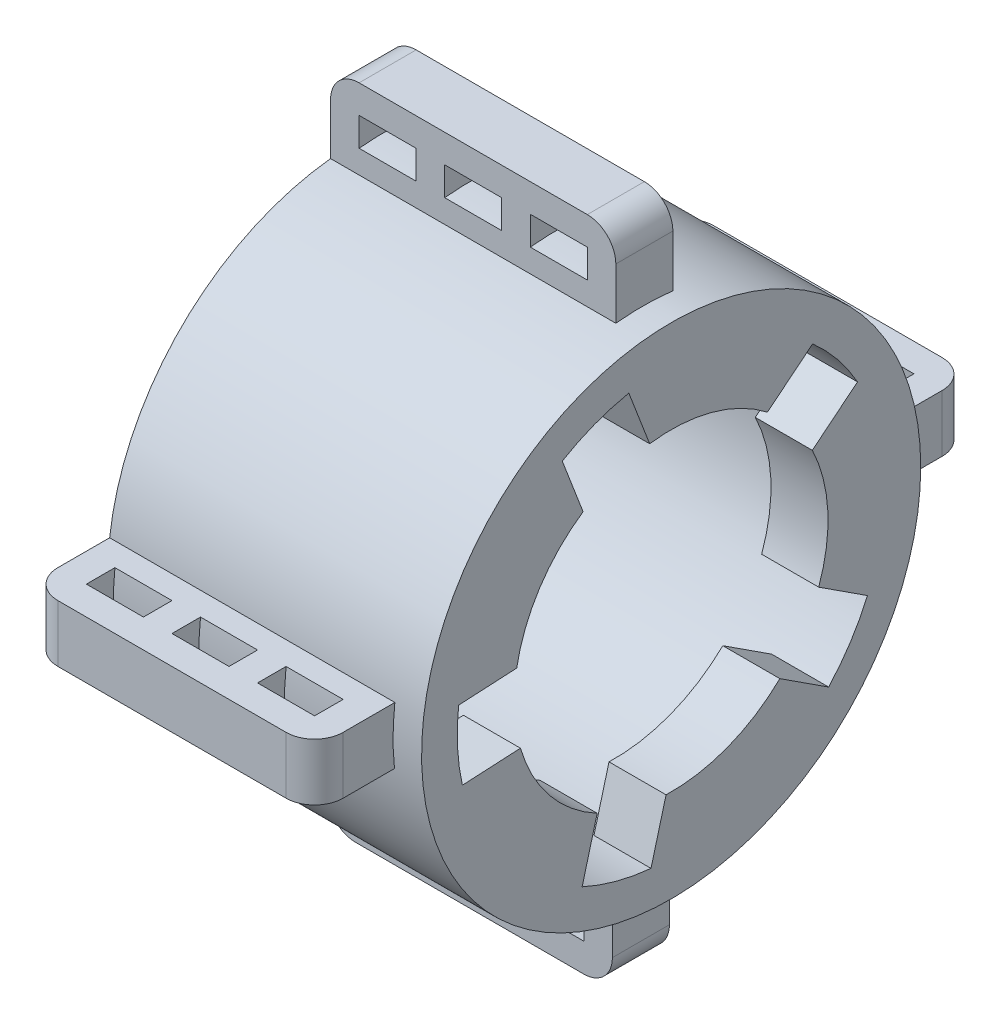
ISO-10303-21;
HEADER;
FILE_DESCRIPTION(('STEP AP214'),'2;1');
FILE_NAME('part.step','',(''),(''),'','','');
FILE_SCHEMA(('AUTOMOTIVE_DESIGN { 1 0 10303 214 1 1 1 1 }'));
ENDSEC;
DATA;
#1=APPLICATION_CONTEXT('core data for automotive mechanical design processes');
#2=APPLICATION_PROTOCOL_DEFINITION('international standard','automotive_design',2000,#1);
#3=PRODUCT_CONTEXT('',#1,'mechanical');
#4=PRODUCT('Part','Part','',(#3));
#5=PRODUCT_RELATED_PRODUCT_CATEGORY('part','',(#4));
#6=PRODUCT_DEFINITION_FORMATION('','',#4);
#7=PRODUCT_DEFINITION_CONTEXT('part definition',#1,'design');
#8=PRODUCT_DEFINITION('design','',#6,#7);
#9=PRODUCT_DEFINITION_SHAPE('','',#8);
#10=(LENGTH_UNIT() NAMED_UNIT(*) SI_UNIT(.MILLI.,.METRE.));
#11=(NAMED_UNIT(*) PLANE_ANGLE_UNIT() SI_UNIT($,.RADIAN.));
#12=(NAMED_UNIT(*) SI_UNIT($,.STERADIAN.) SOLID_ANGLE_UNIT());
#13=UNCERTAINTY_MEASURE_WITH_UNIT(LENGTH_MEASURE(1.E-05),#10,'distance_accuracy_value','');
#14=(GEOMETRIC_REPRESENTATION_CONTEXT(3) GLOBAL_UNCERTAINTY_ASSIGNED_CONTEXT((#13)) GLOBAL_UNIT_ASSIGNED_CONTEXT((#10,
#11,#12)) REPRESENTATION_CONTEXT('',''));
#15=CARTESIAN_POINT('',(0.,0.,0.));
#16=DIRECTION('',(0.,0.,1.));
#17=DIRECTION('',(1.,0.,0.));
#18=AXIS2_PLACEMENT_3D('',#15,#16,#17);
#19=CARTESIAN_POINT('',(18.,0.,0.));
#20=DIRECTION('',(1.,0.,0.));
#21=DIRECTION('',(0.,0.,-1.));
#22=AXIS2_PLACEMENT_3D('',#19,#20,#21);
#23=PLANE('',#22);
#24=CARTESIAN_POINT('',(18.,0.,0.));
#25=DIRECTION('',(1.,0.,0.));
#26=DIRECTION('',(0.,0.,-1.));
#27=AXIS2_PLACEMENT_3D('',#24,#25,#26);
#28=CIRCLE('',#27,11.);
#29=CARTESIAN_POINT('',(18.,-9.70044811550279,5.18664692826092));
#30=VERTEX_POINT('',#29);
#31=CARTESIAN_POINT('',(18.,-3.05793843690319,10.5664096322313));
#32=VERTEX_POINT('',#31);
#33=EDGE_CURVE('E701',#30,#32,#28,.F.);
#34=ORIENTED_EDGE('',*,*,#33,.F.);
#35=DIRECTION('',(0.,-0.965943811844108,0.258751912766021));
#36=VECTOR('',#35,1.);
#37=CARTESIAN_POINT('',(18.,0.646879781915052,2.41485952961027));
#38=LINE('',#37,#36);
#39=CARTESIAN_POINT('',(18.,-13.6396218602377,6.2418519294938));
#40=VERTEX_POINT('',#39);
#41=EDGE_CURVE('E700',#30,#40,#38,.T.);
#42=ORIENTED_EDGE('',*,*,#41,.T.);
#43=CARTESIAN_POINT('',(18.,0.,0.));
#44=DIRECTION('',(1.,0.,0.));
#45=DIRECTION('',(0.,0.,-1.));
#46=AXIS2_PLACEMENT_3D('',#43,#44,#45);
#47=CIRCLE('',#46,15.);
#48=CARTESIAN_POINT('',(18.,-3.27165047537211,14.6388627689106));
#49=VERTEX_POINT('',#48);
#50=EDGE_CURVE('E671',#49,#40,#47,.T.);
#51=ORIENTED_EDGE('',*,*,#50,.F.);
#52=DIRECTION('',(0.,-0.0524053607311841,0.998625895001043));
#53=VECTOR('',#52,1.);
#54=CARTESIAN_POINT('',(18.,-2.49656473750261,-0.13101340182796));
#55=LINE('',#54,#53);
#56=EDGE_CURVE('E699',#32,#49,#55,.T.);
#57=ORIENTED_EDGE('',*,*,#56,.F.);
#58=EDGE_LOOP('',(#34,#42,#51,#57));
#59=FACE_BOUND('',#58,.T.);
#60=ADVANCED_FACE('F35',(#59),#23,.F.);
#61=CARTESIAN_POINT('',(18.,0.,0.));
#62=DIRECTION('',(1.,0.,0.));
#63=DIRECTION('',(0.,0.,-1.));
#64=AXIS2_PLACEMENT_3D('',#61,#62,#63);
#65=CIRCLE('',#64,11.);
#66=CARTESIAN_POINT('',(18.,1.93519103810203,10.8284364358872));
#67=VERTEX_POINT('',#66);
#68=CARTESIAN_POINT('',(18.,9.10429778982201,6.17347242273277));
#69=VERTEX_POINT('',#68);
#70=EDGE_CURVE('E2016',#67,#69,#65,.F.);
#71=ORIENTED_EDGE('',*,*,#70,.F.);
#72=DIRECTION('',(0.,-0.0524053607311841,0.998625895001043));
#73=VECTOR('',#72,1.);
#74=CARTESIAN_POINT('',(18.,2.49656473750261,0.13101340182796));
#75=LINE('',#74,#73);
#76=CARTESIAN_POINT('',(18.,1.72147899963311,14.9008895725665));
#77=VERTEX_POINT('',#76);
#78=EDGE_CURVE('E2018',#67,#77,#75,.T.);
#79=ORIENTED_EDGE('',*,*,#78,.T.);
#80=CARTESIAN_POINT('',(18.,12.9113902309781,7.63518187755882));
#81=VERTEX_POINT('',#80);
#82=EDGE_CURVE('E677',#81,#77,#47,.T.);
#83=ORIENTED_EDGE('',*,*,#82,.F.);
#84=DIRECTION('',(0.,0.933555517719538,0.358432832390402));
#85=VECTOR('',#84,1.);
#86=CARTESIAN_POINT('',(18.,-0.896082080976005,2.33388879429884));
#87=LINE('',#86,#85);
#88=EDGE_CURVE('E2014',#69,#81,#87,.T.);
#89=ORIENTED_EDGE('',*,*,#88,.F.);
#90=EDGE_LOOP('',(#71,#79,#83,#89));
#91=FACE_BOUND('',#90,.T.);
#92=ADVANCED_FACE('F1500',(#91),#23,.F.);
#93=CARTESIAN_POINT('',(18.,0.,0.));
#94=DIRECTION('',(1.,0.,0.));
#95=DIRECTION('',(0.,0.,-1.));
#96=AXIS2_PLACEMENT_3D('',#93,#94,#95);
#97=CIRCLE('',#96,11.);
#98=CARTESIAN_POINT('',(18.,10.896461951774,1.50569483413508));
#99=VERTEX_POINT('',#98);
#100=CARTESIAN_POINT('',(18.,8.68470391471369,-6.7509938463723));
#101=VERTEX_POINT('',#100);
#102=EDGE_CURVE('E2009',#99,#101,#97,.F.);
#103=ORIENTED_EDGE('',*,*,#102,.F.);
#104=DIRECTION('',(0.,0.933555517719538,0.358432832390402));
#105=VECTOR('',#104,1.);
#106=CARTESIAN_POINT('',(18.,0.896082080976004,-2.33388879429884));
#107=LINE('',#106,#105);
#108=CARTESIAN_POINT('',(18.,14.7035543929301,2.96740428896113));
#109=VERTEX_POINT('',#108);
#110=EDGE_CURVE('E2011',#99,#109,#107,.T.);
#111=ORIENTED_EDGE('',*,*,#110,.T.);
#112=CARTESIAN_POINT('',(18.,11.2513284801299,-9.92006085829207));
#113=VERTEX_POINT('',#112);
#114=EDGE_CURVE('E669',#113,#109,#47,.T.);
#115=ORIENTED_EDGE('',*,*,#114,.F.);
#116=DIRECTION('',(0.,0.629374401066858,-0.777102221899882));
#117=VECTOR('',#116,1.);
#118=CARTESIAN_POINT('',(18.,1.9427555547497,1.57343600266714));
#119=LINE('',#118,#117);
#120=EDGE_CURVE('E661',#101,#113,#119,.T.);
#121=ORIENTED_EDGE('',*,*,#120,.F.);
#122=EDGE_LOOP('',(#103,#111,#115,#121));
#123=FACE_BOUND('',#122,.T.);
#124=ADVANCED_FACE('F1504',(#123),#23,.F.);
#125=CARTESIAN_POINT('',(18.,0.,0.));
#126=DIRECTION('',(1.,0.,0.));
#127=DIRECTION('',(0.,0.,-1.));
#128=AXIS2_PLACEMENT_3D('',#125,#126,#127);
#129=CIRCLE('',#128,11.);
#130=CARTESIAN_POINT('',(18.,4.79919280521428,-9.89786585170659));
#131=VERTEX_POINT('',#130);
#132=CARTESIAN_POINT('',(18.,-3.73685558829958,-10.3458160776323));
#133=VERTEX_POINT('',#132);
#134=EDGE_CURVE('E660',#131,#133,#129,.F.);
#135=ORIENTED_EDGE('',*,*,#134,.F.);
#136=DIRECTION('',(0.,0.629374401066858,-0.777102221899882));
#137=VECTOR('',#136,1.);
#138=CARTESIAN_POINT('',(18.,-1.94275555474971,-1.57343600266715));
#139=LINE('',#138,#137);
#140=CARTESIAN_POINT('',(18.,7.36581737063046,-13.0669328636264));
#141=VERTEX_POINT('',#140);
#142=EDGE_CURVE('E644',#131,#141,#139,.T.);
#143=ORIENTED_EDGE('',*,*,#142,.T.);
#144=CARTESIAN_POINT('',(18.,-5.95768681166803,-13.7661166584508));
#145=VERTEX_POINT('',#144);
#146=EDGE_CURVE('E39',#145,#141,#47,.T.);
#147=ORIENTED_EDGE('',*,*,#146,.F.);
#148=DIRECTION('',(0.,-0.544580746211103,-0.838708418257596));
#149=VECTOR('',#148,1.);
#150=CARTESIAN_POINT('',(18.,2.09677104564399,-1.36145186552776));
#151=LINE('',#150,#149);
#152=EDGE_CURVE('E2003',#133,#145,#151,.T.);
#153=ORIENTED_EDGE('',*,*,#152,.F.);
#154=EDGE_LOOP('',(#135,#143,#147,#153));
#155=FACE_BOUND('',#154,.T.);
#156=ADVANCED_FACE('F658',(#155),#23,.F.);
#157=CARTESIAN_POINT('',(20.,0.,0.));
#158=DIRECTION('',(1.,0.,0.));
#159=DIRECTION('',(0.,0.,-1.));
#160=AXIS2_PLACEMENT_3D('',#157,#158,#159);
#161=PLANE('',#160);
#162=CARTESIAN_POINT('',(20.,0.,0.));
#163=DIRECTION('',(1.,0.,0.));
#164=DIRECTION('',(0.,0.,-1.));
#165=AXIS2_PLACEMENT_3D('',#162,#163,#164);
#166=CIRCLE('',#165,17.5);
#167=CARTESIAN_POINT('',(20.,17.370965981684,-2.12121212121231));
#168=VERTEX_POINT('',#167);
#169=CARTESIAN_POINT('',(20.,17.3988550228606,1.8787878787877));
#170=VERTEX_POINT('',#169);
#171=EDGE_CURVE('E676',#168,#170,#166,.T.);
#172=ORIENTED_EDGE('',*,*,#171,.F.);
#173=DIRECTION('',(0.,1.,0.));
#174=VECTOR('',#173,1.);
#175=CARTESIAN_POINT('',(20.,23.,-2.1212121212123));
#176=LINE('',#175,#174);
#177=CARTESIAN_POINT('',(20.,21.,-2.1212121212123));
#178=VERTEX_POINT('',#177);
#179=EDGE_CURVE('E1158',#168,#178,#176,.T.);
#180=ORIENTED_EDGE('',*,*,#179,.T.);
#181=DIRECTION('',(0.,0.,1.));
#182=VECTOR('',#181,1.);
#183=CARTESIAN_POINT('',(20.,21.,1.8787878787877));
#184=LINE('',#183,#182);
#185=CARTESIAN_POINT('',(20.,21.,1.8787878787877));
#186=VERTEX_POINT('',#185);
#187=EDGE_CURVE('E11',#178,#186,#184,.T.);
#188=ORIENTED_EDGE('',*,*,#187,.T.);
#189=DIRECTION('',(0.,-1.,0.));
#190=VECTOR('',#189,1.);
#191=CARTESIAN_POINT('',(20.,23.,1.8787878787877));
#192=LINE('',#191,#190);
#193=EDGE_CURVE('E1139',#186,#170,#192,.T.);
#194=ORIENTED_EDGE('',*,*,#193,.T.);
#195=EDGE_LOOP('',(#172,#180,#188,#194));
#196=FACE_BOUND('',#195,.T.);
#197=ADVANCED_FACE('F1473',(#196),#161,.T.);
#198=CARTESIAN_POINT('',(20.,2.1212121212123,17.370965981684));
#199=VERTEX_POINT('',#198);
#200=CARTESIAN_POINT('',(20.,-1.87878787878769,17.3988550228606));
#201=VERTEX_POINT('',#200);
#202=EDGE_CURVE('E683',#199,#201,#166,.T.);
#203=ORIENTED_EDGE('',*,*,#202,.F.);
#204=DIRECTION('',(0.,0.,1.));
#205=VECTOR('',#204,1.);
#206=CARTESIAN_POINT('',(20.,2.1212121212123,23.));
#207=LINE('',#206,#205);
#208=CARTESIAN_POINT('',(20.,2.1212121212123,21.));
#209=VERTEX_POINT('',#208);
#210=EDGE_CURVE('E1141',#199,#209,#207,.T.);
#211=ORIENTED_EDGE('',*,*,#210,.T.);
#212=DIRECTION('',(0.,-1.,0.));
#213=VECTOR('',#212,1.);
#214=CARTESIAN_POINT('',(20.,-1.8787878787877,21.));
#215=LINE('',#214,#213);
#216=CARTESIAN_POINT('',(20.,-1.8787878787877,21.));
#217=VERTEX_POINT('',#216);
#218=EDGE_CURVE('E1367',#209,#217,#215,.T.);
#219=ORIENTED_EDGE('',*,*,#218,.T.);
#220=DIRECTION('',(0.,0.,-1.));
#221=VECTOR('',#220,1.);
#222=CARTESIAN_POINT('',(20.,-1.8787878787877,23.));
#223=LINE('',#222,#221);
#224=EDGE_CURVE('E1145',#217,#201,#223,.T.);
#225=ORIENTED_EDGE('',*,*,#224,.T.);
#226=EDGE_LOOP('',(#203,#211,#219,#225));
#227=FACE_BOUND('',#226,.T.);
#228=ADVANCED_FACE('F1401',(#227),#161,.T.);
#229=CARTESIAN_POINT('',(20.,-17.370965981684,2.1212121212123));
#230=VERTEX_POINT('',#229);
#231=CARTESIAN_POINT('',(20.,-17.3988550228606,-1.87878787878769));
#232=VERTEX_POINT('',#231);
#233=EDGE_CURVE('E1393',#230,#232,#166,.T.);
#234=ORIENTED_EDGE('',*,*,#233,.F.);
#235=DIRECTION('',(0.,-1.,0.));
#236=VECTOR('',#235,1.);
#237=CARTESIAN_POINT('',(20.,-23.,2.1212121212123));
#238=LINE('',#237,#236);
#239=CARTESIAN_POINT('',(20.,-21.,2.1212121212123));
#240=VERTEX_POINT('',#239);
#241=EDGE_CURVE('E1147',#230,#240,#238,.T.);
#242=ORIENTED_EDGE('',*,*,#241,.T.);
#243=DIRECTION('',(0.,0.,-1.));
#244=VECTOR('',#243,1.);
#245=CARTESIAN_POINT('',(20.,-21.,-1.8787878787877));
#246=LINE('',#245,#244);
#247=CARTESIAN_POINT('',(20.,-21.,-1.8787878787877));
#248=VERTEX_POINT('',#247);
#249=EDGE_CURVE('E1370',#240,#248,#246,.T.);
#250=ORIENTED_EDGE('',*,*,#249,.T.);
#251=DIRECTION('',(0.,1.,0.));
#252=VECTOR('',#251,1.);
#253=CARTESIAN_POINT('',(20.,-23.,-1.8787878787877));
#254=LINE('',#253,#252);
#255=EDGE_CURVE('E1150',#248,#232,#254,.T.);
#256=ORIENTED_EDGE('',*,*,#255,.T.);
#257=EDGE_LOOP('',(#234,#242,#250,#256));
#258=FACE_BOUND('',#257,.T.);
#259=ADVANCED_FACE('F1420',(#258),#161,.T.);
#260=CARTESIAN_POINT('',(20.,0.,0.));
#261=DIRECTION('',(-1.,0.,0.));
#262=DIRECTION('',(0.,0.,1.));
#263=AXIS2_PLACEMENT_3D('',#260,#261,#262);
#264=CYLINDRICAL_SURFACE('',#263,15.);
#265=CARTESIAN_POINT('',(0.,0.,0.));
#266=DIRECTION('',(1.,0.,0.));
#267=DIRECTION('',(0.,0.,-1.));
#268=AXIS2_PLACEMENT_3D('',#265,#266,#267);
#269=CIRCLE('',#268,15.);
#270=CARTESIAN_POINT('',(0.,0.,-15.));
#271=VERTEX_POINT('',#270);
#272=EDGE_CURVE('E1135',#271,#271,#269,.T.);
#273=ORIENTED_EDGE('',*,*,#272,.F.);
#274=EDGE_LOOP('',(#273));
#275=FACE_BOUND('',#274,.T.);
#276=ORIENTED_EDGE('',*,*,#146,.T.);
#277=DIRECTION('',(1.,0.,0.));
#278=VECTOR('',#277,1.);
#279=CARTESIAN_POINT('',(-0.001000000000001,7.36581737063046,-13.0669328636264));
#280=LINE('',#279,#278);
#281=CARTESIAN_POINT('',(22.,7.36581737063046,-13.0669328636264));
#282=VERTEX_POINT('',#281);
#283=EDGE_CURVE('E641',#141,#282,#280,.T.);
#284=ORIENTED_EDGE('',*,*,#283,.T.);
#285=CARTESIAN_POINT('',(22.,0.,0.));
#286=DIRECTION('',(1.,0.,0.));
#287=DIRECTION('',(0.,0.,-1.));
#288=AXIS2_PLACEMENT_3D('',#285,#286,#287);
#289=CIRCLE('',#288,15.);
#290=CARTESIAN_POINT('',(22.,11.2513284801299,-9.92006085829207));
#291=VERTEX_POINT('',#290);
#292=EDGE_CURVE('E721',#282,#291,#289,.T.);
#293=ORIENTED_EDGE('',*,*,#292,.T.);
#294=DIRECTION('',(1.,0.,0.));
#295=VECTOR('',#294,1.);
#296=CARTESIAN_POINT('',(-0.001000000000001,11.2513284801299,-9.92006085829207));
#297=LINE('',#296,#295);
#298=EDGE_CURVE('E652',#113,#291,#297,.T.);
#299=ORIENTED_EDGE('',*,*,#298,.F.);
#300=ORIENTED_EDGE('',*,*,#114,.T.);
#301=DIRECTION('',(1.,0.,0.));
#302=VECTOR('',#301,1.);
#303=CARTESIAN_POINT('',(-0.001000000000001,14.7035543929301,2.96740428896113));
#304=LINE('',#303,#302);
#305=CARTESIAN_POINT('',(22.,14.7035543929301,2.96740428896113));
#306=VERTEX_POINT('',#305);
#307=EDGE_CURVE('E777',#109,#306,#304,.T.);
#308=ORIENTED_EDGE('',*,*,#307,.T.);
#309=CARTESIAN_POINT('',(22.,0.,0.));
#310=DIRECTION('',(1.,0.,0.));
#311=DIRECTION('',(0.,0.,-1.));
#312=AXIS2_PLACEMENT_3D('',#309,#310,#311);
#313=CIRCLE('',#312,15.);
#314=CARTESIAN_POINT('',(22.,12.9113902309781,7.63518187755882));
#315=VERTEX_POINT('',#314);
#316=EDGE_CURVE('E732',#306,#315,#313,.T.);
#317=ORIENTED_EDGE('',*,*,#316,.T.);
#318=DIRECTION('',(1.,0.,0.));
#319=VECTOR('',#318,1.);
#320=CARTESIAN_POINT('',(-0.001000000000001,12.9113902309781,7.63518187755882));
#321=LINE('',#320,#319);
#322=EDGE_CURVE('E775',#81,#315,#321,.T.);
#323=ORIENTED_EDGE('',*,*,#322,.F.);
#324=ORIENTED_EDGE('',*,*,#82,.T.);
#325=DIRECTION('',(1.,0.,0.));
#326=VECTOR('',#325,1.);
#327=CARTESIAN_POINT('',(-0.001000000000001,1.72147899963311,14.9008895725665));
#328=LINE('',#327,#326);
#329=CARTESIAN_POINT('',(22.,1.72147899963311,14.9008895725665));
#330=VERTEX_POINT('',#329);
#331=EDGE_CURVE('E769',#77,#330,#328,.T.);
#332=ORIENTED_EDGE('',*,*,#331,.T.);
#333=CARTESIAN_POINT('',(22.,0.,0.));
#334=DIRECTION('',(1.,0.,0.));
#335=DIRECTION('',(0.,0.,-1.));
#336=AXIS2_PLACEMENT_3D('',#333,#334,#335);
#337=CIRCLE('',#336,15.);
#338=CARTESIAN_POINT('',(22.,-3.27165047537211,14.6388627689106));
#339=VERTEX_POINT('',#338);
#340=EDGE_CURVE('E744',#330,#339,#337,.T.);
#341=ORIENTED_EDGE('',*,*,#340,.T.);
#342=DIRECTION('',(1.,0.,0.));
#343=VECTOR('',#342,1.);
#344=CARTESIAN_POINT('',(-0.001000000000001,-3.27165047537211,14.6388627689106));
#345=LINE('',#344,#343);
#346=EDGE_CURVE('E694',#49,#339,#345,.T.);
#347=ORIENTED_EDGE('',*,*,#346,.F.);
#348=ORIENTED_EDGE('',*,*,#50,.T.);
#349=DIRECTION('',(1.,0.,0.));
#350=VECTOR('',#349,1.);
#351=CARTESIAN_POINT('',(-0.001000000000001,-13.6396218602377,6.2418519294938));
#352=LINE('',#351,#350);
#353=CARTESIAN_POINT('',(22.,-13.6396218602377,6.2418519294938));
#354=VERTEX_POINT('',#353);
#355=EDGE_CURVE('E691',#40,#354,#352,.T.);
#356=ORIENTED_EDGE('',*,*,#355,.T.);
#357=CARTESIAN_POINT('',(22.,0.,0.));
#358=DIRECTION('',(1.,0.,0.));
#359=DIRECTION('',(0.,0.,-1.));
#360=AXIS2_PLACEMENT_3D('',#357,#358,#359);
#361=CIRCLE('',#360,15.);
#362=CARTESIAN_POINT('',(22.,-14.9333814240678,1.41213287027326));
#363=VERTEX_POINT('',#362);
#364=EDGE_CURVE('E755',#354,#363,#361,.T.);
#365=ORIENTED_EDGE('',*,*,#364,.T.);
#366=DIRECTION('',(1.,0.,0.));
#367=VECTOR('',#366,1.);
#368=CARTESIAN_POINT('',(-0.001000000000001,-14.9333814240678,1.41213287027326));
#369=LINE('',#368,#367);
#370=CARTESIAN_POINT('',(18.,-14.9333814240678,1.41213287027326));
#371=VERTEX_POINT('',#370);
#372=EDGE_CURVE('E761',#371,#363,#369,.T.);
#373=ORIENTED_EDGE('',*,*,#372,.F.);
#374=CARTESIAN_POINT('',(18.,-10.151228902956,-11.0432129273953));
#375=VERTEX_POINT('',#374);
#376=EDGE_CURVE('E667',#371,#375,#47,.T.);
#377=ORIENTED_EDGE('',*,*,#376,.T.);
#378=DIRECTION('',(1.,0.,0.));
#379=VECTOR('',#378,1.);
#380=CARTESIAN_POINT('',(-0.001000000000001,-10.151228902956,-11.0432129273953));
#381=LINE('',#380,#379);
#382=CARTESIAN_POINT('',(22.,-10.151228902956,-11.0432129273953));
#383=VERTEX_POINT('',#382);
#384=EDGE_CURVE('E788',#375,#383,#381,.T.);
#385=ORIENTED_EDGE('',*,*,#384,.T.);
#386=CARTESIAN_POINT('',(22.,0.,0.));
#387=DIRECTION('',(1.,0.,0.));
#388=DIRECTION('',(0.,0.,-1.));
#389=AXIS2_PLACEMENT_3D('',#386,#387,#388);
#390=CIRCLE('',#389,15.);
#391=CARTESIAN_POINT('',(22.,-5.95768681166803,-13.7661166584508));
#392=VERTEX_POINT('',#391);
#393=EDGE_CURVE('E712',#383,#392,#390,.T.);
#394=ORIENTED_EDGE('',*,*,#393,.T.);
#395=DIRECTION('',(1.,0.,0.));
#396=VECTOR('',#395,1.);
#397=CARTESIAN_POINT('',(-0.001000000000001,-5.95768681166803,-13.7661166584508));
#398=LINE('',#397,#396);
#399=EDGE_CURVE('E666',#145,#392,#398,.T.);
#400=ORIENTED_EDGE('',*,*,#399,.F.);
#401=EDGE_LOOP('',(#276,#284,#293,#299,#300,#308,#317,#323,#324,#332,#341,#347,#348,#356,#365,
#373,#377,#385,#394,#400));
#402=FACE_BOUND('',#401,.T.);
#403=ADVANCED_FACE('F664',(#275,#402),#264,.F.);
#404=CARTESIAN_POINT('',(20.,-2.12121212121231,-17.370965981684));
#405=VERTEX_POINT('',#404);
#406=CARTESIAN_POINT('',(20.,1.8787878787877,-17.3988550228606));
#407=VERTEX_POINT('',#406);
#408=EDGE_CURVE('E681',#405,#407,#166,.T.);
#409=ORIENTED_EDGE('',*,*,#408,.F.);
#410=DIRECTION('',(0.,0.,-1.));
#411=VECTOR('',#410,1.);
#412=CARTESIAN_POINT('',(20.,-2.1212121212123,-23.));
#413=LINE('',#412,#411);
#414=CARTESIAN_POINT('',(20.,-2.1212121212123,-21.));
#415=VERTEX_POINT('',#414);
#416=EDGE_CURVE('E1152',#405,#415,#413,.T.);
#417=ORIENTED_EDGE('',*,*,#416,.T.);
#418=DIRECTION('',(0.,1.,0.));
#419=VECTOR('',#418,1.);
#420=CARTESIAN_POINT('',(20.,1.8787878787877,-21.));
#421=LINE('',#420,#419);
#422=CARTESIAN_POINT('',(20.,1.8787878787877,-21.));
#423=VERTEX_POINT('',#422);
#424=EDGE_CURVE('E44',#415,#423,#421,.T.);
#425=ORIENTED_EDGE('',*,*,#424,.T.);
#426=DIRECTION('',(0.,0.,1.));
#427=VECTOR('',#426,1.);
#428=CARTESIAN_POINT('',(20.,1.8787878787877,-23.));
#429=LINE('',#428,#427);
#430=EDGE_CURVE('E1155',#423,#407,#429,.T.);
#431=ORIENTED_EDGE('',*,*,#430,.T.);
#432=EDGE_LOOP('',(#409,#417,#425,#431));
#433=FACE_BOUND('',#432,.T.);
#434=ADVANCED_FACE('F1377',(#433),#161,.T.);
#435=CARTESIAN_POINT('',(0.,0.,0.));
#436=DIRECTION('',(1.,0.,0.));
#437=DIRECTION('',(0.,0.,-1.));
#438=AXIS2_PLACEMENT_3D('',#435,#436,#437);
#439=PLANE('',#438);
#440=DIRECTION('',(0.,0.,-1.));
#441=VECTOR('',#440,1.);
#442=CARTESIAN_POINT('',(0.,-1.8787878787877,23.));
#443=LINE('',#442,#441);
#444=CARTESIAN_POINT('',(0.,-1.8787878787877,21.));
#445=VERTEX_POINT('',#444);
#446=CARTESIAN_POINT('',(0.,-1.87878787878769,17.3988550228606));
#447=VERTEX_POINT('',#446);
#448=EDGE_CURVE('E1170',#445,#447,#443,.T.);
#449=ORIENTED_EDGE('',*,*,#448,.F.);
#450=DIRECTION('',(0.,-1.,0.));
#451=VECTOR('',#450,1.);
#452=CARTESIAN_POINT('',(0.,0.,21.));
#453=LINE('',#452,#451);
#454=CARTESIAN_POINT('',(0.,2.1212121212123,21.));
#455=VERTEX_POINT('',#454);
#456=EDGE_CURVE('E1322',#445,#455,#453,.F.);
#457=ORIENTED_EDGE('',*,*,#456,.T.);
#458=DIRECTION('',(0.,0.,1.));
#459=VECTOR('',#458,1.);
#460=CARTESIAN_POINT('',(0.,2.1212121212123,23.));
#461=LINE('',#460,#459);
#462=CARTESIAN_POINT('',(0.,2.1212121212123,17.370965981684));
#463=VERTEX_POINT('',#462);
#464=EDGE_CURVE('E1167',#463,#455,#461,.T.);
#465=ORIENTED_EDGE('',*,*,#464,.F.);
#466=CARTESIAN_POINT('',(0.,0.,0.));
#467=DIRECTION('',(1.,0.,0.));
#468=DIRECTION('',(0.,0.,-1.));
#469=AXIS2_PLACEMENT_3D('',#466,#467,#468);
#470=CIRCLE('',#469,17.5);
#471=CARTESIAN_POINT('',(0.,17.3988550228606,1.8787878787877));
#472=VERTEX_POINT('',#471);
#473=EDGE_CURVE('E1164',#472,#463,#470,.T.);
#474=ORIENTED_EDGE('',*,*,#473,.F.);
#475=DIRECTION('',(0.,-1.,0.));
#476=VECTOR('',#475,1.);
#477=CARTESIAN_POINT('',(0.,23.,1.8787878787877));
#478=LINE('',#477,#476);
#479=CARTESIAN_POINT('',(0.,21.,1.8787878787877));
#480=VERTEX_POINT('',#479);
#481=EDGE_CURVE('E1138',#480,#472,#478,.T.);
#482=ORIENTED_EDGE('',*,*,#481,.F.);
#483=DIRECTION('',(0.,0.,1.));
#484=VECTOR('',#483,1.);
#485=CARTESIAN_POINT('',(0.,21.,0.));
#486=LINE('',#485,#484);
#487=CARTESIAN_POINT('',(0.,21.,-2.1212121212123));
#488=VERTEX_POINT('',#487);
#489=EDGE_CURVE('E1320',#480,#488,#486,.F.);
#490=ORIENTED_EDGE('',*,*,#489,.T.);
#491=DIRECTION('',(0.,1.,0.));
#492=VECTOR('',#491,1.);
#493=CARTESIAN_POINT('',(0.,23.,-2.1212121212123));
#494=LINE('',#493,#492);
#495=CARTESIAN_POINT('',(0.,17.370965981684,-2.12121212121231));
#496=VERTEX_POINT('',#495);
#497=EDGE_CURVE('E1142',#496,#488,#494,.T.);
#498=ORIENTED_EDGE('',*,*,#497,.F.);
#499=CARTESIAN_POINT('',(0.,0.,0.));
#500=DIRECTION('',(1.,0.,0.));
#501=DIRECTION('',(0.,0.,-1.));
#502=AXIS2_PLACEMENT_3D('',#499,#500,#501);
#503=CIRCLE('',#502,17.5);
#504=CARTESIAN_POINT('',(0.,1.8787878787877,-17.3988550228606));
#505=VERTEX_POINT('',#504);
#506=EDGE_CURVE('E1191',#505,#496,#503,.T.);
#507=ORIENTED_EDGE('',*,*,#506,.F.);
#508=DIRECTION('',(0.,0.,1.));
#509=VECTOR('',#508,1.);
#510=CARTESIAN_POINT('',(0.,1.8787878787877,-23.));
#511=LINE('',#510,#509);
#512=CARTESIAN_POINT('',(0.,1.8787878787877,-21.));
#513=VERTEX_POINT('',#512);
#514=EDGE_CURVE('E1188',#513,#505,#511,.T.);
#515=ORIENTED_EDGE('',*,*,#514,.F.);
#516=DIRECTION('',(0.,1.,0.));
#517=VECTOR('',#516,1.);
#518=CARTESIAN_POINT('',(0.,0.,-21.));
#519=LINE('',#518,#517);
#520=CARTESIAN_POINT('',(0.,-2.1212121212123,-21.));
#521=VERTEX_POINT('',#520);
#522=EDGE_CURVE('E1318',#513,#521,#519,.F.);
#523=ORIENTED_EDGE('',*,*,#522,.T.);
#524=DIRECTION('',(0.,0.,-1.));
#525=VECTOR('',#524,1.);
#526=CARTESIAN_POINT('',(0.,-2.1212121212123,-23.));
#527=LINE('',#526,#525);
#528=CARTESIAN_POINT('',(0.,-2.12121212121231,-17.370965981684));
#529=VERTEX_POINT('',#528);
#530=EDGE_CURVE('E1185',#529,#521,#527,.T.);
#531=ORIENTED_EDGE('',*,*,#530,.F.);
#532=CARTESIAN_POINT('',(0.,0.,0.));
#533=DIRECTION('',(1.,0.,0.));
#534=DIRECTION('',(0.,0.,-1.));
#535=AXIS2_PLACEMENT_3D('',#532,#533,#534);
#536=CIRCLE('',#535,17.5);
#537=CARTESIAN_POINT('',(0.,-17.3988550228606,-1.87878787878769));
#538=VERTEX_POINT('',#537);
#539=EDGE_CURVE('E1182',#538,#529,#536,.T.);
#540=ORIENTED_EDGE('',*,*,#539,.F.);
#541=DIRECTION('',(0.,1.,0.));
#542=VECTOR('',#541,1.);
#543=CARTESIAN_POINT('',(0.,-23.,-1.8787878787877));
#544=LINE('',#543,#542);
#545=CARTESIAN_POINT('',(0.,-21.,-1.8787878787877));
#546=VERTEX_POINT('',#545);
#547=EDGE_CURVE('E1179',#546,#538,#544,.T.);
#548=ORIENTED_EDGE('',*,*,#547,.F.);
#549=DIRECTION('',(0.,0.,-1.));
#550=VECTOR('',#549,1.);
#551=CARTESIAN_POINT('',(0.,-21.,0.));
#552=LINE('',#551,#550);
#553=CARTESIAN_POINT('',(0.,-21.,2.1212121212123));
#554=VERTEX_POINT('',#553);
#555=EDGE_CURVE('E1316',#546,#554,#552,.F.);
#556=ORIENTED_EDGE('',*,*,#555,.T.);
#557=DIRECTION('',(0.,-1.,0.));
#558=VECTOR('',#557,1.);
#559=CARTESIAN_POINT('',(0.,-23.,2.1212121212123));
#560=LINE('',#559,#558);
#561=CARTESIAN_POINT('',(0.,-17.370965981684,2.1212121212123));
#562=VERTEX_POINT('',#561);
#563=EDGE_CURVE('E1176',#562,#554,#560,.T.);
#564=ORIENTED_EDGE('',*,*,#563,.F.);
#565=CARTESIAN_POINT('',(0.,0.,0.));
#566=DIRECTION('',(1.,0.,0.));
#567=DIRECTION('',(0.,0.,-1.));
#568=AXIS2_PLACEMENT_3D('',#565,#566,#567);
#569=CIRCLE('',#568,17.5);
#570=EDGE_CURVE('E1173',#447,#562,#569,.T.);
#571=ORIENTED_EDGE('',*,*,#570,.F.);
#572=EDGE_LOOP('',(#449,#457,#465,#474,#482,#490,#498,#507,#515,#523,#531,#540,#548,#556,#564,#571));
#573=FACE_BOUND('',#572,.T.);
#574=ORIENTED_EDGE('',*,*,#272,.T.);
#575=EDGE_LOOP('',(#574));
#576=FACE_BOUND('',#575,.T.);
#577=ADVANCED_FACE('F1411',(#573,#576),#439,.F.);
#578=CARTESIAN_POINT('',(20.,23.,1.8787878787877));
#579=DIRECTION('',(0.,0.,-1.));
#580=DIRECTION('',(0.,1.,0.));
#581=AXIS2_PLACEMENT_3D('',#578,#579,#580);
#582=PLANE('',#581);
#583=DIRECTION('',(0.,-1.,0.));
#584=VECTOR('',#583,1.);
#585=CARTESIAN_POINT('',(6.,23.,1.8787878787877));
#586=LINE('',#585,#584);
#587=CARTESIAN_POINT('',(6.,21.023075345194,1.8787878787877));
#588=VERTEX_POINT('',#587);
#589=CARTESIAN_POINT('',(6.,19.025501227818,1.8787878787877));
#590=VERTEX_POINT('',#589);
#591=EDGE_CURVE('E880',#588,#590,#586,.T.);
#592=ORIENTED_EDGE('',*,*,#591,.T.);
#593=DIRECTION('',(-1.,0.,0.));
#594=VECTOR('',#593,1.);
#595=CARTESIAN_POINT('',(20.,19.025501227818,1.8787878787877));
#596=LINE('',#595,#594);
#597=CARTESIAN_POINT('',(2.,19.025501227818,1.8787878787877));
#598=VERTEX_POINT('',#597);
#599=EDGE_CURVE('E892',#590,#598,#596,.T.);
#600=ORIENTED_EDGE('',*,*,#599,.T.);
#601=DIRECTION('',(0.,1.,0.));
#602=VECTOR('',#601,1.);
#603=CARTESIAN_POINT('',(2.,23.,1.8787878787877));
#604=LINE('',#603,#602);
#605=CARTESIAN_POINT('',(2.,21.023075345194,1.8787878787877));
#606=VERTEX_POINT('',#605);
#607=EDGE_CURVE('E856',#598,#606,#604,.T.);
#608=ORIENTED_EDGE('',*,*,#607,.T.);
#609=DIRECTION('',(-1.,0.,0.));
#610=VECTOR('',#609,1.);
#611=CARTESIAN_POINT('',(20.,21.023075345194,1.8787878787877));
#612=LINE('',#611,#610);
#613=EDGE_CURVE('E868',#606,#588,#612,.F.);
#614=ORIENTED_EDGE('',*,*,#613,.T.);
#615=EDGE_LOOP('',(#592,#600,#608,#614));
#616=FACE_BOUND('',#615,.T.);
#617=DIRECTION('',(0.,-1.,0.));
#618=VECTOR('',#617,1.);
#619=CARTESIAN_POINT('',(12.,23.,1.8787878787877));
#620=LINE('',#619,#618);
#621=CARTESIAN_POINT('',(12.,21.0230753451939,1.8787878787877));
#622=VERTEX_POINT('',#621);
#623=CARTESIAN_POINT('',(12.,19.0255012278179,1.8787878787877));
#624=VERTEX_POINT('',#623);
#625=EDGE_CURVE('E994',#622,#624,#620,.T.);
#626=ORIENTED_EDGE('',*,*,#625,.T.);
#627=DIRECTION('',(-1.,0.,0.));
#628=VECTOR('',#627,1.);
#629=CARTESIAN_POINT('',(20.,19.0255012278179,1.8787878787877));
#630=LINE('',#629,#628);
#631=CARTESIAN_POINT('',(8.,19.0255012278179,1.8787878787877));
#632=VERTEX_POINT('',#631);
#633=EDGE_CURVE('E1006',#624,#632,#630,.T.);
#634=ORIENTED_EDGE('',*,*,#633,.T.);
#635=DIRECTION('',(0.,1.,0.));
#636=VECTOR('',#635,1.);
#637=CARTESIAN_POINT('',(8.,23.,1.8787878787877));
#638=LINE('',#637,#636);
#639=CARTESIAN_POINT('',(8.,21.0230753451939,1.8787878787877));
#640=VERTEX_POINT('',#639);
#641=EDGE_CURVE('E970',#632,#640,#638,.T.);
#642=ORIENTED_EDGE('',*,*,#641,.T.);
#643=DIRECTION('',(-1.,0.,0.));
#644=VECTOR('',#643,1.);
#645=CARTESIAN_POINT('',(20.,21.0230753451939,1.8787878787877));
#646=LINE('',#645,#644);
#647=EDGE_CURVE('E982',#640,#622,#646,.F.);
#648=ORIENTED_EDGE('',*,*,#647,.T.);
#649=EDGE_LOOP('',(#626,#634,#642,#648));
#650=FACE_BOUND('',#649,.T.);
#651=DIRECTION('',(0.,-1.,0.));
#652=VECTOR('',#651,1.);
#653=CARTESIAN_POINT('',(18.,23.,1.8787878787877));
#654=LINE('',#653,#652);
#655=CARTESIAN_POINT('',(18.,21.0230753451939,1.8787878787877));
#656=VERTEX_POINT('',#655);
#657=CARTESIAN_POINT('',(18.,19.0255012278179,1.8787878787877));
#658=VERTEX_POINT('',#657);
#659=EDGE_CURVE('E1108',#656,#658,#654,.T.);
#660=ORIENTED_EDGE('',*,*,#659,.T.);
#661=DIRECTION('',(-1.,0.,0.));
#662=VECTOR('',#661,1.);
#663=CARTESIAN_POINT('',(20.,19.0255012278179,1.8787878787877));
#664=LINE('',#663,#662);
#665=CARTESIAN_POINT('',(14.,19.0255012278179,1.8787878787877));
#666=VERTEX_POINT('',#665);
#667=EDGE_CURVE('E1120',#658,#666,#664,.T.);
#668=ORIENTED_EDGE('',*,*,#667,.T.);
#669=DIRECTION('',(0.,1.,0.));
#670=VECTOR('',#669,1.);
#671=CARTESIAN_POINT('',(14.,23.,1.8787878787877));
#672=LINE('',#671,#670);
#673=CARTESIAN_POINT('',(14.,21.0230753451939,1.8787878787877));
#674=VERTEX_POINT('',#673);
#675=EDGE_CURVE('E1084',#666,#674,#672,.T.);
#676=ORIENTED_EDGE('',*,*,#675,.T.);
#677=DIRECTION('',(-1.,0.,0.));
#678=VECTOR('',#677,1.);
#679=CARTESIAN_POINT('',(20.,21.0230753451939,1.8787878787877));
#680=LINE('',#679,#678);
#681=EDGE_CURVE('E1096',#674,#656,#680,.F.);
#682=ORIENTED_EDGE('',*,*,#681,.T.);
#683=EDGE_LOOP('',(#660,#668,#676,#682));
#684=FACE_BOUND('',#683,.T.);
#685=DIRECTION('',(-1.,0.,0.));
#686=VECTOR('',#685,1.);
#687=CARTESIAN_POINT('',(20.,23.,1.8787878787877));
#688=LINE('',#687,#686);
#689=CARTESIAN_POINT('',(18.,23.,1.8787878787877));
#690=VERTEX_POINT('',#689);
#691=CARTESIAN_POINT('',(2.,23.,1.8787878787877));
#692=VERTEX_POINT('',#691);
#693=EDGE_CURVE('E1161',#690,#692,#688,.T.);
#694=ORIENTED_EDGE('',*,*,#693,.T.);
#695=CARTESIAN_POINT('',(2.,21.,1.8787878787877));
#696=DIRECTION('',(0.,0.,-1.));
#697=DIRECTION('',(0.,1.,0.));
#698=AXIS2_PLACEMENT_3D('',#695,#696,#697);
#699=CIRCLE('',#698,2.);
#700=EDGE_CURVE('E1335',#692,#480,#699,.F.);
#701=ORIENTED_EDGE('',*,*,#700,.T.);
#702=ORIENTED_EDGE('',*,*,#481,.T.);
#703=DIRECTION('',(-1.,0.,0.));
#704=VECTOR('',#703,1.);
#705=CARTESIAN_POINT('',(20.,17.3988550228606,1.8787878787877));
#706=LINE('',#705,#704);
#707=EDGE_CURVE('E1233',#170,#472,#706,.T.);
#708=ORIENTED_EDGE('',*,*,#707,.F.);
#709=ORIENTED_EDGE('',*,*,#193,.F.);
#710=CARTESIAN_POINT('',(18.,21.,1.8787878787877));
#711=DIRECTION('',(0.,0.,-1.));
#712=DIRECTION('',(0.,1.,0.));
#713=AXIS2_PLACEMENT_3D('',#710,#711,#712);
#714=CIRCLE('',#713,2.);
#715=EDGE_CURVE('E1333',#186,#690,#714,.F.);
#716=ORIENTED_EDGE('',*,*,#715,.T.);
#717=EDGE_LOOP('',(#694,#701,#702,#708,#709,#716));
#718=FACE_BOUND('',#717,.T.);
#719=ADVANCED_FACE('F1465',(#616,#650,#684,#718),#582,.F.);
#720=CARTESIAN_POINT('',(20.,2.1212121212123,23.));
#721=DIRECTION('',(0.,-1.,0.));
#722=DIRECTION('',(0.,0.,-1.));
#723=AXIS2_PLACEMENT_3D('',#720,#721,#722);
#724=PLANE('',#723);
#725=DIRECTION('',(0.,0.,-1.));
#726=VECTOR('',#725,1.);
#727=CARTESIAN_POINT('',(2.,2.1212121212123,23.));
#728=LINE('',#727,#726);
#729=CARTESIAN_POINT('',(2.,2.1212121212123,21.0000000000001));
#730=VERTEX_POINT('',#729);
#731=CARTESIAN_POINT('',(2.,2.1212121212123,19.0000000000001));
#732=VERTEX_POINT('',#731);
#733=EDGE_CURVE('E853',#730,#732,#728,.T.);
#734=ORIENTED_EDGE('',*,*,#733,.T.);
#735=DIRECTION('',(-1.,0.,0.));
#736=VECTOR('',#735,1.);
#737=CARTESIAN_POINT('',(20.,2.1212121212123,19.0000000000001));
#738=LINE('',#737,#736);
#739=CARTESIAN_POINT('',(6.,2.1212121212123,19.0000000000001));
#740=VERTEX_POINT('',#739);
#741=EDGE_CURVE('E889',#732,#740,#738,.F.);
#742=ORIENTED_EDGE('',*,*,#741,.T.);
#743=DIRECTION('',(0.,0.,1.));
#744=VECTOR('',#743,1.);
#745=CARTESIAN_POINT('',(6.,2.1212121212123,23.));
#746=LINE('',#745,#744);
#747=CARTESIAN_POINT('',(6.,2.1212121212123,21.0000000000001));
#748=VERTEX_POINT('',#747);
#749=EDGE_CURVE('E877',#740,#748,#746,.T.);
#750=ORIENTED_EDGE('',*,*,#749,.T.);
#751=DIRECTION('',(-1.,0.,0.));
#752=VECTOR('',#751,1.);
#753=CARTESIAN_POINT('',(20.,2.1212121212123,21.0000000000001));
#754=LINE('',#753,#752);
#755=EDGE_CURVE('E865',#748,#730,#754,.T.);
#756=ORIENTED_EDGE('',*,*,#755,.T.);
#757=EDGE_LOOP('',(#734,#742,#750,#756));
#758=FACE_BOUND('',#757,.T.);
#759=DIRECTION('',(0.,0.,-1.));
#760=VECTOR('',#759,1.);
#761=CARTESIAN_POINT('',(8.,2.1212121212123,23.));
#762=LINE('',#761,#760);
#763=CARTESIAN_POINT('',(8.,2.1212121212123,21.0000000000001));
#764=VERTEX_POINT('',#763);
#765=CARTESIAN_POINT('',(8.,2.1212121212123,19.0000000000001));
#766=VERTEX_POINT('',#765);
#767=EDGE_CURVE('E967',#764,#766,#762,.T.);
#768=ORIENTED_EDGE('',*,*,#767,.T.);
#769=DIRECTION('',(-1.,0.,0.));
#770=VECTOR('',#769,1.);
#771=CARTESIAN_POINT('',(20.,2.1212121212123,19.0000000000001));
#772=LINE('',#771,#770);
#773=CARTESIAN_POINT('',(12.,2.1212121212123,19.0000000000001));
#774=VERTEX_POINT('',#773);
#775=EDGE_CURVE('E1003',#766,#774,#772,.F.);
#776=ORIENTED_EDGE('',*,*,#775,.T.);
#777=DIRECTION('',(0.,0.,1.));
#778=VECTOR('',#777,1.);
#779=CARTESIAN_POINT('',(12.,2.1212121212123,23.));
#780=LINE('',#779,#778);
#781=CARTESIAN_POINT('',(12.,2.1212121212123,21.0000000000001));
#782=VERTEX_POINT('',#781);
#783=EDGE_CURVE('E991',#774,#782,#780,.T.);
#784=ORIENTED_EDGE('',*,*,#783,.T.);
#785=DIRECTION('',(-1.,0.,0.));
#786=VECTOR('',#785,1.);
#787=CARTESIAN_POINT('',(20.,2.1212121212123,21.0000000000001));
#788=LINE('',#787,#786);
#789=EDGE_CURVE('E979',#782,#764,#788,.T.);
#790=ORIENTED_EDGE('',*,*,#789,.T.);
#791=EDGE_LOOP('',(#768,#776,#784,#790));
#792=FACE_BOUND('',#791,.T.);
#793=DIRECTION('',(0.,0.,-1.));
#794=VECTOR('',#793,1.);
#795=CARTESIAN_POINT('',(14.,2.1212121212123,23.));
#796=LINE('',#795,#794);
#797=CARTESIAN_POINT('',(14.,2.1212121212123,21.));
#798=VERTEX_POINT('',#797);
#799=CARTESIAN_POINT('',(14.,2.1212121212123,19.));
#800=VERTEX_POINT('',#799);
#801=EDGE_CURVE('E1081',#798,#800,#796,.T.);
#802=ORIENTED_EDGE('',*,*,#801,.T.);
#803=DIRECTION('',(-1.,0.,0.));
#804=VECTOR('',#803,1.);
#805=CARTESIAN_POINT('',(20.,2.1212121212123,19.));
#806=LINE('',#805,#804);
#807=CARTESIAN_POINT('',(18.,2.1212121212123,19.));
#808=VERTEX_POINT('',#807);
#809=EDGE_CURVE('E1117',#800,#808,#806,.F.);
#810=ORIENTED_EDGE('',*,*,#809,.T.);
#811=DIRECTION('',(0.,0.,1.));
#812=VECTOR('',#811,1.);
#813=CARTESIAN_POINT('',(18.,2.1212121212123,23.));
#814=LINE('',#813,#812);
#815=CARTESIAN_POINT('',(18.,2.1212121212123,21.));
#816=VERTEX_POINT('',#815);
#817=EDGE_CURVE('E1105',#808,#816,#814,.T.);
#818=ORIENTED_EDGE('',*,*,#817,.T.);
#819=DIRECTION('',(-1.,0.,0.));
#820=VECTOR('',#819,1.);
#821=CARTESIAN_POINT('',(20.,2.1212121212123,21.));
#822=LINE('',#821,#820);
#823=EDGE_CURVE('E1093',#816,#798,#822,.T.);
#824=ORIENTED_EDGE('',*,*,#823,.T.);
#825=EDGE_LOOP('',(#802,#810,#818,#824));
#826=FACE_BOUND('',#825,.T.);
#827=ORIENTED_EDGE('',*,*,#464,.T.);
#828=CARTESIAN_POINT('',(2.,2.1212121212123,21.));
#829=DIRECTION('',(0.,-1.,0.));
#830=DIRECTION('',(0.,0.,-1.));
#831=AXIS2_PLACEMENT_3D('',#828,#829,#830);
#832=CIRCLE('',#831,2.);
#833=CARTESIAN_POINT('',(2.,2.1212121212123,23.));
#834=VERTEX_POINT('',#833);
#835=EDGE_CURVE('E1326',#455,#834,#832,.F.);
#836=ORIENTED_EDGE('',*,*,#835,.T.);
#837=DIRECTION('',(-1.,0.,0.));
#838=VECTOR('',#837,1.);
#839=CARTESIAN_POINT('',(20.,2.1212121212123,23.));
#840=LINE('',#839,#838);
#841=CARTESIAN_POINT('',(18.,2.1212121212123,23.));
#842=VERTEX_POINT('',#841);
#843=EDGE_CURVE('E1228',#842,#834,#840,.T.);
#844=ORIENTED_EDGE('',*,*,#843,.F.);
#845=CARTESIAN_POINT('',(18.,2.1212121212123,21.));
#846=DIRECTION('',(0.,-1.,0.));
#847=DIRECTION('',(0.,0.,-1.));
#848=AXIS2_PLACEMENT_3D('',#845,#846,#847);
#849=CIRCLE('',#848,2.);
#850=EDGE_CURVE('E1324',#842,#209,#849,.F.);
#851=ORIENTED_EDGE('',*,*,#850,.T.);
#852=ORIENTED_EDGE('',*,*,#210,.F.);
#853=DIRECTION('',(-1.,0.,0.));
#854=VECTOR('',#853,1.);
#855=CARTESIAN_POINT('',(20.,2.1212121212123,17.370965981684));
#856=LINE('',#855,#854);
#857=EDGE_CURVE('E1231',#199,#463,#856,.T.);
#858=ORIENTED_EDGE('',*,*,#857,.T.);
#859=EDGE_LOOP('',(#827,#836,#844,#851,#852,#858));
#860=FACE_BOUND('',#859,.T.);
#861=ADVANCED_FACE('F1478',(#758,#792,#826,#860),#724,.F.);
#862=CARTESIAN_POINT('',(20.,-1.8787878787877,23.));
#863=DIRECTION('',(0.,0.,-1.));
#864=DIRECTION('',(-1.,0.,0.));
#865=AXIS2_PLACEMENT_3D('',#862,#863,#864);
#866=PLANE('',#865);
#867=ORIENTED_EDGE('',*,*,#843,.T.);
#868=DIRECTION('',(0.,-1.,0.));
#869=VECTOR('',#868,1.);
#870=CARTESIAN_POINT('',(2.,-1.8787878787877,23.));
#871=LINE('',#870,#869);
#872=CARTESIAN_POINT('',(2.,-1.8787878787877,23.));
#873=VERTEX_POINT('',#872);
#874=EDGE_CURVE('E1309',#834,#873,#871,.T.);
#875=ORIENTED_EDGE('',*,*,#874,.T.);
#876=DIRECTION('',(-1.,0.,0.));
#877=VECTOR('',#876,1.);
#878=CARTESIAN_POINT('',(20.,-1.8787878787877,23.));
#879=LINE('',#878,#877);
#880=CARTESIAN_POINT('',(18.,-1.8787878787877,23.));
#881=VERTEX_POINT('',#880);
#882=EDGE_CURVE('E1225',#881,#873,#879,.T.);
#883=ORIENTED_EDGE('',*,*,#882,.F.);
#884=DIRECTION('',(0.,-1.,0.));
#885=VECTOR('',#884,1.);
#886=CARTESIAN_POINT('',(18.,2.1212121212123,23.));
#887=LINE('',#886,#885);
#888=EDGE_CURVE('E1307',#881,#842,#887,.F.);
#889=ORIENTED_EDGE('',*,*,#888,.T.);
#890=EDGE_LOOP('',(#867,#875,#883,#889));
#891=FACE_BOUND('',#890,.T.);
#892=ADVANCED_FACE('F1485',(#891),#866,.F.);
#893=CARTESIAN_POINT('',(20.,-1.8787878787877,23.));
#894=DIRECTION('',(0.,1.,0.));
#895=DIRECTION('',(0.,0.,1.));
#896=AXIS2_PLACEMENT_3D('',#893,#894,#895);
#897=PLANE('',#896);
#898=DIRECTION('',(0.,0.,-1.));
#899=VECTOR('',#898,1.);
#900=CARTESIAN_POINT('',(6.,-1.8787878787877,23.));
#901=LINE('',#900,#899);
#902=CARTESIAN_POINT('',(6.,-1.8787878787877,21.023075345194));
#903=VERTEX_POINT('',#902);
#904=CARTESIAN_POINT('',(6.,-1.8787878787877,19.025501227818));
#905=VERTEX_POINT('',#904);
#906=EDGE_CURVE('E874',#903,#905,#901,.T.);
#907=ORIENTED_EDGE('',*,*,#906,.T.);
#908=DIRECTION('',(-1.,0.,0.));
#909=VECTOR('',#908,1.);
#910=CARTESIAN_POINT('',(20.,-1.8787878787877,19.025501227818));
#911=LINE('',#910,#909);
#912=CARTESIAN_POINT('',(2.,-1.8787878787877,19.025501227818));
#913=VERTEX_POINT('',#912);
#914=EDGE_CURVE('E886',#905,#913,#911,.T.);
#915=ORIENTED_EDGE('',*,*,#914,.T.);
#916=DIRECTION('',(0.,0.,1.));
#917=VECTOR('',#916,1.);
#918=CARTESIAN_POINT('',(2.,-1.8787878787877,23.));
#919=LINE('',#918,#917);
#920=CARTESIAN_POINT('',(2.,-1.8787878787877,21.023075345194));
#921=VERTEX_POINT('',#920);
#922=EDGE_CURVE('E850',#913,#921,#919,.T.);
#923=ORIENTED_EDGE('',*,*,#922,.T.);
#924=DIRECTION('',(-1.,0.,0.));
#925=VECTOR('',#924,1.);
#926=CARTESIAN_POINT('',(20.,-1.8787878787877,21.023075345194));
#927=LINE('',#926,#925);
#928=EDGE_CURVE('E862',#921,#903,#927,.F.);
#929=ORIENTED_EDGE('',*,*,#928,.T.);
#930=EDGE_LOOP('',(#907,#915,#923,#929));
#931=FACE_BOUND('',#930,.T.);
#932=DIRECTION('',(0.,0.,-1.));
#933=VECTOR('',#932,1.);
#934=CARTESIAN_POINT('',(12.,-1.8787878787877,23.));
#935=LINE('',#934,#933);
#936=CARTESIAN_POINT('',(12.,-1.8787878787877,21.0230753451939));
#937=VERTEX_POINT('',#936);
#938=CARTESIAN_POINT('',(12.,-1.8787878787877,19.0255012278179));
#939=VERTEX_POINT('',#938);
#940=EDGE_CURVE('E988',#937,#939,#935,.T.);
#941=ORIENTED_EDGE('',*,*,#940,.T.);
#942=DIRECTION('',(-1.,0.,0.));
#943=VECTOR('',#942,1.);
#944=CARTESIAN_POINT('',(20.,-1.8787878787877,19.0255012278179));
#945=LINE('',#944,#943);
#946=CARTESIAN_POINT('',(8.,-1.8787878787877,19.0255012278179));
#947=VERTEX_POINT('',#946);
#948=EDGE_CURVE('E1000',#939,#947,#945,.T.);
#949=ORIENTED_EDGE('',*,*,#948,.T.);
#950=DIRECTION('',(0.,0.,1.));
#951=VECTOR('',#950,1.);
#952=CARTESIAN_POINT('',(8.,-1.8787878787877,23.));
#953=LINE('',#952,#951);
#954=CARTESIAN_POINT('',(8.,-1.8787878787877,21.0230753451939));
#955=VERTEX_POINT('',#954);
#956=EDGE_CURVE('E964',#947,#955,#953,.T.);
#957=ORIENTED_EDGE('',*,*,#956,.T.);
#958=DIRECTION('',(-1.,0.,0.));
#959=VECTOR('',#958,1.);
#960=CARTESIAN_POINT('',(20.,-1.8787878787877,21.0230753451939));
#961=LINE('',#960,#959);
#962=EDGE_CURVE('E976',#955,#937,#961,.F.);
#963=ORIENTED_EDGE('',*,*,#962,.T.);
#964=EDGE_LOOP('',(#941,#949,#957,#963));
#965=FACE_BOUND('',#964,.T.);
#966=DIRECTION('',(0.,0.,-1.));
#967=VECTOR('',#966,1.);
#968=CARTESIAN_POINT('',(18.,-1.8787878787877,23.));
#969=LINE('',#968,#967);
#970=CARTESIAN_POINT('',(18.,-1.8787878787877,21.0230753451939));
#971=VERTEX_POINT('',#970);
#972=CARTESIAN_POINT('',(18.,-1.8787878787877,19.0255012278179));
#973=VERTEX_POINT('',#972);
#974=EDGE_CURVE('E1102',#971,#973,#969,.T.);
#975=ORIENTED_EDGE('',*,*,#974,.T.);
#976=DIRECTION('',(-1.,0.,0.));
#977=VECTOR('',#976,1.);
#978=CARTESIAN_POINT('',(20.,-1.8787878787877,19.0255012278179));
#979=LINE('',#978,#977);
#980=CARTESIAN_POINT('',(14.,-1.8787878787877,19.0255012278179));
#981=VERTEX_POINT('',#980);
#982=EDGE_CURVE('E1114',#973,#981,#979,.T.);
#983=ORIENTED_EDGE('',*,*,#982,.T.);
#984=DIRECTION('',(0.,0.,1.));
#985=VECTOR('',#984,1.);
#986=CARTESIAN_POINT('',(14.,-1.8787878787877,23.));
#987=LINE('',#986,#985);
#988=CARTESIAN_POINT('',(14.,-1.8787878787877,21.0230753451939));
#989=VERTEX_POINT('',#988);
#990=EDGE_CURVE('E1078',#981,#989,#987,.T.);
#991=ORIENTED_EDGE('',*,*,#990,.T.);
#992=DIRECTION('',(-1.,0.,0.));
#993=VECTOR('',#992,1.);
#994=CARTESIAN_POINT('',(20.,-1.8787878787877,21.0230753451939));
#995=LINE('',#994,#993);
#996=EDGE_CURVE('E1090',#989,#971,#995,.F.);
#997=ORIENTED_EDGE('',*,*,#996,.T.);
#998=EDGE_LOOP('',(#975,#983,#991,#997));
#999=FACE_BOUND('',#998,.T.);
#1000=ORIENTED_EDGE('',*,*,#882,.T.);
#1001=CARTESIAN_POINT('',(2.,-1.8787878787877,21.));
#1002=DIRECTION('',(0.,1.,0.));
#1003=DIRECTION('',(0.,0.,1.));
#1004=AXIS2_PLACEMENT_3D('',#1001,#1002,#1003);
#1005=CIRCLE('',#1004,2.);
#1006=EDGE_CURVE('E1314',#873,#445,#1005,.F.);
#1007=ORIENTED_EDGE('',*,*,#1006,.T.);
#1008=ORIENTED_EDGE('',*,*,#448,.T.);
#1009=DIRECTION('',(-1.,0.,0.));
#1010=VECTOR('',#1009,1.);
#1011=CARTESIAN_POINT('',(20.,-1.87878787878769,17.3988550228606));
#1012=LINE('',#1011,#1010);
#1013=EDGE_CURVE('E1223',#201,#447,#1012,.T.);
#1014=ORIENTED_EDGE('',*,*,#1013,.F.);
#1015=ORIENTED_EDGE('',*,*,#224,.F.);
#1016=CARTESIAN_POINT('',(18.,-1.8787878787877,21.));
#1017=DIRECTION('',(0.,1.,0.));
#1018=DIRECTION('',(0.,0.,1.));
#1019=AXIS2_PLACEMENT_3D('',#1016,#1017,#1018);
#1020=CIRCLE('',#1019,2.);
#1021=EDGE_CURVE('E1312',#217,#881,#1020,.F.);
#1022=ORIENTED_EDGE('',*,*,#1021,.T.);
#1023=EDGE_LOOP('',(#1000,#1007,#1008,#1014,#1015,#1022));
#1024=FACE_BOUND('',#1023,.T.);
#1025=ADVANCED_FACE('F1405',(#931,#965,#999,#1024),#897,.F.);
#1026=CARTESIAN_POINT('',(20.,-23.,2.1212121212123));
#1027=DIRECTION('',(0.,0.,-1.));
#1028=DIRECTION('',(0.,1.,0.));
#1029=AXIS2_PLACEMENT_3D('',#1026,#1027,#1028);
#1030=PLANE('',#1029);
#1031=DIRECTION('',(0.,-1.,0.));
#1032=VECTOR('',#1031,1.);
#1033=CARTESIAN_POINT('',(2.,-19.0000000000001,2.12121212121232));
#1034=LINE('',#1033,#1032);
#1035=CARTESIAN_POINT('',(2.,-19.0000000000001,2.1212121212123));
#1036=VERTEX_POINT('',#1035);
#1037=CARTESIAN_POINT('',(2.,-21.0000000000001,2.12121212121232));
#1038=VERTEX_POINT('',#1037);
#1039=EDGE_CURVE('E793',#1036,#1038,#1034,.T.);
#1040=ORIENTED_EDGE('',*,*,#1039,.F.);
#1041=DIRECTION('',(-1.,0.,0.));
#1042=VECTOR('',#1041,1.);
#1043=CARTESIAN_POINT('',(6.,-19.0000000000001,2.12121212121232));
#1044=LINE('',#1043,#1042);
#1045=CARTESIAN_POINT('',(6.,-19.0000000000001,2.12121212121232));
#1046=VERTEX_POINT('',#1045);
#1047=EDGE_CURVE('E810',#1046,#1036,#1044,.T.);
#1048=ORIENTED_EDGE('',*,*,#1047,.F.);
#1049=DIRECTION('',(0.,1.,0.));
#1050=VECTOR('',#1049,1.);
#1051=CARTESIAN_POINT('',(6.,-19.0000000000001,2.12121212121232));
#1052=LINE('',#1051,#1050);
#1053=CARTESIAN_POINT('',(6.,-21.0000000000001,2.12121212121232));
#1054=VERTEX_POINT('',#1053);
#1055=EDGE_CURVE('E821',#1054,#1046,#1052,.T.);
#1056=ORIENTED_EDGE('',*,*,#1055,.F.);
#1057=DIRECTION('',(1.,0.,0.));
#1058=VECTOR('',#1057,1.);
#1059=CARTESIAN_POINT('',(6.,-21.0000000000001,2.12121212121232));
#1060=LINE('',#1059,#1058);
#1061=EDGE_CURVE('E796',#1038,#1054,#1060,.T.);
#1062=ORIENTED_EDGE('',*,*,#1061,.F.);
#1063=EDGE_LOOP('',(#1040,#1048,#1056,#1062));
#1064=FACE_BOUND('',#1063,.T.);
#1065=DIRECTION('',(0.,-1.,0.));
#1066=VECTOR('',#1065,1.);
#1067=CARTESIAN_POINT('',(8.,-19.0000000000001,2.12121212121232));
#1068=LINE('',#1067,#1066);
#1069=CARTESIAN_POINT('',(8.,-19.0000000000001,2.1212121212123));
#1070=VERTEX_POINT('',#1069);
#1071=CARTESIAN_POINT('',(8.,-21.0000000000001,2.12121212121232));
#1072=VERTEX_POINT('',#1071);
#1073=EDGE_CURVE('E907',#1070,#1072,#1068,.T.);
#1074=ORIENTED_EDGE('',*,*,#1073,.F.);
#1075=DIRECTION('',(-1.,0.,0.));
#1076=VECTOR('',#1075,1.);
#1077=CARTESIAN_POINT('',(12.,-19.0000000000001,2.12121212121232));
#1078=LINE('',#1077,#1076);
#1079=CARTESIAN_POINT('',(12.,-19.0000000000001,2.12121212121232));
#1080=VERTEX_POINT('',#1079);
#1081=EDGE_CURVE('E924',#1080,#1070,#1078,.T.);
#1082=ORIENTED_EDGE('',*,*,#1081,.F.);
#1083=DIRECTION('',(0.,1.,0.));
#1084=VECTOR('',#1083,1.);
#1085=CARTESIAN_POINT('',(12.,-19.0000000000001,2.12121212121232));
#1086=LINE('',#1085,#1084);
#1087=CARTESIAN_POINT('',(12.,-21.0000000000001,2.12121212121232));
#1088=VERTEX_POINT('',#1087);
#1089=EDGE_CURVE('E935',#1088,#1080,#1086,.T.);
#1090=ORIENTED_EDGE('',*,*,#1089,.F.);
#1091=DIRECTION('',(1.,0.,0.));
#1092=VECTOR('',#1091,1.);
#1093=CARTESIAN_POINT('',(12.,-21.0000000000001,2.12121212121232));
#1094=LINE('',#1093,#1092);
#1095=EDGE_CURVE('E910',#1072,#1088,#1094,.T.);
#1096=ORIENTED_EDGE('',*,*,#1095,.F.);
#1097=EDGE_LOOP('',(#1074,#1082,#1090,#1096));
#1098=FACE_BOUND('',#1097,.T.);
#1099=DIRECTION('',(0.,-1.,0.));
#1100=VECTOR('',#1099,1.);
#1101=CARTESIAN_POINT('',(14.,-19.,2.12121212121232));
#1102=LINE('',#1101,#1100);
#1103=CARTESIAN_POINT('',(14.,-19.,2.1212121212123));
#1104=VERTEX_POINT('',#1103);
#1105=CARTESIAN_POINT('',(14.,-21.,2.12121212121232));
#1106=VERTEX_POINT('',#1105);
#1107=EDGE_CURVE('E1021',#1104,#1106,#1102,.T.);
#1108=ORIENTED_EDGE('',*,*,#1107,.F.);
#1109=DIRECTION('',(-1.,0.,0.));
#1110=VECTOR('',#1109,1.);
#1111=CARTESIAN_POINT('',(18.,-19.,2.12121212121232));
#1112=LINE('',#1111,#1110);
#1113=CARTESIAN_POINT('',(18.,-19.,2.12121212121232));
#1114=VERTEX_POINT('',#1113);
#1115=EDGE_CURVE('E1038',#1114,#1104,#1112,.T.);
#1116=ORIENTED_EDGE('',*,*,#1115,.F.);
#1117=DIRECTION('',(0.,1.,0.));
#1118=VECTOR('',#1117,1.);
#1119=CARTESIAN_POINT('',(18.,-19.,2.12121212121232));
#1120=LINE('',#1119,#1118);
#1121=CARTESIAN_POINT('',(18.,-21.,2.12121212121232));
#1122=VERTEX_POINT('',#1121);
#1123=EDGE_CURVE('E1049',#1122,#1114,#1120,.T.);
#1124=ORIENTED_EDGE('',*,*,#1123,.F.);
#1125=DIRECTION('',(1.,0.,0.));
#1126=VECTOR('',#1125,1.);
#1127=CARTESIAN_POINT('',(18.,-21.,2.12121212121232));
#1128=LINE('',#1127,#1126);
#1129=EDGE_CURVE('E1024',#1106,#1122,#1128,.T.);
#1130=ORIENTED_EDGE('',*,*,#1129,.F.);
#1131=EDGE_LOOP('',(#1108,#1116,#1124,#1130));
#1132=FACE_BOUND('',#1131,.T.);
#1133=ORIENTED_EDGE('',*,*,#563,.T.);
#1134=CARTESIAN_POINT('',(2.,-21.,2.1212121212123));
#1135=DIRECTION('',(0.,0.,-1.));
#1136=DIRECTION('',(0.,1.,0.));
#1137=AXIS2_PLACEMENT_3D('',#1134,#1135,#1136);
#1138=CIRCLE('',#1137,2.);
#1139=CARTESIAN_POINT('',(2.,-23.,2.1212121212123));
#1140=VERTEX_POINT('',#1139);
#1141=EDGE_CURVE('E1365',#554,#1140,#1138,.F.);
#1142=ORIENTED_EDGE('',*,*,#1141,.T.);
#1143=DIRECTION('',(-1.,0.,0.));
#1144=VECTOR('',#1143,1.);
#1145=CARTESIAN_POINT('',(20.,-23.,2.1212121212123));
#1146=LINE('',#1145,#1144);
#1147=CARTESIAN_POINT('',(18.,-23.,2.1212121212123));
#1148=VERTEX_POINT('',#1147);
#1149=EDGE_CURVE('E1218',#1148,#1140,#1146,.T.);
#1150=ORIENTED_EDGE('',*,*,#1149,.F.);
#1151=CARTESIAN_POINT('',(18.,-21.,2.1212121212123));
#1152=DIRECTION('',(0.,0.,-1.));
#1153=DIRECTION('',(0.,1.,0.));
#1154=AXIS2_PLACEMENT_3D('',#1151,#1152,#1153);
#1155=CIRCLE('',#1154,2.);
#1156=EDGE_CURVE('E1363',#1148,#240,#1155,.F.);
#1157=ORIENTED_EDGE('',*,*,#1156,.T.);
#1158=ORIENTED_EDGE('',*,*,#241,.F.);
#1159=DIRECTION('',(-1.,0.,0.));
#1160=VECTOR('',#1159,1.);
#1161=CARTESIAN_POINT('',(20.,-17.370965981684,2.1212121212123));
#1162=LINE('',#1161,#1160);
#1163=EDGE_CURVE('E1221',#230,#562,#1162,.T.);
#1164=ORIENTED_EDGE('',*,*,#1163,.T.);
#1165=EDGE_LOOP('',(#1133,#1142,#1150,#1157,#1158,#1164));
#1166=FACE_BOUND('',#1165,.T.);
#1167=ADVANCED_FACE('F1415',(#1064,#1098,#1132,#1166),#1030,.F.);
#1168=CARTESIAN_POINT('',(20.,-23.,-1.8787878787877));
#1169=DIRECTION('',(0.,1.,0.));
#1170=DIRECTION('',(0.,0.,1.));
#1171=AXIS2_PLACEMENT_3D('',#1168,#1169,#1170);
#1172=PLANE('',#1171);
#1173=ORIENTED_EDGE('',*,*,#1149,.T.);
#1174=DIRECTION('',(0.,0.,-1.));
#1175=VECTOR('',#1174,1.);
#1176=CARTESIAN_POINT('',(2.,-23.,-1.8787878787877));
#1177=LINE('',#1176,#1175);
#1178=CARTESIAN_POINT('',(2.,-23.,-1.8787878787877));
#1179=VERTEX_POINT('',#1178);
#1180=EDGE_CURVE('E1356',#1140,#1179,#1177,.T.);
#1181=ORIENTED_EDGE('',*,*,#1180,.T.);
#1182=DIRECTION('',(-1.,0.,0.));
#1183=VECTOR('',#1182,1.);
#1184=CARTESIAN_POINT('',(20.,-23.,-1.8787878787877));
#1185=LINE('',#1184,#1183);
#1186=CARTESIAN_POINT('',(18.,-23.,-1.8787878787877));
#1187=VERTEX_POINT('',#1186);
#1188=EDGE_CURVE('E1215',#1187,#1179,#1185,.T.);
#1189=ORIENTED_EDGE('',*,*,#1188,.F.);
#1190=DIRECTION('',(0.,0.,-1.));
#1191=VECTOR('',#1190,1.);
#1192=CARTESIAN_POINT('',(18.,-23.,2.1212121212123));
#1193=LINE('',#1192,#1191);
#1194=EDGE_CURVE('E1354',#1187,#1148,#1193,.F.);
#1195=ORIENTED_EDGE('',*,*,#1194,.T.);
#1196=EDGE_LOOP('',(#1173,#1181,#1189,#1195));
#1197=FACE_BOUND('',#1196,.T.);
#1198=ADVANCED_FACE('F1430',(#1197),#1172,.F.);
#1199=CARTESIAN_POINT('',(20.,-23.,-1.8787878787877));
#1200=DIRECTION('',(0.,0.,1.));
#1201=DIRECTION('',(0.,-1.,0.));
#1202=AXIS2_PLACEMENT_3D('',#1199,#1200,#1201);
#1203=PLANE('',#1202);
#1204=DIRECTION('',(0.,1.,0.));
#1205=VECTOR('',#1204,1.);
#1206=CARTESIAN_POINT('',(6.,-23.,-1.8787878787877));
#1207=LINE('',#1206,#1205);
#1208=CARTESIAN_POINT('',(6.,-21.023075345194,-1.8787878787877));
#1209=VERTEX_POINT('',#1208);
#1210=CARTESIAN_POINT('',(6.,-19.025501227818,-1.8787878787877));
#1211=VERTEX_POINT('',#1210);
#1212=EDGE_CURVE('E901',#1209,#1211,#1207,.T.);
#1213=ORIENTED_EDGE('',*,*,#1212,.T.);
#1214=DIRECTION('',(-1.,0.,0.));
#1215=VECTOR('',#1214,1.);
#1216=CARTESIAN_POINT('',(20.,-19.025501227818,-1.8787878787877));
#1217=LINE('',#1216,#1215);
#1218=CARTESIAN_POINT('',(2.,-19.025501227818,-1.8787878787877));
#1219=VERTEX_POINT('',#1218);
#1220=EDGE_CURVE('E904',#1211,#1219,#1217,.T.);
#1221=ORIENTED_EDGE('',*,*,#1220,.T.);
#1222=DIRECTION('',(0.,-1.,0.));
#1223=VECTOR('',#1222,1.);
#1224=CARTESIAN_POINT('',(2.,-23.,-1.8787878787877));
#1225=LINE('',#1224,#1223);
#1226=CARTESIAN_POINT('',(2.,-21.023075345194,-1.8787878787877));
#1227=VERTEX_POINT('',#1226);
#1228=EDGE_CURVE('E895',#1219,#1227,#1225,.T.);
#1229=ORIENTED_EDGE('',*,*,#1228,.T.);
#1230=DIRECTION('',(-1.,0.,0.));
#1231=VECTOR('',#1230,1.);
#1232=CARTESIAN_POINT('',(20.,-21.023075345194,-1.8787878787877));
#1233=LINE('',#1232,#1231);
#1234=EDGE_CURVE('E898',#1227,#1209,#1233,.F.);
#1235=ORIENTED_EDGE('',*,*,#1234,.T.);
#1236=EDGE_LOOP('',(#1213,#1221,#1229,#1235));
#1237=FACE_BOUND('',#1236,.T.);
#1238=DIRECTION('',(0.,1.,0.));
#1239=VECTOR('',#1238,1.);
#1240=CARTESIAN_POINT('',(12.,-23.,-1.8787878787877));
#1241=LINE('',#1240,#1239);
#1242=CARTESIAN_POINT('',(12.,-21.0230753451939,-1.8787878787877));
#1243=VERTEX_POINT('',#1242);
#1244=CARTESIAN_POINT('',(12.,-19.0255012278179,-1.8787878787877));
#1245=VERTEX_POINT('',#1244);
#1246=EDGE_CURVE('E1015',#1243,#1245,#1241,.T.);
#1247=ORIENTED_EDGE('',*,*,#1246,.T.);
#1248=DIRECTION('',(-1.,0.,0.));
#1249=VECTOR('',#1248,1.);
#1250=CARTESIAN_POINT('',(20.,-19.0255012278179,-1.8787878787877));
#1251=LINE('',#1250,#1249);
#1252=CARTESIAN_POINT('',(8.,-19.0255012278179,-1.8787878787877));
#1253=VERTEX_POINT('',#1252);
#1254=EDGE_CURVE('E1018',#1245,#1253,#1251,.T.);
#1255=ORIENTED_EDGE('',*,*,#1254,.T.);
#1256=DIRECTION('',(0.,-1.,0.));
#1257=VECTOR('',#1256,1.);
#1258=CARTESIAN_POINT('',(8.,-23.,-1.8787878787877));
#1259=LINE('',#1258,#1257);
#1260=CARTESIAN_POINT('',(8.,-21.0230753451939,-1.8787878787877));
#1261=VERTEX_POINT('',#1260);
#1262=EDGE_CURVE('E1009',#1253,#1261,#1259,.T.);
#1263=ORIENTED_EDGE('',*,*,#1262,.T.);
#1264=DIRECTION('',(-1.,0.,0.));
#1265=VECTOR('',#1264,1.);
#1266=CARTESIAN_POINT('',(20.,-21.0230753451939,-1.8787878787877));
#1267=LINE('',#1266,#1265);
#1268=EDGE_CURVE('E1012',#1261,#1243,#1267,.F.);
#1269=ORIENTED_EDGE('',*,*,#1268,.T.);
#1270=EDGE_LOOP('',(#1247,#1255,#1263,#1269));
#1271=FACE_BOUND('',#1270,.T.);
#1272=DIRECTION('',(0.,1.,0.));
#1273=VECTOR('',#1272,1.);
#1274=CARTESIAN_POINT('',(18.,-23.,-1.8787878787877));
#1275=LINE('',#1274,#1273);
#1276=CARTESIAN_POINT('',(18.,-21.0230753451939,-1.8787878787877));
#1277=VERTEX_POINT('',#1276);
#1278=CARTESIAN_POINT('',(18.,-19.0255012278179,-1.8787878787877));
#1279=VERTEX_POINT('',#1278);
#1280=EDGE_CURVE('E1129',#1277,#1279,#1275,.T.);
#1281=ORIENTED_EDGE('',*,*,#1280,.T.);
#1282=DIRECTION('',(-1.,0.,0.));
#1283=VECTOR('',#1282,1.);
#1284=CARTESIAN_POINT('',(20.,-19.0255012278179,-1.8787878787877));
#1285=LINE('',#1284,#1283);
#1286=CARTESIAN_POINT('',(14.,-19.0255012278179,-1.8787878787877));
#1287=VERTEX_POINT('',#1286);
#1288=EDGE_CURVE('E1132',#1279,#1287,#1285,.T.);
#1289=ORIENTED_EDGE('',*,*,#1288,.T.);
#1290=DIRECTION('',(0.,-1.,0.));
#1291=VECTOR('',#1290,1.);
#1292=CARTESIAN_POINT('',(14.,-23.,-1.8787878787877));
#1293=LINE('',#1292,#1291);
#1294=CARTESIAN_POINT('',(14.,-21.0230753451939,-1.8787878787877));
#1295=VERTEX_POINT('',#1294);
#1296=EDGE_CURVE('E1123',#1287,#1295,#1293,.T.);
#1297=ORIENTED_EDGE('',*,*,#1296,.T.);
#1298=DIRECTION('',(-1.,0.,0.));
#1299=VECTOR('',#1298,1.);
#1300=CARTESIAN_POINT('',(20.,-21.0230753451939,-1.8787878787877));
#1301=LINE('',#1300,#1299);
#1302=EDGE_CURVE('E1126',#1295,#1277,#1301,.F.);
#1303=ORIENTED_EDGE('',*,*,#1302,.T.);
#1304=EDGE_LOOP('',(#1281,#1289,#1297,#1303));
#1305=FACE_BOUND('',#1304,.T.);
#1306=ORIENTED_EDGE('',*,*,#1188,.T.);
#1307=CARTESIAN_POINT('',(2.,-21.,-1.8787878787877));
#1308=DIRECTION('',(0.,0.,1.));
#1309=DIRECTION('',(0.,-1.,0.));
#1310=AXIS2_PLACEMENT_3D('',#1307,#1308,#1309);
#1311=CIRCLE('',#1310,2.);
#1312=EDGE_CURVE('E1361',#1179,#546,#1311,.F.);
#1313=ORIENTED_EDGE('',*,*,#1312,.T.);
#1314=ORIENTED_EDGE('',*,*,#547,.T.);
#1315=DIRECTION('',(-1.,0.,0.));
#1316=VECTOR('',#1315,1.);
#1317=CARTESIAN_POINT('',(20.,-17.3988550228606,-1.87878787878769));
#1318=LINE('',#1317,#1316);
#1319=EDGE_CURVE('E1213',#232,#538,#1318,.T.);
#1320=ORIENTED_EDGE('',*,*,#1319,.F.);
#1321=ORIENTED_EDGE('',*,*,#255,.F.);
#1322=CARTESIAN_POINT('',(18.,-21.,-1.8787878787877));
#1323=DIRECTION('',(0.,0.,1.));
#1324=DIRECTION('',(0.,-1.,0.));
#1325=AXIS2_PLACEMENT_3D('',#1322,#1323,#1324);
#1326=CIRCLE('',#1325,2.);
#1327=EDGE_CURVE('E1359',#248,#1187,#1326,.F.);
#1328=ORIENTED_EDGE('',*,*,#1327,.T.);
#1329=EDGE_LOOP('',(#1306,#1313,#1314,#1320,#1321,#1328));
#1330=FACE_BOUND('',#1329,.T.);
#1331=ADVANCED_FACE('F1427',(#1237,#1271,#1305,#1330),#1203,.F.);
#1332=CARTESIAN_POINT('',(20.,-2.1212121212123,-23.));
#1333=DIRECTION('',(0.,1.,0.));
#1334=DIRECTION('',(0.,0.,1.));
#1335=AXIS2_PLACEMENT_3D('',#1332,#1333,#1334);
#1336=PLANE('',#1335);
#1337=DIRECTION('',(0.,0.,1.));
#1338=VECTOR('',#1337,1.);
#1339=CARTESIAN_POINT('',(2.,-2.1212121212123,-23.));
#1340=LINE('',#1339,#1338);
#1341=CARTESIAN_POINT('',(2.,-2.1212121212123,-21.0000000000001));
#1342=VERTEX_POINT('',#1341);
#1343=CARTESIAN_POINT('',(2.,-2.1212121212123,-19.0000000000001));
#1344=VERTEX_POINT('',#1343);
#1345=EDGE_CURVE('E1295',#1342,#1344,#1340,.T.);
#1346=ORIENTED_EDGE('',*,*,#1345,.T.);
#1347=DIRECTION('',(-1.,0.,0.));
#1348=VECTOR('',#1347,1.);
#1349=CARTESIAN_POINT('',(20.,-2.1212121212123,-19.0000000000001));
#1350=LINE('',#1349,#1348);
#1351=CARTESIAN_POINT('',(6.,-2.1212121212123,-19.0000000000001));
#1352=VERTEX_POINT('',#1351);
#1353=EDGE_CURVE('E1304',#1344,#1352,#1350,.F.);
#1354=ORIENTED_EDGE('',*,*,#1353,.T.);
#1355=DIRECTION('',(0.,0.,-1.));
#1356=VECTOR('',#1355,1.);
#1357=CARTESIAN_POINT('',(6.,-2.1212121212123,-23.));
#1358=LINE('',#1357,#1356);
#1359=CARTESIAN_POINT('',(6.,-2.1212121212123,-21.0000000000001));
#1360=VERTEX_POINT('',#1359);
#1361=EDGE_CURVE('E1301',#1352,#1360,#1358,.T.);
#1362=ORIENTED_EDGE('',*,*,#1361,.T.);
#1363=DIRECTION('',(-1.,0.,0.));
#1364=VECTOR('',#1363,1.);
#1365=CARTESIAN_POINT('',(20.,-2.1212121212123,-21.0000000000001));
#1366=LINE('',#1365,#1364);
#1367=EDGE_CURVE('E1298',#1360,#1342,#1366,.T.);
#1368=ORIENTED_EDGE('',*,*,#1367,.T.);
#1369=EDGE_LOOP('',(#1346,#1354,#1362,#1368));
#1370=FACE_BOUND('',#1369,.T.);
#1371=DIRECTION('',(0.,0.,1.));
#1372=VECTOR('',#1371,1.);
#1373=CARTESIAN_POINT('',(8.,-2.1212121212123,-23.));
#1374=LINE('',#1373,#1372);
#1375=CARTESIAN_POINT('',(8.,-2.1212121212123,-21.0000000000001));
#1376=VERTEX_POINT('',#1375);
#1377=CARTESIAN_POINT('',(8.,-2.1212121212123,-19.0000000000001));
#1378=VERTEX_POINT('',#1377);
#1379=EDGE_CURVE('E1271',#1376,#1378,#1374,.T.);
#1380=ORIENTED_EDGE('',*,*,#1379,.T.);
#1381=DIRECTION('',(-1.,0.,0.));
#1382=VECTOR('',#1381,1.);
#1383=CARTESIAN_POINT('',(20.,-2.1212121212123,-19.0000000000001));
#1384=LINE('',#1383,#1382);
#1385=CARTESIAN_POINT('',(12.,-2.1212121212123,-19.0000000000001));
#1386=VERTEX_POINT('',#1385);
#1387=EDGE_CURVE('E1280',#1378,#1386,#1384,.F.);
#1388=ORIENTED_EDGE('',*,*,#1387,.T.);
#1389=DIRECTION('',(0.,0.,-1.));
#1390=VECTOR('',#1389,1.);
#1391=CARTESIAN_POINT('',(12.,-2.1212121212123,-23.));
#1392=LINE('',#1391,#1390);
#1393=CARTESIAN_POINT('',(12.,-2.1212121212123,-21.0000000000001));
#1394=VERTEX_POINT('',#1393);
#1395=EDGE_CURVE('E1277',#1386,#1394,#1392,.T.);
#1396=ORIENTED_EDGE('',*,*,#1395,.T.);
#1397=DIRECTION('',(-1.,0.,0.));
#1398=VECTOR('',#1397,1.);
#1399=CARTESIAN_POINT('',(20.,-2.1212121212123,-21.0000000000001));
#1400=LINE('',#1399,#1398);
#1401=EDGE_CURVE('E1274',#1394,#1376,#1400,.T.);
#1402=ORIENTED_EDGE('',*,*,#1401,.T.);
#1403=EDGE_LOOP('',(#1380,#1388,#1396,#1402));
#1404=FACE_BOUND('',#1403,.T.);
#1405=DIRECTION('',(0.,0.,1.));
#1406=VECTOR('',#1405,1.);
#1407=CARTESIAN_POINT('',(14.,-2.1212121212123,-23.));
#1408=LINE('',#1407,#1406);
#1409=CARTESIAN_POINT('',(14.,-2.1212121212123,-21.));
#1410=VERTEX_POINT('',#1409);
#1411=CARTESIAN_POINT('',(14.,-2.1212121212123,-19.));
#1412=VERTEX_POINT('',#1411);
#1413=EDGE_CURVE('E1247',#1410,#1412,#1408,.T.);
#1414=ORIENTED_EDGE('',*,*,#1413,.T.);
#1415=DIRECTION('',(-1.,0.,0.));
#1416=VECTOR('',#1415,1.);
#1417=CARTESIAN_POINT('',(20.,-2.1212121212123,-19.));
#1418=LINE('',#1417,#1416);
#1419=CARTESIAN_POINT('',(18.,-2.1212121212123,-19.));
#1420=VERTEX_POINT('',#1419);
#1421=EDGE_CURVE('E1256',#1412,#1420,#1418,.F.);
#1422=ORIENTED_EDGE('',*,*,#1421,.T.);
#1423=DIRECTION('',(0.,0.,-1.));
#1424=VECTOR('',#1423,1.);
#1425=CARTESIAN_POINT('',(18.,-2.1212121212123,-23.));
#1426=LINE('',#1425,#1424);
#1427=CARTESIAN_POINT('',(18.,-2.1212121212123,-21.));
#1428=VERTEX_POINT('',#1427);
#1429=EDGE_CURVE('E1253',#1420,#1428,#1426,.T.);
#1430=ORIENTED_EDGE('',*,*,#1429,.T.);
#1431=DIRECTION('',(-1.,0.,0.));
#1432=VECTOR('',#1431,1.);
#1433=CARTESIAN_POINT('',(20.,-2.1212121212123,-21.));
#1434=LINE('',#1433,#1432);
#1435=EDGE_CURVE('E1250',#1428,#1410,#1434,.T.);
#1436=ORIENTED_EDGE('',*,*,#1435,.T.);
#1437=EDGE_LOOP('',(#1414,#1422,#1430,#1436));
#1438=FACE_BOUND('',#1437,.T.);
#1439=ORIENTED_EDGE('',*,*,#530,.T.);
#1440=CARTESIAN_POINT('',(2.,-2.1212121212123,-21.));
#1441=DIRECTION('',(0.,1.,0.));
#1442=DIRECTION('',(0.,0.,1.));
#1443=AXIS2_PLACEMENT_3D('',#1440,#1441,#1442);
#1444=CIRCLE('',#1443,2.);
#1445=CARTESIAN_POINT('',(2.,-2.1212121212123,-23.));
#1446=VERTEX_POINT('',#1445);
#1447=EDGE_CURVE('E1352',#521,#1446,#1444,.F.);
#1448=ORIENTED_EDGE('',*,*,#1447,.T.);
#1449=DIRECTION('',(-1.,0.,0.));
#1450=VECTOR('',#1449,1.);
#1451=CARTESIAN_POINT('',(20.,-2.1212121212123,-23.));
#1452=LINE('',#1451,#1450);
#1453=CARTESIAN_POINT('',(18.,-2.1212121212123,-23.));
#1454=VERTEX_POINT('',#1453);
#1455=EDGE_CURVE('E1208',#1454,#1446,#1452,.T.);
#1456=ORIENTED_EDGE('',*,*,#1455,.F.);
#1457=CARTESIAN_POINT('',(18.,-2.1212121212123,-21.));
#1458=DIRECTION('',(0.,1.,0.));
#1459=DIRECTION('',(0.,0.,1.));
#1460=AXIS2_PLACEMENT_3D('',#1457,#1458,#1459);
#1461=CIRCLE('',#1460,2.);
#1462=EDGE_CURVE('E1350',#1454,#415,#1461,.F.);
#1463=ORIENTED_EDGE('',*,*,#1462,.T.);
#1464=ORIENTED_EDGE('',*,*,#416,.F.);
#1465=DIRECTION('',(-1.,0.,0.));
#1466=VECTOR('',#1465,1.);
#1467=CARTESIAN_POINT('',(20.,-2.12121212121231,-17.370965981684));
#1468=LINE('',#1467,#1466);
#1469=EDGE_CURVE('E1211',#405,#529,#1468,.T.);
#1470=ORIENTED_EDGE('',*,*,#1469,.T.);
#1471=EDGE_LOOP('',(#1439,#1448,#1456,#1463,#1464,#1470));
#1472=FACE_BOUND('',#1471,.T.);
#1473=ADVANCED_FACE('F1442',(#1370,#1404,#1438,#1472),#1336,.F.);
#1474=CARTESIAN_POINT('',(20.,1.8787878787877,-23.));
#1475=DIRECTION('',(0.,0.,1.));
#1476=DIRECTION('',(1.,0.,0.));
#1477=AXIS2_PLACEMENT_3D('',#1474,#1475,#1476);
#1478=PLANE('',#1477);
#1479=ORIENTED_EDGE('',*,*,#1455,.T.);
#1480=DIRECTION('',(0.,1.,0.));
#1481=VECTOR('',#1480,1.);
#1482=CARTESIAN_POINT('',(2.,1.8787878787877,-23.));
#1483=LINE('',#1482,#1481);
#1484=CARTESIAN_POINT('',(2.,1.8787878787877,-23.));
#1485=VERTEX_POINT('',#1484);
#1486=EDGE_CURVE('E1343',#1446,#1485,#1483,.T.);
#1487=ORIENTED_EDGE('',*,*,#1486,.T.);
#1488=DIRECTION('',(-1.,0.,0.));
#1489=VECTOR('',#1488,1.);
#1490=CARTESIAN_POINT('',(20.,1.8787878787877,-23.));
#1491=LINE('',#1490,#1489);
#1492=CARTESIAN_POINT('',(18.,1.8787878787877,-23.));
#1493=VERTEX_POINT('',#1492);
#1494=EDGE_CURVE('E1205',#1493,#1485,#1491,.T.);
#1495=ORIENTED_EDGE('',*,*,#1494,.F.);
#1496=DIRECTION('',(0.,1.,0.));
#1497=VECTOR('',#1496,1.);
#1498=CARTESIAN_POINT('',(18.,-2.1212121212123,-23.));
#1499=LINE('',#1498,#1497);
#1500=EDGE_CURVE('E1341',#1493,#1454,#1499,.F.);
#1501=ORIENTED_EDGE('',*,*,#1500,.T.);
#1502=EDGE_LOOP('',(#1479,#1487,#1495,#1501));
#1503=FACE_BOUND('',#1502,.T.);
#1504=ADVANCED_FACE('F1448',(#1503),#1478,.F.);
#1505=CARTESIAN_POINT('',(20.,1.8787878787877,-23.));
#1506=DIRECTION('',(0.,-1.,0.));
#1507=DIRECTION('',(0.,0.,-1.));
#1508=AXIS2_PLACEMENT_3D('',#1505,#1506,#1507);
#1509=PLANE('',#1508);
#1510=DIRECTION('',(0.,0.,1.));
#1511=VECTOR('',#1510,1.);
#1512=CARTESIAN_POINT('',(6.,1.8787878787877,-23.));
#1513=LINE('',#1512,#1511);
#1514=CARTESIAN_POINT('',(6.,1.8787878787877,-21.023075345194));
#1515=VERTEX_POINT('',#1514);
#1516=CARTESIAN_POINT('',(6.,1.8787878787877,-19.025501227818));
#1517=VERTEX_POINT('',#1516);
#1518=EDGE_CURVE('E871',#1515,#1517,#1513,.T.);
#1519=ORIENTED_EDGE('',*,*,#1518,.T.);
#1520=DIRECTION('',(-1.,0.,0.));
#1521=VECTOR('',#1520,1.);
#1522=CARTESIAN_POINT('',(20.,1.8787878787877,-19.025501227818));
#1523=LINE('',#1522,#1521);
#1524=CARTESIAN_POINT('',(2.,1.8787878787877,-19.025501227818));
#1525=VERTEX_POINT('',#1524);
#1526=EDGE_CURVE('E883',#1517,#1525,#1523,.T.);
#1527=ORIENTED_EDGE('',*,*,#1526,.T.);
#1528=DIRECTION('',(0.,0.,-1.));
#1529=VECTOR('',#1528,1.);
#1530=CARTESIAN_POINT('',(2.,1.8787878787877,-23.));
#1531=LINE('',#1530,#1529);
#1532=CARTESIAN_POINT('',(2.,1.8787878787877,-21.023075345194));
#1533=VERTEX_POINT('',#1532);
#1534=EDGE_CURVE('E844',#1525,#1533,#1531,.T.);
#1535=ORIENTED_EDGE('',*,*,#1534,.T.);
#1536=DIRECTION('',(-1.,0.,0.));
#1537=VECTOR('',#1536,1.);
#1538=CARTESIAN_POINT('',(20.,1.8787878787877,-21.023075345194));
#1539=LINE('',#1538,#1537);
#1540=EDGE_CURVE('E859',#1533,#1515,#1539,.F.);
#1541=ORIENTED_EDGE('',*,*,#1540,.T.);
#1542=EDGE_LOOP('',(#1519,#1527,#1535,#1541));
#1543=FACE_BOUND('',#1542,.T.);
#1544=DIRECTION('',(0.,0.,1.));
#1545=VECTOR('',#1544,1.);
#1546=CARTESIAN_POINT('',(12.,1.8787878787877,-23.));
#1547=LINE('',#1546,#1545);
#1548=CARTESIAN_POINT('',(12.,1.8787878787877,-21.0230753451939));
#1549=VERTEX_POINT('',#1548);
#1550=CARTESIAN_POINT('',(12.,1.8787878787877,-19.0255012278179));
#1551=VERTEX_POINT('',#1550);
#1552=EDGE_CURVE('E985',#1549,#1551,#1547,.T.);
#1553=ORIENTED_EDGE('',*,*,#1552,.T.);
#1554=DIRECTION('',(-1.,0.,0.));
#1555=VECTOR('',#1554,1.);
#1556=CARTESIAN_POINT('',(20.,1.8787878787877,-19.0255012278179));
#1557=LINE('',#1556,#1555);
#1558=CARTESIAN_POINT('',(8.,1.8787878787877,-19.0255012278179));
#1559=VERTEX_POINT('',#1558);
#1560=EDGE_CURVE('E997',#1551,#1559,#1557,.T.);
#1561=ORIENTED_EDGE('',*,*,#1560,.T.);
#1562=DIRECTION('',(0.,0.,-1.));
#1563=VECTOR('',#1562,1.);
#1564=CARTESIAN_POINT('',(8.,1.8787878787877,-23.));
#1565=LINE('',#1564,#1563);
#1566=CARTESIAN_POINT('',(8.,1.8787878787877,-21.0230753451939));
#1567=VERTEX_POINT('',#1566);
#1568=EDGE_CURVE('E958',#1559,#1567,#1565,.T.);
#1569=ORIENTED_EDGE('',*,*,#1568,.T.);
#1570=DIRECTION('',(-1.,0.,0.));
#1571=VECTOR('',#1570,1.);
#1572=CARTESIAN_POINT('',(20.,1.8787878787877,-21.0230753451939));
#1573=LINE('',#1572,#1571);
#1574=EDGE_CURVE('E973',#1567,#1549,#1573,.F.);
#1575=ORIENTED_EDGE('',*,*,#1574,.T.);
#1576=EDGE_LOOP('',(#1553,#1561,#1569,#1575));
#1577=FACE_BOUND('',#1576,.T.);
#1578=DIRECTION('',(0.,0.,1.));
#1579=VECTOR('',#1578,1.);
#1580=CARTESIAN_POINT('',(18.,1.8787878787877,-23.));
#1581=LINE('',#1580,#1579);
#1582=CARTESIAN_POINT('',(18.,1.8787878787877,-21.0230753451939));
#1583=VERTEX_POINT('',#1582);
#1584=CARTESIAN_POINT('',(18.,1.8787878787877,-19.0255012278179));
#1585=VERTEX_POINT('',#1584);
#1586=EDGE_CURVE('E1099',#1583,#1585,#1581,.T.);
#1587=ORIENTED_EDGE('',*,*,#1586,.T.);
#1588=DIRECTION('',(-1.,0.,0.));
#1589=VECTOR('',#1588,1.);
#1590=CARTESIAN_POINT('',(20.,1.8787878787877,-19.0255012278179));
#1591=LINE('',#1590,#1589);
#1592=CARTESIAN_POINT('',(14.,1.8787878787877,-19.0255012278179));
#1593=VERTEX_POINT('',#1592);
#1594=EDGE_CURVE('E1111',#1585,#1593,#1591,.T.);
#1595=ORIENTED_EDGE('',*,*,#1594,.T.);
#1596=DIRECTION('',(0.,0.,-1.));
#1597=VECTOR('',#1596,1.);
#1598=CARTESIAN_POINT('',(14.,1.8787878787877,-23.));
#1599=LINE('',#1598,#1597);
#1600=CARTESIAN_POINT('',(14.,1.8787878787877,-21.0230753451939));
#1601=VERTEX_POINT('',#1600);
#1602=EDGE_CURVE('E1072',#1593,#1601,#1599,.T.);
#1603=ORIENTED_EDGE('',*,*,#1602,.T.);
#1604=DIRECTION('',(-1.,0.,0.));
#1605=VECTOR('',#1604,1.);
#1606=CARTESIAN_POINT('',(20.,1.8787878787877,-21.0230753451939));
#1607=LINE('',#1606,#1605);
#1608=EDGE_CURVE('E1087',#1601,#1583,#1607,.F.);
#1609=ORIENTED_EDGE('',*,*,#1608,.T.);
#1610=EDGE_LOOP('',(#1587,#1595,#1603,#1609));
#1611=FACE_BOUND('',#1610,.T.);
#1612=ORIENTED_EDGE('',*,*,#1494,.T.);
#1613=CARTESIAN_POINT('',(2.,1.8787878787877,-21.));
#1614=DIRECTION('',(0.,-1.,0.));
#1615=DIRECTION('',(0.,0.,-1.));
#1616=AXIS2_PLACEMENT_3D('',#1613,#1614,#1615);
#1617=CIRCLE('',#1616,2.);
#1618=EDGE_CURVE('E1348',#1485,#513,#1617,.F.);
#1619=ORIENTED_EDGE('',*,*,#1618,.T.);
#1620=ORIENTED_EDGE('',*,*,#514,.T.);
#1621=DIRECTION('',(-1.,0.,0.));
#1622=VECTOR('',#1621,1.);
#1623=CARTESIAN_POINT('',(20.,1.8787878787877,-17.3988550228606));
#1624=LINE('',#1623,#1622);
#1625=EDGE_CURVE('E1203',#407,#505,#1624,.T.);
#1626=ORIENTED_EDGE('',*,*,#1625,.F.);
#1627=ORIENTED_EDGE('',*,*,#430,.F.);
#1628=CARTESIAN_POINT('',(18.,1.8787878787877,-21.));
#1629=DIRECTION('',(0.,-1.,0.));
#1630=DIRECTION('',(0.,0.,-1.));
#1631=AXIS2_PLACEMENT_3D('',#1628,#1629,#1630);
#1632=CIRCLE('',#1631,2.);
#1633=EDGE_CURVE('E1346',#423,#1493,#1632,.F.);
#1634=ORIENTED_EDGE('',*,*,#1633,.T.);
#1635=EDGE_LOOP('',(#1612,#1619,#1620,#1626,#1627,#1634));
#1636=FACE_BOUND('',#1635,.T.);
#1637=ADVANCED_FACE('F1383',(#1543,#1577,#1611,#1636),#1509,.F.);
#1638=CARTESIAN_POINT('',(20.,0.,0.));
#1639=DIRECTION('',(-1.,0.,0.));
#1640=DIRECTION('',(0.,0.,1.));
#1641=AXIS2_PLACEMENT_3D('',#1638,#1639,#1640);
#1642=CYLINDRICAL_SURFACE('',#1641,17.5);
#1643=ORIENTED_EDGE('',*,*,#1625,.T.);
#1644=ORIENTED_EDGE('',*,*,#506,.T.);
#1645=DIRECTION('',(-1.,0.,0.));
#1646=VECTOR('',#1645,1.);
#1647=CARTESIAN_POINT('',(20.,17.370965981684,-2.12121212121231));
#1648=LINE('',#1647,#1646);
#1649=EDGE_CURVE('E1201',#168,#496,#1648,.T.);
#1650=ORIENTED_EDGE('',*,*,#1649,.F.);
#1651=ORIENTED_EDGE('',*,*,#171,.T.);
#1652=ORIENTED_EDGE('',*,*,#707,.T.);
#1653=ORIENTED_EDGE('',*,*,#473,.T.);
#1654=ORIENTED_EDGE('',*,*,#857,.F.);
#1655=ORIENTED_EDGE('',*,*,#202,.T.);
#1656=ORIENTED_EDGE('',*,*,#1013,.T.);
#1657=ORIENTED_EDGE('',*,*,#570,.T.);
#1658=ORIENTED_EDGE('',*,*,#1163,.F.);
#1659=ORIENTED_EDGE('',*,*,#233,.T.);
#1660=ORIENTED_EDGE('',*,*,#1319,.T.);
#1661=ORIENTED_EDGE('',*,*,#539,.T.);
#1662=ORIENTED_EDGE('',*,*,#1469,.F.);
#1663=ORIENTED_EDGE('',*,*,#408,.T.);
#1664=EDGE_LOOP('',(#1643,#1644,#1650,#1651,#1652,#1653,#1654,#1655,#1656,#1657,#1658,#1659,
#1660,#1661,#1662,#1663));
#1665=FACE_BOUND('',#1664,.T.);
#1666=CARTESIAN_POINT('',(22.,0.,0.));
#1667=DIRECTION('',(1.,0.,0.));
#1668=DIRECTION('',(0.,0.,-1.));
#1669=AXIS2_PLACEMENT_3D('',#1666,#1667,#1668);
#1670=CIRCLE('',#1669,17.5);
#1671=CARTESIAN_POINT('',(22.,0.,-17.5));
#1672=VERTEX_POINT('',#1671);
#1673=EDGE_CURVE('E668',#1672,#1672,#1670,.T.);
#1674=ORIENTED_EDGE('',*,*,#1673,.F.);
#1675=EDGE_LOOP('',(#1674));
#1676=FACE_BOUND('',#1675,.T.);
#1677=ADVANCED_FACE('F1388',(#1665,#1676),#1642,.T.);
#1678=CARTESIAN_POINT('',(20.,23.,-2.1212121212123));
#1679=DIRECTION('',(0.,0.,1.));
#1680=DIRECTION('',(0.,-1.,0.));
#1681=AXIS2_PLACEMENT_3D('',#1678,#1679,#1680);
#1682=PLANE('',#1681);
#1683=DIRECTION('',(0.,-1.,0.));
#1684=VECTOR('',#1683,1.);
#1685=CARTESIAN_POINT('',(2.,23.,-2.1212121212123));
#1686=LINE('',#1685,#1684);
#1687=CARTESIAN_POINT('',(2.,21.0000000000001,-2.1212121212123));
#1688=VERTEX_POINT('',#1687);
#1689=CARTESIAN_POINT('',(2.,19.0000000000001,-2.12121212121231));
#1690=VERTEX_POINT('',#1689);
#1691=EDGE_CURVE('E1283',#1688,#1690,#1686,.T.);
#1692=ORIENTED_EDGE('',*,*,#1691,.T.);
#1693=DIRECTION('',(-1.,0.,0.));
#1694=VECTOR('',#1693,1.);
#1695=CARTESIAN_POINT('',(20.,19.0000000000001,-2.12121212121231));
#1696=LINE('',#1695,#1694);
#1697=CARTESIAN_POINT('',(6.,19.0000000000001,-2.12121212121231));
#1698=VERTEX_POINT('',#1697);
#1699=EDGE_CURVE('E1292',#1690,#1698,#1696,.F.);
#1700=ORIENTED_EDGE('',*,*,#1699,.T.);
#1701=DIRECTION('',(0.,1.,0.));
#1702=VECTOR('',#1701,1.);
#1703=CARTESIAN_POINT('',(6.,23.,-2.1212121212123));
#1704=LINE('',#1703,#1702);
#1705=CARTESIAN_POINT('',(6.,21.0000000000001,-2.1212121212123));
#1706=VERTEX_POINT('',#1705);
#1707=EDGE_CURVE('E1289',#1698,#1706,#1704,.T.);
#1708=ORIENTED_EDGE('',*,*,#1707,.T.);
#1709=DIRECTION('',(-1.,0.,0.));
#1710=VECTOR('',#1709,1.);
#1711=CARTESIAN_POINT('',(20.,21.0000000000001,-2.1212121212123));
#1712=LINE('',#1711,#1710);
#1713=EDGE_CURVE('E1286',#1706,#1688,#1712,.T.);
#1714=ORIENTED_EDGE('',*,*,#1713,.T.);
#1715=EDGE_LOOP('',(#1692,#1700,#1708,#1714));
#1716=FACE_BOUND('',#1715,.T.);
#1717=DIRECTION('',(0.,-1.,0.));
#1718=VECTOR('',#1717,1.);
#1719=CARTESIAN_POINT('',(8.,23.,-2.1212121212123));
#1720=LINE('',#1719,#1718);
#1721=CARTESIAN_POINT('',(8.,21.0000000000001,-2.1212121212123));
#1722=VERTEX_POINT('',#1721);
#1723=CARTESIAN_POINT('',(8.,19.0000000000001,-2.12121212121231));
#1724=VERTEX_POINT('',#1723);
#1725=EDGE_CURVE('E1259',#1722,#1724,#1720,.T.);
#1726=ORIENTED_EDGE('',*,*,#1725,.T.);
#1727=DIRECTION('',(-1.,0.,0.));
#1728=VECTOR('',#1727,1.);
#1729=CARTESIAN_POINT('',(20.,19.0000000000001,-2.12121212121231));
#1730=LINE('',#1729,#1728);
#1731=CARTESIAN_POINT('',(12.,19.0000000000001,-2.12121212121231));
#1732=VERTEX_POINT('',#1731);
#1733=EDGE_CURVE('E1268',#1724,#1732,#1730,.F.);
#1734=ORIENTED_EDGE('',*,*,#1733,.T.);
#1735=DIRECTION('',(0.,1.,0.));
#1736=VECTOR('',#1735,1.);
#1737=CARTESIAN_POINT('',(12.,23.,-2.1212121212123));
#1738=LINE('',#1737,#1736);
#1739=CARTESIAN_POINT('',(12.,21.0000000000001,-2.1212121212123));
#1740=VERTEX_POINT('',#1739);
#1741=EDGE_CURVE('E1265',#1732,#1740,#1738,.T.);
#1742=ORIENTED_EDGE('',*,*,#1741,.T.);
#1743=DIRECTION('',(-1.,0.,0.));
#1744=VECTOR('',#1743,1.);
#1745=CARTESIAN_POINT('',(20.,21.0000000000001,-2.1212121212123));
#1746=LINE('',#1745,#1744);
#1747=EDGE_CURVE('E1262',#1740,#1722,#1746,.T.);
#1748=ORIENTED_EDGE('',*,*,#1747,.T.);
#1749=EDGE_LOOP('',(#1726,#1734,#1742,#1748));
#1750=FACE_BOUND('',#1749,.T.);
#1751=DIRECTION('',(0.,-1.,0.));
#1752=VECTOR('',#1751,1.);
#1753=CARTESIAN_POINT('',(14.,23.,-2.1212121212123));
#1754=LINE('',#1753,#1752);
#1755=CARTESIAN_POINT('',(14.,21.,-2.1212121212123));
#1756=VERTEX_POINT('',#1755);
#1757=CARTESIAN_POINT('',(14.,19.,-2.12121212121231));
#1758=VERTEX_POINT('',#1757);
#1759=EDGE_CURVE('E1235',#1756,#1758,#1754,.T.);
#1760=ORIENTED_EDGE('',*,*,#1759,.T.);
#1761=DIRECTION('',(-1.,0.,0.));
#1762=VECTOR('',#1761,1.);
#1763=CARTESIAN_POINT('',(20.,19.,-2.12121212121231));
#1764=LINE('',#1763,#1762);
#1765=CARTESIAN_POINT('',(18.,19.,-2.12121212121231));
#1766=VERTEX_POINT('',#1765);
#1767=EDGE_CURVE('E1244',#1758,#1766,#1764,.F.);
#1768=ORIENTED_EDGE('',*,*,#1767,.T.);
#1769=DIRECTION('',(0.,1.,0.));
#1770=VECTOR('',#1769,1.);
#1771=CARTESIAN_POINT('',(18.,23.,-2.1212121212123));
#1772=LINE('',#1771,#1770);
#1773=CARTESIAN_POINT('',(18.,21.,-2.1212121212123));
#1774=VERTEX_POINT('',#1773);
#1775=EDGE_CURVE('E1241',#1766,#1774,#1772,.T.);
#1776=ORIENTED_EDGE('',*,*,#1775,.T.);
#1777=DIRECTION('',(-1.,0.,0.));
#1778=VECTOR('',#1777,1.);
#1779=CARTESIAN_POINT('',(20.,21.,-2.1212121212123));
#1780=LINE('',#1779,#1778);
#1781=EDGE_CURVE('E1238',#1774,#1756,#1780,.T.);
#1782=ORIENTED_EDGE('',*,*,#1781,.T.);
#1783=EDGE_LOOP('',(#1760,#1768,#1776,#1782));
#1784=FACE_BOUND('',#1783,.T.);
#1785=ORIENTED_EDGE('',*,*,#497,.T.);
#1786=CARTESIAN_POINT('',(2.,21.,-2.1212121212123));
#1787=DIRECTION('',(0.,0.,1.));
#1788=DIRECTION('',(0.,-1.,0.));
#1789=AXIS2_PLACEMENT_3D('',#1786,#1787,#1788);
#1790=CIRCLE('',#1789,2.);
#1791=CARTESIAN_POINT('',(2.,23.,-2.1212121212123));
#1792=VERTEX_POINT('',#1791);
#1793=EDGE_CURVE('E1339',#488,#1792,#1790,.F.);
#1794=ORIENTED_EDGE('',*,*,#1793,.T.);
#1795=DIRECTION('',(-1.,0.,0.));
#1796=VECTOR('',#1795,1.);
#1797=CARTESIAN_POINT('',(20.,23.,-2.1212121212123));
#1798=LINE('',#1797,#1796);
#1799=CARTESIAN_POINT('',(18.,23.,-2.1212121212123));
#1800=VERTEX_POINT('',#1799);
#1801=EDGE_CURVE('E1198',#1800,#1792,#1798,.T.);
#1802=ORIENTED_EDGE('',*,*,#1801,.F.);
#1803=CARTESIAN_POINT('',(18.,21.,-2.1212121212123));
#1804=DIRECTION('',(0.,0.,1.));
#1805=DIRECTION('',(0.,-1.,0.));
#1806=AXIS2_PLACEMENT_3D('',#1803,#1804,#1805);
#1807=CIRCLE('',#1806,2.);
#1808=EDGE_CURVE('E1337',#1800,#178,#1807,.F.);
#1809=ORIENTED_EDGE('',*,*,#1808,.T.);
#1810=ORIENTED_EDGE('',*,*,#179,.F.);
#1811=ORIENTED_EDGE('',*,*,#1649,.T.);
#1812=EDGE_LOOP('',(#1785,#1794,#1802,#1809,#1810,#1811));
#1813=FACE_BOUND('',#1812,.T.);
#1814=ADVANCED_FACE('F1454',(#1716,#1750,#1784,#1813),#1682,.F.);
#1815=CARTESIAN_POINT('',(20.,23.,1.8787878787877));
#1816=DIRECTION('',(0.,-1.,0.));
#1817=DIRECTION('',(0.,0.,-1.));
#1818=AXIS2_PLACEMENT_3D('',#1815,#1816,#1817);
#1819=PLANE('',#1818);
#1820=ORIENTED_EDGE('',*,*,#1801,.T.);
#1821=DIRECTION('',(0.,0.,1.));
#1822=VECTOR('',#1821,1.);
#1823=CARTESIAN_POINT('',(2.,23.,1.8787878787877));
#1824=LINE('',#1823,#1822);
#1825=EDGE_CURVE('E1330',#1792,#692,#1824,.T.);
#1826=ORIENTED_EDGE('',*,*,#1825,.T.);
#1827=ORIENTED_EDGE('',*,*,#693,.F.);
#1828=DIRECTION('',(0.,0.,1.));
#1829=VECTOR('',#1828,1.);
#1830=CARTESIAN_POINT('',(18.,23.,-2.1212121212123));
#1831=LINE('',#1830,#1829);
#1832=EDGE_CURVE('E1328',#690,#1800,#1831,.F.);
#1833=ORIENTED_EDGE('',*,*,#1832,.T.);
#1834=EDGE_LOOP('',(#1820,#1826,#1827,#1833));
#1835=FACE_BOUND('',#1834,.T.);
#1836=ADVANCED_FACE('F1462',(#1835),#1819,.F.);
#1837=CARTESIAN_POINT('',(14.,-19.,2.12121212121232));
#1838=DIRECTION('',(-1.,0.,0.));
#1839=DIRECTION('',(0.,0.,1.));
#1840=AXIS2_PLACEMENT_3D('',#1837,#1838,#1839);
#1841=PLANE('',#1840);
#1842=CARTESIAN_POINT('',(14.,0.,0.));
#1843=DIRECTION('',(-1.,0.,0.));
#1844=DIRECTION('',(0.,-0.993825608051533,0.110953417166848));
#1845=AXIS2_PLACEMENT_3D('',#1842,#1843,#1844);
#1846=CIRCLE('',#1845,19.1180422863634);
#1847=EDGE_CURVE('E1037',#666,#1758,#1846,.T.);
#1848=ORIENTED_EDGE('',*,*,#1847,.T.);
#1849=ORIENTED_EDGE('',*,*,#1759,.F.);
#1850=CARTESIAN_POINT('',(14.,0.,0.));
#1851=DIRECTION('',(-1.,0.,0.));
#1852=DIRECTION('',(0.,-0.994937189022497,0.100498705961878));
#1853=AXIS2_PLACEMENT_3D('',#1850,#1851,#1852);
#1854=CIRCLE('',#1853,21.1068600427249);
#1855=EDGE_CURVE('E1032',#674,#1756,#1854,.T.);
#1856=ORIENTED_EDGE('',*,*,#1855,.F.);
#1857=ORIENTED_EDGE('',*,*,#675,.F.);
#1858=EDGE_LOOP('',(#1848,#1849,#1856,#1857));
#1859=FACE_BOUND('',#1858,.T.);
#1860=ADVANCED_FACE('F1598',(#1859),#1841,.F.);
#1861=CARTESIAN_POINT('',(20.,0.,0.));
#1862=DIRECTION('',(-1.,0.,0.));
#1863=DIRECTION('',(0.,0.,1.));
#1864=AXIS2_PLACEMENT_3D('',#1861,#1862,#1863);
#1865=CYLINDRICAL_SURFACE('',#1864,21.1068600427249);
#1866=ORIENTED_EDGE('',*,*,#1855,.T.);
#1867=ORIENTED_EDGE('',*,*,#1781,.F.);
#1868=CARTESIAN_POINT('',(18.,0.,0.));
#1869=DIRECTION('',(-1.,0.,0.));
#1870=DIRECTION('',(0.,-0.994937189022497,0.100498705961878));
#1871=AXIS2_PLACEMENT_3D('',#1868,#1869,#1870);
#1872=CIRCLE('',#1871,21.1068600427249);
#1873=EDGE_CURVE('E1055',#656,#1774,#1872,.T.);
#1874=ORIENTED_EDGE('',*,*,#1873,.F.);
#1875=ORIENTED_EDGE('',*,*,#681,.F.);
#1876=EDGE_LOOP('',(#1866,#1867,#1874,#1875));
#1877=FACE_BOUND('',#1876,.T.);
#1878=ADVANCED_FACE('F1601',(#1877),#1865,.F.);
#1879=CARTESIAN_POINT('',(18.,-19.,2.12121212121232));
#1880=DIRECTION('',(1.,0.,0.));
#1881=DIRECTION('',(0.,0.,-1.));
#1882=AXIS2_PLACEMENT_3D('',#1879,#1880,#1881);
#1883=PLANE('',#1882);
#1884=ORIENTED_EDGE('',*,*,#1873,.T.);
#1885=ORIENTED_EDGE('',*,*,#1775,.F.);
#1886=CARTESIAN_POINT('',(18.,0.,0.));
#1887=DIRECTION('',(-1.,0.,0.));
#1888=DIRECTION('',(0.,-0.993825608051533,0.110953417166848));
#1889=AXIS2_PLACEMENT_3D('',#1886,#1887,#1888);
#1890=CIRCLE('',#1889,19.1180422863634);
#1891=EDGE_CURVE('E1068',#658,#1766,#1890,.T.);
#1892=ORIENTED_EDGE('',*,*,#1891,.F.);
#1893=ORIENTED_EDGE('',*,*,#659,.F.);
#1894=EDGE_LOOP('',(#1884,#1885,#1892,#1893));
#1895=FACE_BOUND('',#1894,.T.);
#1896=ADVANCED_FACE('F1613',(#1895),#1883,.F.);
#1897=CARTESIAN_POINT('',(20.,0.,0.));
#1898=DIRECTION('',(-1.,0.,0.));
#1899=DIRECTION('',(0.,0.,1.));
#1900=AXIS2_PLACEMENT_3D('',#1897,#1898,#1899);
#1901=CYLINDRICAL_SURFACE('',#1900,19.1180422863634);
#1902=ORIENTED_EDGE('',*,*,#1891,.T.);
#1903=ORIENTED_EDGE('',*,*,#1767,.F.);
#1904=ORIENTED_EDGE('',*,*,#1847,.F.);
#1905=ORIENTED_EDGE('',*,*,#667,.F.);
#1906=EDGE_LOOP('',(#1902,#1903,#1904,#1905));
#1907=FACE_BOUND('',#1906,.T.);
#1908=ADVANCED_FACE('F1624',(#1907),#1901,.T.);
#1909=CARTESIAN_POINT('',(14.,0.586973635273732,-19.1090293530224));
#1910=VERTEX_POINT('',#1909);
#1911=EDGE_CURVE('E1035',#1593,#1910,#1846,.T.);
#1912=ORIENTED_EDGE('',*,*,#1911,.T.);
#1913=DIRECTION('',(0.,0.141414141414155,-0.989950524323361));
#1914=VECTOR('',#1913,1.);
#1915=CARTESIAN_POINT('',(14.,0.586973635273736,-19.1090293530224));
#1916=LINE('',#1915,#1914);
#1917=CARTESIAN_POINT('',(14.,0.869801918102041,-21.0889304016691));
#1918=VERTEX_POINT('',#1917);
#1919=EDGE_CURVE('E1025',#1910,#1918,#1916,.T.);
#1920=ORIENTED_EDGE('',*,*,#1919,.T.);
#1921=EDGE_CURVE('E1030',#1601,#1918,#1854,.T.);
#1922=ORIENTED_EDGE('',*,*,#1921,.F.);
#1923=ORIENTED_EDGE('',*,*,#1602,.F.);
#1924=EDGE_LOOP('',(#1912,#1920,#1922,#1923));
#1925=FACE_BOUND('',#1924,.T.);
#1926=ADVANCED_FACE('F1603',(#1925),#1841,.F.);
#1927=ORIENTED_EDGE('',*,*,#1921,.T.);
#1928=DIRECTION('',(1.,0.,0.));
#1929=VECTOR('',#1928,1.);
#1930=CARTESIAN_POINT('',(18.,0.869801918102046,-21.0889304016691));
#1931=LINE('',#1930,#1929);
#1932=CARTESIAN_POINT('',(18.,0.869801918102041,-21.0889304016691));
#1933=VERTEX_POINT('',#1932);
#1934=EDGE_CURVE('E1028',#1918,#1933,#1931,.T.);
#1935=ORIENTED_EDGE('',*,*,#1934,.T.);
#1936=EDGE_CURVE('E1053',#1583,#1933,#1872,.T.);
#1937=ORIENTED_EDGE('',*,*,#1936,.F.);
#1938=ORIENTED_EDGE('',*,*,#1608,.F.);
#1939=EDGE_LOOP('',(#1927,#1935,#1937,#1938));
#1940=FACE_BOUND('',#1939,.T.);
#1941=ADVANCED_FACE('F1616',(#1940),#1865,.F.);
#1942=ORIENTED_EDGE('',*,*,#1936,.T.);
#1943=DIRECTION('',(0.,-0.141414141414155,0.989950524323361));
#1944=VECTOR('',#1943,1.);
#1945=CARTESIAN_POINT('',(18.,0.586973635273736,-19.1090293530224));
#1946=LINE('',#1945,#1944);
#1947=CARTESIAN_POINT('',(18.,0.586973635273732,-19.1090293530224));
#1948=VERTEX_POINT('',#1947);
#1949=EDGE_CURVE('E1052',#1933,#1948,#1946,.T.);
#1950=ORIENTED_EDGE('',*,*,#1949,.T.);
#1951=EDGE_CURVE('E1066',#1585,#1948,#1890,.T.);
#1952=ORIENTED_EDGE('',*,*,#1951,.F.);
#1953=ORIENTED_EDGE('',*,*,#1586,.F.);
#1954=EDGE_LOOP('',(#1942,#1950,#1952,#1953));
#1955=FACE_BOUND('',#1954,.T.);
#1956=ADVANCED_FACE('F1627',(#1955),#1883,.F.);
#1957=ORIENTED_EDGE('',*,*,#1951,.T.);
#1958=DIRECTION('',(-1.,0.,0.));
#1959=VECTOR('',#1958,1.);
#1960=CARTESIAN_POINT('',(18.,0.586973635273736,-19.1090293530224));
#1961=LINE('',#1960,#1959);
#1962=EDGE_CURVE('E1065',#1948,#1910,#1961,.T.);
#1963=ORIENTED_EDGE('',*,*,#1962,.T.);
#1964=ORIENTED_EDGE('',*,*,#1911,.F.);
#1965=ORIENTED_EDGE('',*,*,#1594,.F.);
#1966=EDGE_LOOP('',(#1957,#1963,#1964,#1965));
#1967=FACE_BOUND('',#1966,.T.);
#1968=ADVANCED_FACE('F1637',(#1967),#1901,.T.);
#1969=CARTESIAN_POINT('',(14.,0.586973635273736,-19.1090293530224));
#1970=DIRECTION('',(-1.,0.,0.));
#1971=DIRECTION('',(0.,0.,1.));
#1972=AXIS2_PLACEMENT_3D('',#1969,#1970,#1971);
#1973=PLANE('',#1972);
#1974=CARTESIAN_POINT('',(14.,0.,0.));
#1975=DIRECTION('',(-1.,0.,0.));
#1976=DIRECTION('',(0.,0.0412094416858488,-0.999150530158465));
#1977=AXIS2_PLACEMENT_3D('',#1974,#1975,#1976);
#1978=CIRCLE('',#1977,21.1068600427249);
#1979=EDGE_CURVE('E1039',#1918,#1410,#1978,.T.);
#1980=ORIENTED_EDGE('',*,*,#1979,.F.);
#1981=ORIENTED_EDGE('',*,*,#1919,.F.);
#1982=CARTESIAN_POINT('',(14.,0.,0.));
#1983=DIRECTION('',(-1.,0.,0.));
#1984=DIRECTION('',(0.,0.0307026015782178,-0.999528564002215));
#1985=AXIS2_PLACEMENT_3D('',#1982,#1983,#1984);
#1986=CIRCLE('',#1985,19.1180422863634);
#1987=EDGE_CURVE('E1044',#1910,#1412,#1986,.T.);
#1988=ORIENTED_EDGE('',*,*,#1987,.T.);
#1989=ORIENTED_EDGE('',*,*,#1413,.F.);
#1990=EDGE_LOOP('',(#1980,#1981,#1988,#1989));
#1991=FACE_BOUND('',#1990,.T.);
#1992=ADVANCED_FACE('F1610',(#1991),#1973,.F.);
#1993=CARTESIAN_POINT('',(20.,0.,0.));
#1994=DIRECTION('',(-1.,0.,0.));
#1995=DIRECTION('',(0.,0.,1.));
#1996=AXIS2_PLACEMENT_3D('',#1993,#1994,#1995);
#1997=CYLINDRICAL_SURFACE('',#1996,21.1068600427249);
#1998=CARTESIAN_POINT('',(18.,0.,0.));
#1999=DIRECTION('',(-1.,0.,0.));
#2000=DIRECTION('',(0.,0.0412094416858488,-0.999150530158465));
#2001=AXIS2_PLACEMENT_3D('',#1998,#1999,#2000);
#2002=CIRCLE('',#2001,21.1068600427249);
#2003=EDGE_CURVE('E1057',#1933,#1428,#2002,.T.);
#2004=ORIENTED_EDGE('',*,*,#2003,.F.);
#2005=ORIENTED_EDGE('',*,*,#1934,.F.);
#2006=ORIENTED_EDGE('',*,*,#1979,.T.);
#2007=ORIENTED_EDGE('',*,*,#1435,.F.);
#2008=EDGE_LOOP('',(#2004,#2005,#2006,#2007));
#2009=FACE_BOUND('',#2008,.T.);
#2010=ADVANCED_FACE('F1621',(#2009),#1997,.F.);
#2011=CARTESIAN_POINT('',(18.,0.586973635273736,-19.1090293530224));
#2012=DIRECTION('',(1.,0.,0.));
#2013=DIRECTION('',(0.,0.,-1.));
#2014=AXIS2_PLACEMENT_3D('',#2011,#2012,#2013);
#2015=PLANE('',#2014);
#2016=CARTESIAN_POINT('',(18.,0.,0.));
#2017=DIRECTION('',(-1.,0.,0.));
#2018=DIRECTION('',(0.,0.0307026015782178,-0.999528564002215));
#2019=AXIS2_PLACEMENT_3D('',#2016,#2017,#2018);
#2020=CIRCLE('',#2019,19.1180422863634);
#2021=EDGE_CURVE('E1069',#1948,#1420,#2020,.T.);
#2022=ORIENTED_EDGE('',*,*,#2021,.F.);
#2023=ORIENTED_EDGE('',*,*,#1949,.F.);
#2024=ORIENTED_EDGE('',*,*,#2003,.T.);
#2025=ORIENTED_EDGE('',*,*,#1429,.F.);
#2026=EDGE_LOOP('',(#2022,#2023,#2024,#2025));
#2027=FACE_BOUND('',#2026,.T.);
#2028=ADVANCED_FACE('F1632',(#2027),#2015,.F.);
#2029=CARTESIAN_POINT('',(20.,0.,0.));
#2030=DIRECTION('',(-1.,0.,0.));
#2031=DIRECTION('',(0.,0.,1.));
#2032=AXIS2_PLACEMENT_3D('',#2029,#2030,#2031);
#2033=CYLINDRICAL_SURFACE('',#2032,19.1180422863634);
#2034=ORIENTED_EDGE('',*,*,#1987,.F.);
#2035=ORIENTED_EDGE('',*,*,#1962,.F.);
#2036=ORIENTED_EDGE('',*,*,#2021,.T.);
#2037=ORIENTED_EDGE('',*,*,#1421,.F.);
#2038=EDGE_LOOP('',(#2034,#2035,#2036,#2037));
#2039=FACE_BOUND('',#2038,.T.);
#2040=ADVANCED_FACE('F1608',(#2039),#2033,.T.);
#2041=EDGE_CURVE('E1046',#1287,#1104,#1986,.T.);
#2042=ORIENTED_EDGE('',*,*,#2041,.T.);
#2043=ORIENTED_EDGE('',*,*,#1107,.T.);
#2044=EDGE_CURVE('E1043',#1295,#1106,#1978,.T.);
#2045=ORIENTED_EDGE('',*,*,#2044,.F.);
#2046=ORIENTED_EDGE('',*,*,#1296,.F.);
#2047=EDGE_LOOP('',(#2042,#2043,#2045,#2046));
#2048=FACE_BOUND('',#2047,.T.);
#2049=ADVANCED_FACE('F1604',(#2048),#1973,.F.);
#2050=ORIENTED_EDGE('',*,*,#2044,.T.);
#2051=ORIENTED_EDGE('',*,*,#1129,.T.);
#2052=EDGE_CURVE('E1042',#1277,#1122,#2002,.T.);
#2053=ORIENTED_EDGE('',*,*,#2052,.F.);
#2054=ORIENTED_EDGE('',*,*,#1302,.F.);
#2055=EDGE_LOOP('',(#2050,#2051,#2053,#2054));
#2056=FACE_BOUND('',#2055,.T.);
#2057=ADVANCED_FACE('F1607',(#2056),#1997,.F.);
#2058=ORIENTED_EDGE('',*,*,#2052,.T.);
#2059=ORIENTED_EDGE('',*,*,#1123,.T.);
#2060=EDGE_CURVE('E1060',#1279,#1114,#2020,.T.);
#2061=ORIENTED_EDGE('',*,*,#2060,.F.);
#2062=ORIENTED_EDGE('',*,*,#1280,.F.);
#2063=EDGE_LOOP('',(#2058,#2059,#2061,#2062));
#2064=FACE_BOUND('',#2063,.T.);
#2065=ADVANCED_FACE('F1619',(#2064),#2015,.F.);
#2066=ORIENTED_EDGE('',*,*,#2060,.T.);
#2067=ORIENTED_EDGE('',*,*,#1115,.T.);
#2068=ORIENTED_EDGE('',*,*,#2041,.F.);
#2069=ORIENTED_EDGE('',*,*,#1288,.F.);
#2070=EDGE_LOOP('',(#2066,#2067,#2068,#2069));
#2071=FACE_BOUND('',#2070,.T.);
#2072=ADVANCED_FACE('F1630',(#2071),#2033,.T.);
#2073=EDGE_CURVE('E1033',#981,#800,#1846,.T.);
#2074=ORIENTED_EDGE('',*,*,#2073,.F.);
#2075=ORIENTED_EDGE('',*,*,#982,.F.);
#2076=EDGE_CURVE('E1029',#973,#808,#1890,.T.);
#2077=ORIENTED_EDGE('',*,*,#2076,.T.);
#2078=ORIENTED_EDGE('',*,*,#809,.F.);
#2079=EDGE_LOOP('',(#2074,#2075,#2077,#2078));
#2080=FACE_BOUND('',#2079,.T.);
#2081=ADVANCED_FACE('F1636',(#2080),#1901,.T.);
#2082=ORIENTED_EDGE('',*,*,#2076,.F.);
#2083=ORIENTED_EDGE('',*,*,#974,.F.);
#2084=EDGE_CURVE('E1056',#971,#816,#1872,.T.);
#2085=ORIENTED_EDGE('',*,*,#2084,.T.);
#2086=ORIENTED_EDGE('',*,*,#817,.F.);
#2087=EDGE_LOOP('',(#2082,#2083,#2085,#2086));
#2088=FACE_BOUND('',#2087,.T.);
#2089=ADVANCED_FACE('F1626',(#2088),#1883,.F.);
#2090=ORIENTED_EDGE('',*,*,#2084,.F.);
#2091=ORIENTED_EDGE('',*,*,#996,.F.);
#2092=EDGE_CURVE('E1034',#989,#798,#1854,.T.);
#2093=ORIENTED_EDGE('',*,*,#2092,.T.);
#2094=ORIENTED_EDGE('',*,*,#823,.F.);
#2095=EDGE_LOOP('',(#2090,#2091,#2093,#2094));
#2096=FACE_BOUND('',#2095,.T.);
#2097=ADVANCED_FACE('F1615',(#2096),#1865,.F.);
#2098=ORIENTED_EDGE('',*,*,#2092,.F.);
#2099=ORIENTED_EDGE('',*,*,#990,.F.);
#2100=ORIENTED_EDGE('',*,*,#2073,.T.);
#2101=ORIENTED_EDGE('',*,*,#801,.F.);
#2102=EDGE_LOOP('',(#2098,#2099,#2100,#2101));
#2103=FACE_BOUND('',#2102,.T.);
#2104=ADVANCED_FACE('F1558',(#2103),#1841,.F.);
#2105=CARTESIAN_POINT('',(8.,-19.0000000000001,2.12121212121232));
#2106=DIRECTION('',(-1.,0.,0.));
#2107=DIRECTION('',(0.,0.,1.));
#2108=AXIS2_PLACEMENT_3D('',#2105,#2106,#2107);
#2109=PLANE('',#2108);
#2110=CARTESIAN_POINT('',(8.,0.,0.));
#2111=DIRECTION('',(-1.,0.,0.));
#2112=DIRECTION('',(0.,-0.993825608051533,0.110953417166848));
#2113=AXIS2_PLACEMENT_3D('',#2110,#2111,#2112);
#2114=CIRCLE('',#2113,19.1180422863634);
#2115=EDGE_CURVE('E923',#632,#1724,#2114,.T.);
#2116=ORIENTED_EDGE('',*,*,#2115,.T.);
#2117=ORIENTED_EDGE('',*,*,#1725,.F.);
#2118=CARTESIAN_POINT('',(8.,0.,0.));
#2119=DIRECTION('',(-1.,0.,0.));
#2120=DIRECTION('',(0.,-0.994937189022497,0.100498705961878));
#2121=AXIS2_PLACEMENT_3D('',#2118,#2119,#2120);
#2122=CIRCLE('',#2121,21.106860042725);
#2123=EDGE_CURVE('E918',#640,#1722,#2122,.T.);
#2124=ORIENTED_EDGE('',*,*,#2123,.F.);
#2125=ORIENTED_EDGE('',*,*,#641,.F.);
#2126=EDGE_LOOP('',(#2116,#2117,#2124,#2125));
#2127=FACE_BOUND('',#2126,.T.);
#2128=ADVANCED_FACE('F1554',(#2127),#2109,.F.);
#2129=CARTESIAN_POINT('',(20.,0.,0.));
#2130=DIRECTION('',(-1.,0.,0.));
#2131=DIRECTION('',(0.,0.,1.));
#2132=AXIS2_PLACEMENT_3D('',#2129,#2130,#2131);
#2133=CYLINDRICAL_SURFACE('',#2132,21.106860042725);
#2134=ORIENTED_EDGE('',*,*,#2123,.T.);
#2135=ORIENTED_EDGE('',*,*,#1747,.F.);
#2136=CARTESIAN_POINT('',(12.,0.,0.));
#2137=DIRECTION('',(-1.,0.,0.));
#2138=DIRECTION('',(0.,-0.994937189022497,0.100498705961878));
#2139=AXIS2_PLACEMENT_3D('',#2136,#2137,#2138);
#2140=CIRCLE('',#2139,21.106860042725);
#2141=EDGE_CURVE('E941',#622,#1740,#2140,.T.);
#2142=ORIENTED_EDGE('',*,*,#2141,.F.);
#2143=ORIENTED_EDGE('',*,*,#647,.F.);
#2144=EDGE_LOOP('',(#2134,#2135,#2142,#2143));
#2145=FACE_BOUND('',#2144,.T.);
#2146=ADVANCED_FACE('F1557',(#2145),#2133,.F.);
#2147=CARTESIAN_POINT('',(12.,-19.0000000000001,2.12121212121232));
#2148=DIRECTION('',(1.,0.,0.));
#2149=DIRECTION('',(0.,0.,-1.));
#2150=AXIS2_PLACEMENT_3D('',#2147,#2148,#2149);
#2151=PLANE('',#2150);
#2152=ORIENTED_EDGE('',*,*,#2141,.T.);
#2153=ORIENTED_EDGE('',*,*,#1741,.F.);
#2154=CARTESIAN_POINT('',(12.,0.,0.));
#2155=DIRECTION('',(-1.,0.,0.));
#2156=DIRECTION('',(0.,-0.993825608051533,0.110953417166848));
#2157=AXIS2_PLACEMENT_3D('',#2154,#2155,#2156);
#2158=CIRCLE('',#2157,19.1180422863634);
#2159=EDGE_CURVE('E954',#624,#1732,#2158,.T.);
#2160=ORIENTED_EDGE('',*,*,#2159,.F.);
#2161=ORIENTED_EDGE('',*,*,#625,.F.);
#2162=EDGE_LOOP('',(#2152,#2153,#2160,#2161));
#2163=FACE_BOUND('',#2162,.T.);
#2164=ADVANCED_FACE('F1570',(#2163),#2151,.F.);
#2165=CARTESIAN_POINT('',(20.,0.,0.));
#2166=DIRECTION('',(-1.,0.,0.));
#2167=DIRECTION('',(0.,0.,1.));
#2168=AXIS2_PLACEMENT_3D('',#2165,#2166,#2167);
#2169=CYLINDRICAL_SURFACE('',#2168,19.1180422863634);
#2170=ORIENTED_EDGE('',*,*,#2159,.T.);
#2171=ORIENTED_EDGE('',*,*,#1733,.F.);
#2172=ORIENTED_EDGE('',*,*,#2115,.F.);
#2173=ORIENTED_EDGE('',*,*,#633,.F.);
#2174=EDGE_LOOP('',(#2170,#2171,#2172,#2173));
#2175=FACE_BOUND('',#2174,.T.);
#2176=ADVANCED_FACE('F1581',(#2175),#2169,.T.);
#2177=CARTESIAN_POINT('',(8.,0.586973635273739,-19.1090293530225));
#2178=VERTEX_POINT('',#2177);
#2179=EDGE_CURVE('E921',#1559,#2178,#2114,.T.);
#2180=ORIENTED_EDGE('',*,*,#2179,.T.);
#2181=DIRECTION('',(0.,0.141414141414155,-0.989950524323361));
#2182=VECTOR('',#2181,1.);
#2183=CARTESIAN_POINT('',(8.,0.586973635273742,-19.1090293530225));
#2184=LINE('',#2183,#2182);
#2185=CARTESIAN_POINT('',(8.,0.869801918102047,-21.0889304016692));
#2186=VERTEX_POINT('',#2185);
#2187=EDGE_CURVE('E911',#2178,#2186,#2184,.T.);
#2188=ORIENTED_EDGE('',*,*,#2187,.T.);
#2189=EDGE_CURVE('E916',#1567,#2186,#2122,.T.);
#2190=ORIENTED_EDGE('',*,*,#2189,.F.);
#2191=ORIENTED_EDGE('',*,*,#1568,.F.);
#2192=EDGE_LOOP('',(#2180,#2188,#2190,#2191));
#2193=FACE_BOUND('',#2192,.T.);
#2194=ADVANCED_FACE('F1560',(#2193),#2109,.F.);
#2195=ORIENTED_EDGE('',*,*,#2189,.T.);
#2196=DIRECTION('',(1.,0.,0.));
#2197=VECTOR('',#2196,1.);
#2198=CARTESIAN_POINT('',(12.,0.869801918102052,-21.0889304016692));
#2199=LINE('',#2198,#2197);
#2200=CARTESIAN_POINT('',(12.,0.869801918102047,-21.0889304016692));
#2201=VERTEX_POINT('',#2200);
#2202=EDGE_CURVE('E914',#2186,#2201,#2199,.T.);
#2203=ORIENTED_EDGE('',*,*,#2202,.T.);
#2204=EDGE_CURVE('E939',#1549,#2201,#2140,.T.);
#2205=ORIENTED_EDGE('',*,*,#2204,.F.);
#2206=ORIENTED_EDGE('',*,*,#1574,.F.);
#2207=EDGE_LOOP('',(#2195,#2203,#2205,#2206));
#2208=FACE_BOUND('',#2207,.T.);
#2209=ADVANCED_FACE('F1573',(#2208),#2133,.F.);
#2210=ORIENTED_EDGE('',*,*,#2204,.T.);
#2211=DIRECTION('',(0.,-0.141414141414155,0.989950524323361));
#2212=VECTOR('',#2211,1.);
#2213=CARTESIAN_POINT('',(12.,0.586973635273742,-19.1090293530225));
#2214=LINE('',#2213,#2212);
#2215=CARTESIAN_POINT('',(12.,0.586973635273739,-19.1090293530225));
#2216=VERTEX_POINT('',#2215);
#2217=EDGE_CURVE('E938',#2201,#2216,#2214,.T.);
#2218=ORIENTED_EDGE('',*,*,#2217,.T.);
#2219=EDGE_CURVE('E952',#1551,#2216,#2158,.T.);
#2220=ORIENTED_EDGE('',*,*,#2219,.F.);
#2221=ORIENTED_EDGE('',*,*,#1552,.F.);
#2222=EDGE_LOOP('',(#2210,#2218,#2220,#2221));
#2223=FACE_BOUND('',#2222,.T.);
#2224=ADVANCED_FACE('F1584',(#2223),#2151,.F.);
#2225=ORIENTED_EDGE('',*,*,#2219,.T.);
#2226=DIRECTION('',(-1.,0.,0.));
#2227=VECTOR('',#2226,1.);
#2228=CARTESIAN_POINT('',(12.,0.586973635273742,-19.1090293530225));
#2229=LINE('',#2228,#2227);
#2230=EDGE_CURVE('E951',#2216,#2178,#2229,.T.);
#2231=ORIENTED_EDGE('',*,*,#2230,.T.);
#2232=ORIENTED_EDGE('',*,*,#2179,.F.);
#2233=ORIENTED_EDGE('',*,*,#1560,.F.);
#2234=EDGE_LOOP('',(#2225,#2231,#2232,#2233));
#2235=FACE_BOUND('',#2234,.T.);
#2236=ADVANCED_FACE('F1594',(#2235),#2169,.T.);
#2237=CARTESIAN_POINT('',(8.,0.586973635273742,-19.1090293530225));
#2238=DIRECTION('',(-1.,0.,0.));
#2239=DIRECTION('',(0.,0.,1.));
#2240=AXIS2_PLACEMENT_3D('',#2237,#2238,#2239);
#2241=PLANE('',#2240);
#2242=CARTESIAN_POINT('',(8.,0.,0.));
#2243=DIRECTION('',(-1.,0.,0.));
#2244=DIRECTION('',(0.,0.041209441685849,-0.999150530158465));
#2245=AXIS2_PLACEMENT_3D('',#2242,#2243,#2244);
#2246=CIRCLE('',#2245,21.106860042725);
#2247=EDGE_CURVE('E925',#2186,#1376,#2246,.T.);
#2248=ORIENTED_EDGE('',*,*,#2247,.F.);
#2249=ORIENTED_EDGE('',*,*,#2187,.F.);
#2250=CARTESIAN_POINT('',(8.,0.,0.));
#2251=DIRECTION('',(-1.,0.,0.));
#2252=DIRECTION('',(0.,0.0307026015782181,-0.999528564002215));
#2253=AXIS2_PLACEMENT_3D('',#2250,#2251,#2252);
#2254=CIRCLE('',#2253,19.1180422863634);
#2255=EDGE_CURVE('E930',#2178,#1378,#2254,.T.);
#2256=ORIENTED_EDGE('',*,*,#2255,.T.);
#2257=ORIENTED_EDGE('',*,*,#1379,.F.);
#2258=EDGE_LOOP('',(#2248,#2249,#2256,#2257));
#2259=FACE_BOUND('',#2258,.T.);
#2260=ADVANCED_FACE('F1567',(#2259),#2241,.F.);
#2261=CARTESIAN_POINT('',(20.,0.,0.));
#2262=DIRECTION('',(-1.,0.,0.));
#2263=DIRECTION('',(0.,0.,1.));
#2264=AXIS2_PLACEMENT_3D('',#2261,#2262,#2263);
#2265=CYLINDRICAL_SURFACE('',#2264,21.106860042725);
#2266=CARTESIAN_POINT('',(12.,0.,0.));
#2267=DIRECTION('',(-1.,0.,0.));
#2268=DIRECTION('',(0.,0.041209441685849,-0.999150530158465));
#2269=AXIS2_PLACEMENT_3D('',#2266,#2267,#2268);
#2270=CIRCLE('',#2269,21.106860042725);
#2271=EDGE_CURVE('E943',#2201,#1394,#2270,.T.);
#2272=ORIENTED_EDGE('',*,*,#2271,.F.);
#2273=ORIENTED_EDGE('',*,*,#2202,.F.);
#2274=ORIENTED_EDGE('',*,*,#2247,.T.);
#2275=ORIENTED_EDGE('',*,*,#1401,.F.);
#2276=EDGE_LOOP('',(#2272,#2273,#2274,#2275));
#2277=FACE_BOUND('',#2276,.T.);
#2278=ADVANCED_FACE('F1578',(#2277),#2265,.F.);
#2279=CARTESIAN_POINT('',(12.,0.586973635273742,-19.1090293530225));
#2280=DIRECTION('',(1.,0.,0.));
#2281=DIRECTION('',(0.,0.,-1.));
#2282=AXIS2_PLACEMENT_3D('',#2279,#2280,#2281);
#2283=PLANE('',#2282);
#2284=CARTESIAN_POINT('',(12.,0.,0.));
#2285=DIRECTION('',(-1.,0.,0.));
#2286=DIRECTION('',(0.,0.0307026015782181,-0.999528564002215));
#2287=AXIS2_PLACEMENT_3D('',#2284,#2285,#2286);
#2288=CIRCLE('',#2287,19.1180422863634);
#2289=EDGE_CURVE('E955',#2216,#1386,#2288,.T.);
#2290=ORIENTED_EDGE('',*,*,#2289,.F.);
#2291=ORIENTED_EDGE('',*,*,#2217,.F.);
#2292=ORIENTED_EDGE('',*,*,#2271,.T.);
#2293=ORIENTED_EDGE('',*,*,#1395,.F.);
#2294=EDGE_LOOP('',(#2290,#2291,#2292,#2293));
#2295=FACE_BOUND('',#2294,.T.);
#2296=ADVANCED_FACE('F1589',(#2295),#2283,.F.);
#2297=CARTESIAN_POINT('',(20.,0.,0.));
#2298=DIRECTION('',(-1.,0.,0.));
#2299=DIRECTION('',(0.,0.,1.));
#2300=AXIS2_PLACEMENT_3D('',#2297,#2298,#2299);
#2301=CYLINDRICAL_SURFACE('',#2300,19.1180422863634);
#2302=ORIENTED_EDGE('',*,*,#2255,.F.);
#2303=ORIENTED_EDGE('',*,*,#2230,.F.);
#2304=ORIENTED_EDGE('',*,*,#2289,.T.);
#2305=ORIENTED_EDGE('',*,*,#1387,.F.);
#2306=EDGE_LOOP('',(#2302,#2303,#2304,#2305));
#2307=FACE_BOUND('',#2306,.T.);
#2308=ADVANCED_FACE('F1565',(#2307),#2301,.T.);
#2309=EDGE_CURVE('E932',#1253,#1070,#2254,.T.);
#2310=ORIENTED_EDGE('',*,*,#2309,.T.);
#2311=ORIENTED_EDGE('',*,*,#1073,.T.);
#2312=EDGE_CURVE('E929',#1261,#1072,#2246,.T.);
#2313=ORIENTED_EDGE('',*,*,#2312,.F.);
#2314=ORIENTED_EDGE('',*,*,#1262,.F.);
#2315=EDGE_LOOP('',(#2310,#2311,#2313,#2314));
#2316=FACE_BOUND('',#2315,.T.);
#2317=ADVANCED_FACE('F1561',(#2316),#2241,.F.);
#2318=ORIENTED_EDGE('',*,*,#2312,.T.);
#2319=ORIENTED_EDGE('',*,*,#1095,.T.);
#2320=EDGE_CURVE('E928',#1243,#1088,#2270,.T.);
#2321=ORIENTED_EDGE('',*,*,#2320,.F.);
#2322=ORIENTED_EDGE('',*,*,#1268,.F.);
#2323=EDGE_LOOP('',(#2318,#2319,#2321,#2322));
#2324=FACE_BOUND('',#2323,.T.);
#2325=ADVANCED_FACE('F1564',(#2324),#2265,.F.);
#2326=ORIENTED_EDGE('',*,*,#2320,.T.);
#2327=ORIENTED_EDGE('',*,*,#1089,.T.);
#2328=EDGE_CURVE('E946',#1245,#1080,#2288,.T.);
#2329=ORIENTED_EDGE('',*,*,#2328,.F.);
#2330=ORIENTED_EDGE('',*,*,#1246,.F.);
#2331=EDGE_LOOP('',(#2326,#2327,#2329,#2330));
#2332=FACE_BOUND('',#2331,.T.);
#2333=ADVANCED_FACE('F1576',(#2332),#2283,.F.);
#2334=ORIENTED_EDGE('',*,*,#2328,.T.);
#2335=ORIENTED_EDGE('',*,*,#1081,.T.);
#2336=ORIENTED_EDGE('',*,*,#2309,.F.);
#2337=ORIENTED_EDGE('',*,*,#1254,.F.);
#2338=EDGE_LOOP('',(#2334,#2335,#2336,#2337));
#2339=FACE_BOUND('',#2338,.T.);
#2340=ADVANCED_FACE('F1587',(#2339),#2301,.T.);
#2341=EDGE_CURVE('E919',#947,#766,#2114,.T.);
#2342=ORIENTED_EDGE('',*,*,#2341,.F.);
#2343=ORIENTED_EDGE('',*,*,#948,.F.);
#2344=EDGE_CURVE('E915',#939,#774,#2158,.T.);
#2345=ORIENTED_EDGE('',*,*,#2344,.T.);
#2346=ORIENTED_EDGE('',*,*,#775,.F.);
#2347=EDGE_LOOP('',(#2342,#2343,#2345,#2346));
#2348=FACE_BOUND('',#2347,.T.);
#2349=ADVANCED_FACE('F1593',(#2348),#2169,.T.);
#2350=ORIENTED_EDGE('',*,*,#2344,.F.);
#2351=ORIENTED_EDGE('',*,*,#940,.F.);
#2352=EDGE_CURVE('E942',#937,#782,#2140,.T.);
#2353=ORIENTED_EDGE('',*,*,#2352,.T.);
#2354=ORIENTED_EDGE('',*,*,#783,.F.);
#2355=EDGE_LOOP('',(#2350,#2351,#2353,#2354));
#2356=FACE_BOUND('',#2355,.T.);
#2357=ADVANCED_FACE('F1583',(#2356),#2151,.F.);
#2358=ORIENTED_EDGE('',*,*,#2352,.F.);
#2359=ORIENTED_EDGE('',*,*,#962,.F.);
#2360=EDGE_CURVE('E920',#955,#764,#2122,.T.);
#2361=ORIENTED_EDGE('',*,*,#2360,.T.);
#2362=ORIENTED_EDGE('',*,*,#789,.F.);
#2363=EDGE_LOOP('',(#2358,#2359,#2361,#2362));
#2364=FACE_BOUND('',#2363,.T.);
#2365=ADVANCED_FACE('F1572',(#2364),#2133,.F.);
#2366=ORIENTED_EDGE('',*,*,#2360,.F.);
#2367=ORIENTED_EDGE('',*,*,#956,.F.);
#2368=ORIENTED_EDGE('',*,*,#2341,.T.);
#2369=ORIENTED_EDGE('',*,*,#767,.F.);
#2370=EDGE_LOOP('',(#2366,#2367,#2368,#2369));
#2371=FACE_BOUND('',#2370,.T.);
#2372=ADVANCED_FACE('F1513',(#2371),#2109,.F.);
#2373=CARTESIAN_POINT('',(2.,-19.0000000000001,2.12121212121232));
#2374=DIRECTION('',(-1.,0.,0.));
#2375=DIRECTION('',(0.,0.,1.));
#2376=AXIS2_PLACEMENT_3D('',#2373,#2374,#2375);
#2377=PLANE('',#2376);
#2378=CARTESIAN_POINT('',(2.,0.,0.));
#2379=DIRECTION('',(-1.,0.,0.));
#2380=DIRECTION('',(0.,-0.993825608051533,0.110953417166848));
#2381=AXIS2_PLACEMENT_3D('',#2378,#2379,#2380);
#2382=CIRCLE('',#2381,19.1180422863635);
#2383=EDGE_CURVE('E809',#598,#1690,#2382,.T.);
#2384=ORIENTED_EDGE('',*,*,#2383,.T.);
#2385=ORIENTED_EDGE('',*,*,#1691,.F.);
#2386=CARTESIAN_POINT('',(2.,0.,0.));
#2387=DIRECTION('',(-1.,0.,0.));
#2388=DIRECTION('',(0.,-0.994937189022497,0.100498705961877));
#2389=AXIS2_PLACEMENT_3D('',#2386,#2387,#2388);
#2390=CIRCLE('',#2389,21.106860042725);
#2391=EDGE_CURVE('E804',#606,#1688,#2390,.T.);
#2392=ORIENTED_EDGE('',*,*,#2391,.F.);
#2393=ORIENTED_EDGE('',*,*,#607,.F.);
#2394=EDGE_LOOP('',(#2384,#2385,#2392,#2393));
#2395=FACE_BOUND('',#2394,.T.);
#2396=ADVANCED_FACE('F1509',(#2395),#2377,.F.);
#2397=CARTESIAN_POINT('',(20.,0.,0.));
#2398=DIRECTION('',(-1.,0.,0.));
#2399=DIRECTION('',(0.,0.,1.));
#2400=AXIS2_PLACEMENT_3D('',#2397,#2398,#2399);
#2401=CYLINDRICAL_SURFACE('',#2400,21.106860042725);
#2402=ORIENTED_EDGE('',*,*,#2391,.T.);
#2403=ORIENTED_EDGE('',*,*,#1713,.F.);
#2404=CARTESIAN_POINT('',(6.,0.,0.));
#2405=DIRECTION('',(-1.,0.,0.));
#2406=DIRECTION('',(0.,-0.994937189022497,0.100498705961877));
#2407=AXIS2_PLACEMENT_3D('',#2404,#2405,#2406);
#2408=CIRCLE('',#2407,21.106860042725);
#2409=EDGE_CURVE('E827',#588,#1706,#2408,.T.);
#2410=ORIENTED_EDGE('',*,*,#2409,.F.);
#2411=ORIENTED_EDGE('',*,*,#613,.F.);
#2412=EDGE_LOOP('',(#2402,#2403,#2410,#2411));
#2413=FACE_BOUND('',#2412,.T.);
#2414=ADVANCED_FACE('F1512',(#2413),#2401,.F.);
#2415=CARTESIAN_POINT('',(6.,-19.0000000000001,2.12121212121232));
#2416=DIRECTION('',(1.,0.,0.));
#2417=DIRECTION('',(0.,0.,-1.));
#2418=AXIS2_PLACEMENT_3D('',#2415,#2416,#2417);
#2419=PLANE('',#2418);
#2420=ORIENTED_EDGE('',*,*,#2409,.T.);
#2421=ORIENTED_EDGE('',*,*,#1707,.F.);
#2422=CARTESIAN_POINT('',(6.,0.,0.));
#2423=DIRECTION('',(-1.,0.,0.));
#2424=DIRECTION('',(0.,-0.993825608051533,0.110953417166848));
#2425=AXIS2_PLACEMENT_3D('',#2422,#2423,#2424);
#2426=CIRCLE('',#2425,19.1180422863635);
#2427=EDGE_CURVE('E840',#590,#1698,#2426,.T.);
#2428=ORIENTED_EDGE('',*,*,#2427,.F.);
#2429=ORIENTED_EDGE('',*,*,#591,.F.);
#2430=EDGE_LOOP('',(#2420,#2421,#2428,#2429));
#2431=FACE_BOUND('',#2430,.T.);
#2432=ADVANCED_FACE('F1526',(#2431),#2419,.F.);
#2433=CARTESIAN_POINT('',(20.,0.,0.));
#2434=DIRECTION('',(-1.,0.,0.));
#2435=DIRECTION('',(0.,0.,1.));
#2436=AXIS2_PLACEMENT_3D('',#2433,#2434,#2435);
#2437=CYLINDRICAL_SURFACE('',#2436,19.1180422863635);
#2438=ORIENTED_EDGE('',*,*,#2427,.T.);
#2439=ORIENTED_EDGE('',*,*,#1699,.F.);
#2440=ORIENTED_EDGE('',*,*,#2383,.F.);
#2441=ORIENTED_EDGE('',*,*,#599,.F.);
#2442=EDGE_LOOP('',(#2438,#2439,#2440,#2441));
#2443=FACE_BOUND('',#2442,.T.);
#2444=ADVANCED_FACE('F1537',(#2443),#2437,.T.);
#2445=CARTESIAN_POINT('',(2.,0.586973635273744,-19.1090293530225));
#2446=VERTEX_POINT('',#2445);
#2447=EDGE_CURVE('E807',#1525,#2446,#2382,.T.);
#2448=ORIENTED_EDGE('',*,*,#2447,.T.);
#2449=DIRECTION('',(0.,0.141414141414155,-0.989950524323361));
#2450=VECTOR('',#2449,1.);
#2451=CARTESIAN_POINT('',(2.,0.586973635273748,-19.1090293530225));
#2452=LINE('',#2451,#2450);
#2453=CARTESIAN_POINT('',(2.,0.869801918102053,-21.0889304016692));
#2454=VERTEX_POINT('',#2453);
#2455=EDGE_CURVE('E797',#2446,#2454,#2452,.T.);
#2456=ORIENTED_EDGE('',*,*,#2455,.T.);
#2457=EDGE_CURVE('E802',#1533,#2454,#2390,.T.);
#2458=ORIENTED_EDGE('',*,*,#2457,.F.);
#2459=ORIENTED_EDGE('',*,*,#1534,.F.);
#2460=EDGE_LOOP('',(#2448,#2456,#2458,#2459));
#2461=FACE_BOUND('',#2460,.T.);
#2462=ADVANCED_FACE('F1516',(#2461),#2377,.F.);
#2463=ORIENTED_EDGE('',*,*,#2457,.T.);
#2464=DIRECTION('',(1.,0.,0.));
#2465=VECTOR('',#2464,1.);
#2466=CARTESIAN_POINT('',(6.,0.869801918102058,-21.0889304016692));
#2467=LINE('',#2466,#2465);
#2468=CARTESIAN_POINT('',(6.,0.869801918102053,-21.0889304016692));
#2469=VERTEX_POINT('',#2468);
#2470=EDGE_CURVE('E800',#2454,#2469,#2467,.T.);
#2471=ORIENTED_EDGE('',*,*,#2470,.T.);
#2472=EDGE_CURVE('E825',#1515,#2469,#2408,.T.);
#2473=ORIENTED_EDGE('',*,*,#2472,.F.);
#2474=ORIENTED_EDGE('',*,*,#1540,.F.);
#2475=EDGE_LOOP('',(#2463,#2471,#2473,#2474));
#2476=FACE_BOUND('',#2475,.T.);
#2477=ADVANCED_FACE('F1529',(#2476),#2401,.F.);
#2478=ORIENTED_EDGE('',*,*,#2472,.T.);
#2479=DIRECTION('',(0.,-0.141414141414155,0.989950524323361));
#2480=VECTOR('',#2479,1.);
#2481=CARTESIAN_POINT('',(6.,0.586973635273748,-19.1090293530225));
#2482=LINE('',#2481,#2480);
#2483=CARTESIAN_POINT('',(6.,0.586973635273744,-19.1090293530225));
#2484=VERTEX_POINT('',#2483);
#2485=EDGE_CURVE('E824',#2469,#2484,#2482,.T.);
#2486=ORIENTED_EDGE('',*,*,#2485,.T.);
#2487=EDGE_CURVE('E838',#1517,#2484,#2426,.T.);
#2488=ORIENTED_EDGE('',*,*,#2487,.F.);
#2489=ORIENTED_EDGE('',*,*,#1518,.F.);
#2490=EDGE_LOOP('',(#2478,#2486,#2488,#2489));
#2491=FACE_BOUND('',#2490,.T.);
#2492=ADVANCED_FACE('F1540',(#2491),#2419,.F.);
#2493=ORIENTED_EDGE('',*,*,#2487,.T.);
#2494=DIRECTION('',(-1.,0.,0.));
#2495=VECTOR('',#2494,1.);
#2496=CARTESIAN_POINT('',(6.,0.586973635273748,-19.1090293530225));
#2497=LINE('',#2496,#2495);
#2498=EDGE_CURVE('E837',#2484,#2446,#2497,.T.);
#2499=ORIENTED_EDGE('',*,*,#2498,.T.);
#2500=ORIENTED_EDGE('',*,*,#2447,.F.);
#2501=ORIENTED_EDGE('',*,*,#1526,.F.);
#2502=EDGE_LOOP('',(#2493,#2499,#2500,#2501));
#2503=FACE_BOUND('',#2502,.T.);
#2504=ADVANCED_FACE('F1550',(#2503),#2437,.T.);
#2505=CARTESIAN_POINT('',(2.,0.586973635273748,-19.1090293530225));
#2506=DIRECTION('',(-1.,0.,0.));
#2507=DIRECTION('',(0.,0.,1.));
#2508=AXIS2_PLACEMENT_3D('',#2505,#2506,#2507);
#2509=PLANE('',#2508);
#2510=CARTESIAN_POINT('',(2.,0.,0.));
#2511=DIRECTION('',(-1.,0.,0.));
#2512=DIRECTION('',(0.,0.0412094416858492,-0.999150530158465));
#2513=AXIS2_PLACEMENT_3D('',#2510,#2511,#2512);
#2514=CIRCLE('',#2513,21.106860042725);
#2515=EDGE_CURVE('E811',#2454,#1342,#2514,.T.);
#2516=ORIENTED_EDGE('',*,*,#2515,.F.);
#2517=ORIENTED_EDGE('',*,*,#2455,.F.);
#2518=CARTESIAN_POINT('',(2.,0.,0.));
#2519=DIRECTION('',(-1.,0.,0.));
#2520=DIRECTION('',(0.,0.0307026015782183,-0.999528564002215));
#2521=AXIS2_PLACEMENT_3D('',#2518,#2519,#2520);
#2522=CIRCLE('',#2521,19.1180422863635);
#2523=EDGE_CURVE('E816',#2446,#1344,#2522,.T.);
#2524=ORIENTED_EDGE('',*,*,#2523,.T.);
#2525=ORIENTED_EDGE('',*,*,#1345,.F.);
#2526=EDGE_LOOP('',(#2516,#2517,#2524,#2525));
#2527=FACE_BOUND('',#2526,.T.);
#2528=ADVANCED_FACE('F1523',(#2527),#2509,.F.);
#2529=CARTESIAN_POINT('',(20.,0.,0.));
#2530=DIRECTION('',(-1.,0.,0.));
#2531=DIRECTION('',(0.,0.,1.));
#2532=AXIS2_PLACEMENT_3D('',#2529,#2530,#2531);
#2533=CYLINDRICAL_SURFACE('',#2532,21.106860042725);
#2534=CARTESIAN_POINT('',(6.,0.,0.));
#2535=DIRECTION('',(-1.,0.,0.));
#2536=DIRECTION('',(0.,0.0412094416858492,-0.999150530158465));
#2537=AXIS2_PLACEMENT_3D('',#2534,#2535,#2536);
#2538=CIRCLE('',#2537,21.106860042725);
#2539=EDGE_CURVE('E829',#2469,#1360,#2538,.T.);
#2540=ORIENTED_EDGE('',*,*,#2539,.F.);
#2541=ORIENTED_EDGE('',*,*,#2470,.F.);
#2542=ORIENTED_EDGE('',*,*,#2515,.T.);
#2543=ORIENTED_EDGE('',*,*,#1367,.F.);
#2544=EDGE_LOOP('',(#2540,#2541,#2542,#2543));
#2545=FACE_BOUND('',#2544,.T.);
#2546=ADVANCED_FACE('F1534',(#2545),#2533,.F.);
#2547=CARTESIAN_POINT('',(6.,0.586973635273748,-19.1090293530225));
#2548=DIRECTION('',(1.,0.,0.));
#2549=DIRECTION('',(0.,0.,-1.));
#2550=AXIS2_PLACEMENT_3D('',#2547,#2548,#2549);
#2551=PLANE('',#2550);
#2552=CARTESIAN_POINT('',(6.,0.,0.));
#2553=DIRECTION('',(-1.,0.,0.));
#2554=DIRECTION('',(0.,0.0307026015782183,-0.999528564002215));
#2555=AXIS2_PLACEMENT_3D('',#2552,#2553,#2554);
#2556=CIRCLE('',#2555,19.1180422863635);
#2557=EDGE_CURVE('E841',#2484,#1352,#2556,.T.);
#2558=ORIENTED_EDGE('',*,*,#2557,.F.);
#2559=ORIENTED_EDGE('',*,*,#2485,.F.);
#2560=ORIENTED_EDGE('',*,*,#2539,.T.);
#2561=ORIENTED_EDGE('',*,*,#1361,.F.);
#2562=EDGE_LOOP('',(#2558,#2559,#2560,#2561));
#2563=FACE_BOUND('',#2562,.T.);
#2564=ADVANCED_FACE('F1545',(#2563),#2551,.F.);
#2565=CARTESIAN_POINT('',(20.,0.,0.));
#2566=DIRECTION('',(-1.,0.,0.));
#2567=DIRECTION('',(0.,0.,1.));
#2568=AXIS2_PLACEMENT_3D('',#2565,#2566,#2567);
#2569=CYLINDRICAL_SURFACE('',#2568,19.1180422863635);
#2570=ORIENTED_EDGE('',*,*,#2523,.F.);
#2571=ORIENTED_EDGE('',*,*,#2498,.F.);
#2572=ORIENTED_EDGE('',*,*,#2557,.T.);
#2573=ORIENTED_EDGE('',*,*,#1353,.F.);
#2574=EDGE_LOOP('',(#2570,#2571,#2572,#2573));
#2575=FACE_BOUND('',#2574,.T.);
#2576=ADVANCED_FACE('F1521',(#2575),#2569,.T.);
#2577=EDGE_CURVE('E818',#1219,#1036,#2522,.T.);
#2578=ORIENTED_EDGE('',*,*,#2577,.T.);
#2579=ORIENTED_EDGE('',*,*,#1039,.T.);
#2580=EDGE_CURVE('E815',#1227,#1038,#2514,.T.);
#2581=ORIENTED_EDGE('',*,*,#2580,.F.);
#2582=ORIENTED_EDGE('',*,*,#1228,.F.);
#2583=EDGE_LOOP('',(#2578,#2579,#2581,#2582));
#2584=FACE_BOUND('',#2583,.T.);
#2585=ADVANCED_FACE('F1517',(#2584),#2509,.F.);
#2586=ORIENTED_EDGE('',*,*,#2580,.T.);
#2587=ORIENTED_EDGE('',*,*,#1061,.T.);
#2588=EDGE_CURVE('E814',#1209,#1054,#2538,.T.);
#2589=ORIENTED_EDGE('',*,*,#2588,.F.);
#2590=ORIENTED_EDGE('',*,*,#1234,.F.);
#2591=EDGE_LOOP('',(#2586,#2587,#2589,#2590));
#2592=FACE_BOUND('',#2591,.T.);
#2593=ADVANCED_FACE('F1520',(#2592),#2533,.F.);
#2594=ORIENTED_EDGE('',*,*,#2588,.T.);
#2595=ORIENTED_EDGE('',*,*,#1055,.T.);
#2596=EDGE_CURVE('E832',#1211,#1046,#2556,.T.);
#2597=ORIENTED_EDGE('',*,*,#2596,.F.);
#2598=ORIENTED_EDGE('',*,*,#1212,.F.);
#2599=EDGE_LOOP('',(#2594,#2595,#2597,#2598));
#2600=FACE_BOUND('',#2599,.T.);
#2601=ADVANCED_FACE('F1532',(#2600),#2551,.F.);
#2602=ORIENTED_EDGE('',*,*,#2596,.T.);
#2603=ORIENTED_EDGE('',*,*,#1047,.T.);
#2604=ORIENTED_EDGE('',*,*,#2577,.F.);
#2605=ORIENTED_EDGE('',*,*,#1220,.F.);
#2606=EDGE_LOOP('',(#2602,#2603,#2604,#2605));
#2607=FACE_BOUND('',#2606,.T.);
#2608=ADVANCED_FACE('F1543',(#2607),#2569,.T.);
#2609=EDGE_CURVE('E805',#913,#732,#2382,.T.);
#2610=ORIENTED_EDGE('',*,*,#2609,.F.);
#2611=ORIENTED_EDGE('',*,*,#914,.F.);
#2612=EDGE_CURVE('E801',#905,#740,#2426,.T.);
#2613=ORIENTED_EDGE('',*,*,#2612,.T.);
#2614=ORIENTED_EDGE('',*,*,#741,.F.);
#2615=EDGE_LOOP('',(#2610,#2611,#2613,#2614));
#2616=FACE_BOUND('',#2615,.T.);
#2617=ADVANCED_FACE('F1549',(#2616),#2437,.T.);
#2618=ORIENTED_EDGE('',*,*,#2612,.F.);
#2619=ORIENTED_EDGE('',*,*,#906,.F.);
#2620=EDGE_CURVE('E828',#903,#748,#2408,.T.);
#2621=ORIENTED_EDGE('',*,*,#2620,.T.);
#2622=ORIENTED_EDGE('',*,*,#749,.F.);
#2623=EDGE_LOOP('',(#2618,#2619,#2621,#2622));
#2624=FACE_BOUND('',#2623,.T.);
#2625=ADVANCED_FACE('F1539',(#2624),#2419,.F.);
#2626=ORIENTED_EDGE('',*,*,#2620,.F.);
#2627=ORIENTED_EDGE('',*,*,#928,.F.);
#2628=EDGE_CURVE('E806',#921,#730,#2390,.T.);
#2629=ORIENTED_EDGE('',*,*,#2628,.T.);
#2630=ORIENTED_EDGE('',*,*,#755,.F.);
#2631=EDGE_LOOP('',(#2626,#2627,#2629,#2630));
#2632=FACE_BOUND('',#2631,.T.);
#2633=ADVANCED_FACE('F1528',(#2632),#2401,.F.);
#2634=ORIENTED_EDGE('',*,*,#2628,.F.);
#2635=ORIENTED_EDGE('',*,*,#922,.F.);
#2636=ORIENTED_EDGE('',*,*,#2609,.T.);
#2637=ORIENTED_EDGE('',*,*,#733,.F.);
#2638=EDGE_LOOP('',(#2634,#2635,#2636,#2637));
#2639=FACE_BOUND('',#2638,.T.);
#2640=ADVANCED_FACE('F1515',(#2639),#2377,.F.);
#2641=CARTESIAN_POINT('',(2.,-1.8787878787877,21.));
#2642=DIRECTION('',(0.,-1.,0.));
#2643=DIRECTION('',(0.,0.,-1.));
#2644=AXIS2_PLACEMENT_3D('',#2641,#2642,#2643);
#2645=CYLINDRICAL_SURFACE('',#2644,2.);
#2646=ORIENTED_EDGE('',*,*,#835,.F.);
#2647=ORIENTED_EDGE('',*,*,#456,.F.);
#2648=ORIENTED_EDGE('',*,*,#1006,.F.);
#2649=ORIENTED_EDGE('',*,*,#874,.F.);
#2650=EDGE_LOOP('',(#2646,#2647,#2648,#2649));
#2651=FACE_BOUND('',#2650,.T.);
#2652=ADVANCED_FACE('F1482',(#2651),#2645,.T.);
#2653=CARTESIAN_POINT('',(2.,21.,1.8787878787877));
#2654=DIRECTION('',(0.,0.,1.));
#2655=DIRECTION('',(1.,0.,0.));
#2656=AXIS2_PLACEMENT_3D('',#2653,#2654,#2655);
#2657=CYLINDRICAL_SURFACE('',#2656,2.);
#2658=ORIENTED_EDGE('',*,*,#1793,.F.);
#2659=ORIENTED_EDGE('',*,*,#489,.F.);
#2660=ORIENTED_EDGE('',*,*,#700,.F.);
#2661=ORIENTED_EDGE('',*,*,#1825,.F.);
#2662=EDGE_LOOP('',(#2658,#2659,#2660,#2661));
#2663=FACE_BOUND('',#2662,.T.);
#2664=ADVANCED_FACE('F1459',(#2663),#2657,.T.);
#2665=CARTESIAN_POINT('',(2.,1.8787878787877,-21.));
#2666=DIRECTION('',(0.,1.,0.));
#2667=DIRECTION('',(0.,0.,1.));
#2668=AXIS2_PLACEMENT_3D('',#2665,#2666,#2667);
#2669=CYLINDRICAL_SURFACE('',#2668,2.);
#2670=ORIENTED_EDGE('',*,*,#1447,.F.);
#2671=ORIENTED_EDGE('',*,*,#522,.F.);
#2672=ORIENTED_EDGE('',*,*,#1618,.F.);
#2673=ORIENTED_EDGE('',*,*,#1486,.F.);
#2674=EDGE_LOOP('',(#2670,#2671,#2672,#2673));
#2675=FACE_BOUND('',#2674,.T.);
#2676=ADVANCED_FACE('F1446',(#2675),#2669,.T.);
#2677=CARTESIAN_POINT('',(2.,-21.,-1.8787878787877));
#2678=DIRECTION('',(0.,0.,-1.));
#2679=DIRECTION('',(-1.,0.,0.));
#2680=AXIS2_PLACEMENT_3D('',#2677,#2678,#2679);
#2681=CYLINDRICAL_SURFACE('',#2680,2.);
#2682=ORIENTED_EDGE('',*,*,#1141,.F.);
#2683=ORIENTED_EDGE('',*,*,#555,.F.);
#2684=ORIENTED_EDGE('',*,*,#1312,.F.);
#2685=ORIENTED_EDGE('',*,*,#1180,.F.);
#2686=EDGE_LOOP('',(#2682,#2683,#2684,#2685));
#2687=FACE_BOUND('',#2686,.T.);
#2688=ADVANCED_FACE('F1434',(#2687),#2681,.T.);
#2689=CARTESIAN_POINT('',(18.,21.,0.));
#2690=DIRECTION('',(0.,0.,-1.));
#2691=DIRECTION('',(-1.,0.,0.));
#2692=AXIS2_PLACEMENT_3D('',#2689,#2690,#2691);
#2693=CYLINDRICAL_SURFACE('',#2692,2.);
#2694=ORIENTED_EDGE('',*,*,#1808,.F.);
#2695=ORIENTED_EDGE('',*,*,#1832,.F.);
#2696=ORIENTED_EDGE('',*,*,#715,.F.);
#2697=ORIENTED_EDGE('',*,*,#187,.F.);
#2698=EDGE_LOOP('',(#2694,#2695,#2696,#2697));
#2699=FACE_BOUND('',#2698,.T.);
#2700=ADVANCED_FACE('F1471',(#2699),#2693,.T.);
#2701=CARTESIAN_POINT('',(18.,0.,-21.));
#2702=DIRECTION('',(0.,-1.,0.));
#2703=DIRECTION('',(0.,0.,-1.));
#2704=AXIS2_PLACEMENT_3D('',#2701,#2702,#2703);
#2705=CYLINDRICAL_SURFACE('',#2704,2.);
#2706=ORIENTED_EDGE('',*,*,#1462,.F.);
#2707=ORIENTED_EDGE('',*,*,#1500,.F.);
#2708=ORIENTED_EDGE('',*,*,#1633,.F.);
#2709=ORIENTED_EDGE('',*,*,#424,.F.);
#2710=EDGE_LOOP('',(#2706,#2707,#2708,#2709));
#2711=FACE_BOUND('',#2710,.T.);
#2712=ADVANCED_FACE('F1498',(#2711),#2705,.T.);
#2713=CARTESIAN_POINT('',(18.,-21.,0.));
#2714=DIRECTION('',(0.,0.,1.));
#2715=DIRECTION('',(1.,0.,0.));
#2716=AXIS2_PLACEMENT_3D('',#2713,#2714,#2715);
#2717=CYLINDRICAL_SURFACE('',#2716,2.);
#2718=ORIENTED_EDGE('',*,*,#1156,.F.);
#2719=ORIENTED_EDGE('',*,*,#1194,.F.);
#2720=ORIENTED_EDGE('',*,*,#1327,.F.);
#2721=ORIENTED_EDGE('',*,*,#249,.F.);
#2722=EDGE_LOOP('',(#2718,#2719,#2720,#2721));
#2723=FACE_BOUND('',#2722,.T.);
#2724=ADVANCED_FACE('F1423',(#2723),#2717,.T.);
#2725=CARTESIAN_POINT('',(18.,0.,21.));
#2726=DIRECTION('',(0.,1.,0.));
#2727=DIRECTION('',(0.,0.,1.));
#2728=AXIS2_PLACEMENT_3D('',#2725,#2726,#2727);
#2729=CYLINDRICAL_SURFACE('',#2728,2.);
#2730=ORIENTED_EDGE('',*,*,#850,.F.);
#2731=ORIENTED_EDGE('',*,*,#888,.F.);
#2732=ORIENTED_EDGE('',*,*,#1021,.F.);
#2733=ORIENTED_EDGE('',*,*,#218,.F.);
#2734=EDGE_LOOP('',(#2730,#2731,#2732,#2733));
#2735=FACE_BOUND('',#2734,.T.);
#2736=ADVANCED_FACE('F37',(#2735),#2729,.T.);
#2737=CARTESIAN_POINT('',(18.,0.,0.));
#2738=DIRECTION('',(1.,0.,0.));
#2739=DIRECTION('',(0.,0.,-1.));
#2740=AXIS2_PLACEMENT_3D('',#2737,#2738,#2739);
#2741=CIRCLE('',#2740,11.);
#2742=CARTESIAN_POINT('',(18.,-7.93039767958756,-7.62291234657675));
#2743=VERTEX_POINT('',#2742);
#2744=CARTESIAN_POINT('',(18.,-10.9942076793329,0.35692786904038));
#2745=VERTEX_POINT('',#2744);
#2746=EDGE_CURVE('E2000',#2743,#2745,#2741,.F.);
#2747=ORIENTED_EDGE('',*,*,#2746,.F.);
#2748=DIRECTION('',(0.,-0.544580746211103,-0.838708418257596));
#2749=VECTOR('',#2748,1.);
#2750=CARTESIAN_POINT('',(18.,-2.09677104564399,1.36145186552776));
#2751=LINE('',#2750,#2749);
#2752=EDGE_CURVE('E673',#2743,#375,#2751,.T.);
#2753=ORIENTED_EDGE('',*,*,#2752,.T.);
#2754=ORIENTED_EDGE('',*,*,#376,.F.);
#2755=DIRECTION('',(0.,-0.965943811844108,0.258751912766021));
#2756=VECTOR('',#2755,1.);
#2757=CARTESIAN_POINT('',(18.,-0.646879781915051,-2.41485952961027));
#2758=LINE('',#2757,#2756);
#2759=EDGE_CURVE('E2001',#2745,#371,#2758,.T.);
#2760=ORIENTED_EDGE('',*,*,#2759,.F.);
#2761=EDGE_LOOP('',(#2747,#2753,#2754,#2760));
#2762=FACE_BOUND('',#2761,.T.);
#2763=ADVANCED_FACE('F1490',(#2762),#23,.F.);
#2764=CARTESIAN_POINT('',(22.,0.,0.));
#2765=DIRECTION('',(1.,0.,0.));
#2766=DIRECTION('',(0.,0.,-1.));
#2767=AXIS2_PLACEMENT_3D('',#2764,#2765,#2766);
#2768=PLANE('',#2767);
#2769=CARTESIAN_POINT('',(22.,0.,0.));
#2770=DIRECTION('',(1.,0.,0.));
#2771=DIRECTION('',(0.,0.,-1.));
#2772=AXIS2_PLACEMENT_3D('',#2769,#2770,#2771);
#2773=CIRCLE('',#2772,11.);
#2774=CARTESIAN_POINT('',(22.,-10.9942076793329,0.35692786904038));
#2775=VERTEX_POINT('',#2774);
#2776=CARTESIAN_POINT('',(22.,-7.93039767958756,-7.62291234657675));
#2777=VERTEX_POINT('',#2776);
#2778=EDGE_CURVE('E58',#2775,#2777,#2773,.T.);
#2779=ORIENTED_EDGE('',*,*,#2778,.F.);
#2780=DIRECTION('',(0.,0.965943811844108,-0.258751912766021));
#2781=VECTOR('',#2780,1.);
#2782=CARTESIAN_POINT('',(22.,-0.646879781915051,-2.41485952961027));
#2783=LINE('',#2782,#2781);
#2784=EDGE_CURVE('E757',#363,#2775,#2783,.T.);
#2785=ORIENTED_EDGE('',*,*,#2784,.F.);
#2786=ORIENTED_EDGE('',*,*,#364,.F.);
#2787=DIRECTION('',(0.,0.965943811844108,-0.258751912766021));
#2788=VECTOR('',#2787,1.);
#2789=CARTESIAN_POINT('',(22.,0.646879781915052,2.41485952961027));
#2790=LINE('',#2789,#2788);
#2791=CARTESIAN_POINT('',(22.,-9.70044811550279,5.18664692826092));
#2792=VERTEX_POINT('',#2791);
#2793=EDGE_CURVE('E752',#354,#2792,#2790,.T.);
#2794=ORIENTED_EDGE('',*,*,#2793,.T.);
#2795=CARTESIAN_POINT('',(22.,0.,0.));
#2796=DIRECTION('',(1.,0.,0.));
#2797=DIRECTION('',(0.,0.,-1.));
#2798=AXIS2_PLACEMENT_3D('',#2795,#2796,#2797);
#2799=CIRCLE('',#2798,11.);
#2800=CARTESIAN_POINT('',(22.,-3.05793843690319,10.5664096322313));
#2801=VERTEX_POINT('',#2800);
#2802=EDGE_CURVE('E749',#2801,#2792,#2799,.T.);
#2803=ORIENTED_EDGE('',*,*,#2802,.F.);
#2804=DIRECTION('',(0.,0.0524053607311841,-0.998625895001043));
#2805=VECTOR('',#2804,1.);
#2806=CARTESIAN_POINT('',(22.,-2.49656473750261,-0.13101340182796));
#2807=LINE('',#2806,#2805);
#2808=EDGE_CURVE('E746',#339,#2801,#2807,.T.);
#2809=ORIENTED_EDGE('',*,*,#2808,.F.);
#2810=ORIENTED_EDGE('',*,*,#340,.F.);
#2811=DIRECTION('',(0.,0.0524053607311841,-0.998625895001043));
#2812=VECTOR('',#2811,1.);
#2813=CARTESIAN_POINT('',(22.,2.49656473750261,0.13101340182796));
#2814=LINE('',#2813,#2812);
#2815=CARTESIAN_POINT('',(22.,1.93519103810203,10.8284364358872));
#2816=VERTEX_POINT('',#2815);
#2817=EDGE_CURVE('E741',#330,#2816,#2814,.T.);
#2818=ORIENTED_EDGE('',*,*,#2817,.T.);
#2819=CARTESIAN_POINT('',(22.,0.,0.));
#2820=DIRECTION('',(1.,0.,0.));
#2821=DIRECTION('',(0.,0.,-1.));
#2822=AXIS2_PLACEMENT_3D('',#2819,#2820,#2821);
#2823=CIRCLE('',#2822,11.);
#2824=CARTESIAN_POINT('',(22.,9.10429778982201,6.17347242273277));
#2825=VERTEX_POINT('',#2824);
#2826=EDGE_CURVE('E738',#2825,#2816,#2823,.T.);
#2827=ORIENTED_EDGE('',*,*,#2826,.F.);
#2828=DIRECTION('',(0.,-0.933555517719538,-0.358432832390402));
#2829=VECTOR('',#2828,1.);
#2830=CARTESIAN_POINT('',(22.,-0.896082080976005,2.33388879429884));
#2831=LINE('',#2830,#2829);
#2832=EDGE_CURVE('E735',#315,#2825,#2831,.T.);
#2833=ORIENTED_EDGE('',*,*,#2832,.F.);
#2834=ORIENTED_EDGE('',*,*,#316,.F.);
#2835=DIRECTION('',(0.,-0.933555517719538,-0.358432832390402));
#2836=VECTOR('',#2835,1.);
#2837=CARTESIAN_POINT('',(22.,0.896082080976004,-2.33388879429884));
#2838=LINE('',#2837,#2836);
#2839=CARTESIAN_POINT('',(22.,10.896461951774,1.50569483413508));
#2840=VERTEX_POINT('',#2839);
#2841=EDGE_CURVE('E729',#306,#2840,#2838,.T.);
#2842=ORIENTED_EDGE('',*,*,#2841,.T.);
#2843=CARTESIAN_POINT('',(22.,0.,0.));
#2844=DIRECTION('',(1.,0.,0.));
#2845=DIRECTION('',(0.,0.,-1.));
#2846=AXIS2_PLACEMENT_3D('',#2843,#2844,#2845);
#2847=CIRCLE('',#2846,11.);
#2848=CARTESIAN_POINT('',(22.,8.68470391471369,-6.7509938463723));
#2849=VERTEX_POINT('',#2848);
#2850=EDGE_CURVE('E726',#2849,#2840,#2847,.T.);
#2851=ORIENTED_EDGE('',*,*,#2850,.F.);
#2852=DIRECTION('',(0.,-0.629374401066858,0.777102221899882));
#2853=VECTOR('',#2852,1.);
#2854=CARTESIAN_POINT('',(22.,1.9427555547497,1.57343600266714));
#2855=LINE('',#2854,#2853);
#2856=EDGE_CURVE('E723',#291,#2849,#2855,.T.);
#2857=ORIENTED_EDGE('',*,*,#2856,.F.);
#2858=ORIENTED_EDGE('',*,*,#292,.F.);
#2859=DIRECTION('',(0.,-0.629374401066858,0.777102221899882));
#2860=VECTOR('',#2859,1.);
#2861=CARTESIAN_POINT('',(22.,-1.94275555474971,-1.57343600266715));
#2862=LINE('',#2861,#2860);
#2863=CARTESIAN_POINT('',(22.,4.79919280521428,-9.89786585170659));
#2864=VERTEX_POINT('',#2863);
#2865=EDGE_CURVE('E647',#282,#2864,#2862,.T.);
#2866=ORIENTED_EDGE('',*,*,#2865,.T.);
#2867=CARTESIAN_POINT('',(22.,0.,0.));
#2868=DIRECTION('',(1.,0.,0.));
#2869=DIRECTION('',(0.,0.,-1.));
#2870=AXIS2_PLACEMENT_3D('',#2867,#2868,#2869);
#2871=CIRCLE('',#2870,11.);
#2872=CARTESIAN_POINT('',(22.,-3.73685558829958,-10.3458160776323));
#2873=VERTEX_POINT('',#2872);
#2874=EDGE_CURVE('E717',#2873,#2864,#2871,.T.);
#2875=ORIENTED_EDGE('',*,*,#2874,.F.);
#2876=DIRECTION('',(0.,0.544580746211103,0.838708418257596));
#2877=VECTOR('',#2876,1.);
#2878=CARTESIAN_POINT('',(22.,2.09677104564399,-1.36145186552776));
#2879=LINE('',#2878,#2877);
#2880=EDGE_CURVE('E714',#392,#2873,#2879,.T.);
#2881=ORIENTED_EDGE('',*,*,#2880,.F.);
#2882=ORIENTED_EDGE('',*,*,#393,.F.);
#2883=DIRECTION('',(0.,0.544580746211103,0.838708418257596));
#2884=VECTOR('',#2883,1.);
#2885=CARTESIAN_POINT('',(22.,-2.09677104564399,1.36145186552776));
#2886=LINE('',#2885,#2884);
#2887=EDGE_CURVE('E705',#383,#2777,#2886,.T.);
#2888=ORIENTED_EDGE('',*,*,#2887,.T.);
#2889=EDGE_LOOP('',(#2779,#2785,#2786,#2794,#2803,#2809,#2810,#2818,#2827,#2833,#2834,#2842,
#2851,#2857,#2858,#2866,#2875,#2881,#2882,#2888));
#2890=FACE_BOUND('',#2889,.T.);
#2891=ORIENTED_EDGE('',*,*,#1673,.T.);
#2892=EDGE_LOOP('',(#2891));
#2893=FACE_BOUND('',#2892,.T.);
#2894=ADVANCED_FACE('F1495',(#2890,#2893),#2768,.T.);
#2895=CARTESIAN_POINT('',(-0.001000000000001,0.,0.));
#2896=DIRECTION('',(1.,0.,0.));
#2897=DIRECTION('',(0.,0.,-1.));
#2898=AXIS2_PLACEMENT_3D('',#2895,#2896,#2897);
#2899=CYLINDRICAL_SURFACE('',#2898,11.);
#2900=ORIENTED_EDGE('',*,*,#2746,.T.);
#2901=DIRECTION('',(1.,0.,0.));
#2902=VECTOR('',#2901,1.);
#2903=CARTESIAN_POINT('',(-0.001000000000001,-10.9942076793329,0.35692786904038));
#2904=LINE('',#2903,#2902);
#2905=EDGE_CURVE('E51',#2745,#2775,#2904,.T.);
#2906=ORIENTED_EDGE('',*,*,#2905,.T.);
#2907=ORIENTED_EDGE('',*,*,#2778,.T.);
#2908=DIRECTION('',(1.,0.,0.));
#2909=VECTOR('',#2908,1.);
#2910=CARTESIAN_POINT('',(-0.001000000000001,-7.93039767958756,-7.62291234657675));
#2911=LINE('',#2910,#2909);
#2912=EDGE_CURVE('E759',#2743,#2777,#2911,.T.);
#2913=ORIENTED_EDGE('',*,*,#2912,.F.);
#2914=EDGE_LOOP('',(#2900,#2906,#2907,#2913));
#2915=FACE_BOUND('',#2914,.T.);
#2916=ADVANCED_FACE('F1844',(#2915),#2899,.F.);
#2917=CARTESIAN_POINT('',(-0.001000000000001,-0.646879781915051,-2.41485952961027));
#2918=DIRECTION('',(0.,-0.258751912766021,-0.965943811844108));
#2919=DIRECTION('',(0.,0.965943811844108,-0.258751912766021));
#2920=AXIS2_PLACEMENT_3D('',#2917,#2918,#2919);
#2921=PLANE('',#2920);
#2922=ORIENTED_EDGE('',*,*,#2759,.T.);
#2923=ORIENTED_EDGE('',*,*,#372,.T.);
#2924=ORIENTED_EDGE('',*,*,#2784,.T.);
#2925=ORIENTED_EDGE('',*,*,#2905,.F.);
#2926=EDGE_LOOP('',(#2922,#2923,#2924,#2925));
#2927=FACE_BOUND('',#2926,.T.);
#2928=ADVANCED_FACE('F1852',(#2927),#2921,.F.);
#2929=CARTESIAN_POINT('',(-0.001000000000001,0.646879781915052,2.41485952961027));
#2930=DIRECTION('',(0.,-0.258751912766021,-0.965943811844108));
#2931=DIRECTION('',(0.,0.965943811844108,-0.258751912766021));
#2932=AXIS2_PLACEMENT_3D('',#2929,#2930,#2931);
#2933=PLANE('',#2932);
#2934=DIRECTION('',(1.,0.,0.));
#2935=VECTOR('',#2934,1.);
#2936=CARTESIAN_POINT('',(-0.001000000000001,-9.70044811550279,5.18664692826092));
#2937=LINE('',#2936,#2935);
#2938=EDGE_CURVE('E764',#30,#2792,#2937,.T.);
#2939=ORIENTED_EDGE('',*,*,#2938,.T.);
#2940=ORIENTED_EDGE('',*,*,#2793,.F.);
#2941=ORIENTED_EDGE('',*,*,#355,.F.);
#2942=ORIENTED_EDGE('',*,*,#41,.F.);
#2943=EDGE_LOOP('',(#2939,#2940,#2941,#2942));
#2944=FACE_BOUND('',#2943,.T.);
#2945=ADVANCED_FACE('F1860',(#2944),#2933,.T.);
#2946=CARTESIAN_POINT('',(-0.001000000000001,0.,0.));
#2947=DIRECTION('',(1.,0.,0.));
#2948=DIRECTION('',(0.,0.,-1.));
#2949=AXIS2_PLACEMENT_3D('',#2946,#2947,#2948);
#2950=CYLINDRICAL_SURFACE('',#2949,11.);
#2951=ORIENTED_EDGE('',*,*,#33,.T.);
#2952=DIRECTION('',(1.,0.,0.));
#2953=VECTOR('',#2952,1.);
#2954=CARTESIAN_POINT('',(-0.001000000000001,-3.05793843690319,10.5664096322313));
#2955=LINE('',#2954,#2953);
#2956=EDGE_CURVE('E766',#32,#2801,#2955,.T.);
#2957=ORIENTED_EDGE('',*,*,#2956,.T.);
#2958=ORIENTED_EDGE('',*,*,#2802,.T.);
#2959=ORIENTED_EDGE('',*,*,#2938,.F.);
#2960=EDGE_LOOP('',(#2951,#2957,#2958,#2959));
#2961=FACE_BOUND('',#2960,.T.);
#2962=ADVANCED_FACE('F1869',(#2961),#2950,.F.);
#2963=CARTESIAN_POINT('',(-0.001000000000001,-2.49656473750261,-0.13101340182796));
#2964=DIRECTION('',(0.,-0.998625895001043,-0.0524053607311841));
#2965=DIRECTION('',(0.,0.0524053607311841,-0.998625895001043));
#2966=AXIS2_PLACEMENT_3D('',#2963,#2964,#2965);
#2967=PLANE('',#2966);
#2968=ORIENTED_EDGE('',*,*,#56,.T.);
#2969=ORIENTED_EDGE('',*,*,#346,.T.);
#2970=ORIENTED_EDGE('',*,*,#2808,.T.);
#2971=ORIENTED_EDGE('',*,*,#2956,.F.);
#2972=EDGE_LOOP('',(#2968,#2969,#2970,#2971));
#2973=FACE_BOUND('',#2972,.T.);
#2974=ADVANCED_FACE('F1878',(#2973),#2967,.F.);
#2975=CARTESIAN_POINT('',(-0.001000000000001,2.49656473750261,0.13101340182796));
#2976=DIRECTION('',(0.,-0.998625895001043,-0.0524053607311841));
#2977=DIRECTION('',(0.,0.0524053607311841,-0.998625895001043));
#2978=AXIS2_PLACEMENT_3D('',#2975,#2976,#2977);
#2979=PLANE('',#2978);
#2980=DIRECTION('',(1.,0.,0.));
#2981=VECTOR('',#2980,1.);
#2982=CARTESIAN_POINT('',(-0.001000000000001,1.93519103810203,10.8284364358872));
#2983=LINE('',#2982,#2981);
#2984=EDGE_CURVE('E771',#67,#2816,#2983,.T.);
#2985=ORIENTED_EDGE('',*,*,#2984,.T.);
#2986=ORIENTED_EDGE('',*,*,#2817,.F.);
#2987=ORIENTED_EDGE('',*,*,#331,.F.);
#2988=ORIENTED_EDGE('',*,*,#78,.F.);
#2989=EDGE_LOOP('',(#2985,#2986,#2987,#2988));
#2990=FACE_BOUND('',#2989,.T.);
#2991=ADVANCED_FACE('F1888',(#2990),#2979,.T.);
#2992=CARTESIAN_POINT('',(-0.001000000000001,0.,0.));
#2993=DIRECTION('',(1.,0.,0.));
#2994=DIRECTION('',(0.,0.,-1.));
#2995=AXIS2_PLACEMENT_3D('',#2992,#2993,#2994);
#2996=CYLINDRICAL_SURFACE('',#2995,11.);
#2997=ORIENTED_EDGE('',*,*,#70,.T.);
#2998=DIRECTION('',(1.,0.,0.));
#2999=VECTOR('',#2998,1.);
#3000=CARTESIAN_POINT('',(-0.001000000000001,9.10429778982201,6.17347242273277));
#3001=LINE('',#3000,#2999);
#3002=EDGE_CURVE('E773',#69,#2825,#3001,.T.);
#3003=ORIENTED_EDGE('',*,*,#3002,.T.);
#3004=ORIENTED_EDGE('',*,*,#2826,.T.);
#3005=ORIENTED_EDGE('',*,*,#2984,.F.);
#3006=EDGE_LOOP('',(#2997,#3003,#3004,#3005));
#3007=FACE_BOUND('',#3006,.T.);
#3008=ADVANCED_FACE('F1898',(#3007),#2996,.F.);
#3009=CARTESIAN_POINT('',(-0.001000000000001,-0.896082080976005,2.33388879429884));
#3010=DIRECTION('',(0.,-0.358432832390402,0.933555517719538));
#3011=DIRECTION('',(0.,-0.933555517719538,-0.358432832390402));
#3012=AXIS2_PLACEMENT_3D('',#3009,#3010,#3011);
#3013=PLANE('',#3012);
#3014=ORIENTED_EDGE('',*,*,#88,.T.);
#3015=ORIENTED_EDGE('',*,*,#322,.T.);
#3016=ORIENTED_EDGE('',*,*,#2832,.T.);
#3017=ORIENTED_EDGE('',*,*,#3002,.F.);
#3018=EDGE_LOOP('',(#3014,#3015,#3016,#3017));
#3019=FACE_BOUND('',#3018,.T.);
#3020=ADVANCED_FACE('F1908',(#3019),#3013,.F.);
#3021=CARTESIAN_POINT('',(-0.001000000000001,0.896082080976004,-2.33388879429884));
#3022=DIRECTION('',(0.,-0.358432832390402,0.933555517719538));
#3023=DIRECTION('',(0.,-0.933555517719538,-0.358432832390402));
#3024=AXIS2_PLACEMENT_3D('',#3021,#3022,#3023);
#3025=PLANE('',#3024);
#3026=DIRECTION('',(1.,0.,0.));
#3027=VECTOR('',#3026,1.);
#3028=CARTESIAN_POINT('',(-0.001000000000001,10.896461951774,1.50569483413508));
#3029=LINE('',#3028,#3027);
#3030=EDGE_CURVE('E779',#99,#2840,#3029,.T.);
#3031=ORIENTED_EDGE('',*,*,#3030,.T.);
#3032=ORIENTED_EDGE('',*,*,#2841,.F.);
#3033=ORIENTED_EDGE('',*,*,#307,.F.);
#3034=ORIENTED_EDGE('',*,*,#110,.F.);
#3035=EDGE_LOOP('',(#3031,#3032,#3033,#3034));
#3036=FACE_BOUND('',#3035,.T.);
#3037=ADVANCED_FACE('F1918',(#3036),#3025,.T.);
#3038=CARTESIAN_POINT('',(-0.001000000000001,0.,0.));
#3039=DIRECTION('',(1.,0.,0.));
#3040=DIRECTION('',(0.,0.,-1.));
#3041=AXIS2_PLACEMENT_3D('',#3038,#3039,#3040);
#3042=CYLINDRICAL_SURFACE('',#3041,11.);
#3043=ORIENTED_EDGE('',*,*,#102,.T.);
#3044=DIRECTION('',(1.,0.,0.));
#3045=VECTOR('',#3044,1.);
#3046=CARTESIAN_POINT('',(-0.001000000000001,8.68470391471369,-6.7509938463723));
#3047=LINE('',#3046,#3045);
#3048=EDGE_CURVE('E781',#101,#2849,#3047,.T.);
#3049=ORIENTED_EDGE('',*,*,#3048,.T.);
#3050=ORIENTED_EDGE('',*,*,#2850,.T.);
#3051=ORIENTED_EDGE('',*,*,#3030,.F.);
#3052=EDGE_LOOP('',(#3043,#3049,#3050,#3051));
#3053=FACE_BOUND('',#3052,.T.);
#3054=ADVANCED_FACE('F1928',(#3053),#3042,.F.);
#3055=CARTESIAN_POINT('',(-0.001000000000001,1.9427555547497,1.57343600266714));
#3056=DIRECTION('',(0.,0.777102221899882,0.629374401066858));
#3057=DIRECTION('',(0.,-0.629374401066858,0.777102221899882));
#3058=AXIS2_PLACEMENT_3D('',#3055,#3056,#3057);
#3059=PLANE('',#3058);
#3060=ORIENTED_EDGE('',*,*,#120,.T.);
#3061=ORIENTED_EDGE('',*,*,#298,.T.);
#3062=ORIENTED_EDGE('',*,*,#2856,.T.);
#3063=ORIENTED_EDGE('',*,*,#3048,.F.);
#3064=EDGE_LOOP('',(#3060,#3061,#3062,#3063));
#3065=FACE_BOUND('',#3064,.T.);
#3066=ADVANCED_FACE('F1938',(#3065),#3059,.F.);
#3067=CARTESIAN_POINT('',(-0.001000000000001,-1.94275555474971,-1.57343600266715));
#3068=DIRECTION('',(0.,0.777102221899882,0.629374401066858));
#3069=DIRECTION('',(0.,-0.629374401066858,0.777102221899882));
#3070=AXIS2_PLACEMENT_3D('',#3067,#3068,#3069);
#3071=PLANE('',#3070);
#3072=DIRECTION('',(1.,0.,0.));
#3073=VECTOR('',#3072,1.);
#3074=CARTESIAN_POINT('',(-0.001000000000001,4.79919280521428,-9.89786585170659));
#3075=LINE('',#3074,#3073);
#3076=EDGE_CURVE('E653',#131,#2864,#3075,.T.);
#3077=ORIENTED_EDGE('',*,*,#3076,.T.);
#3078=ORIENTED_EDGE('',*,*,#2865,.F.);
#3079=ORIENTED_EDGE('',*,*,#283,.F.);
#3080=ORIENTED_EDGE('',*,*,#142,.F.);
#3081=EDGE_LOOP('',(#3077,#3078,#3079,#3080));
#3082=FACE_BOUND('',#3081,.T.);
#3083=ADVANCED_FACE('F643',(#3082),#3071,.T.);
#3084=CARTESIAN_POINT('',(-0.001000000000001,0.,0.));
#3085=DIRECTION('',(1.,0.,0.));
#3086=DIRECTION('',(0.,0.,-1.));
#3087=AXIS2_PLACEMENT_3D('',#3084,#3085,#3086);
#3088=CYLINDRICAL_SURFACE('',#3087,11.);
#3089=ORIENTED_EDGE('',*,*,#134,.T.);
#3090=DIRECTION('',(1.,0.,0.));
#3091=VECTOR('',#3090,1.);
#3092=CARTESIAN_POINT('',(-0.001000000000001,-3.73685558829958,-10.3458160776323));
#3093=LINE('',#3092,#3091);
#3094=EDGE_CURVE('E785',#133,#2873,#3093,.T.);
#3095=ORIENTED_EDGE('',*,*,#3094,.T.);
#3096=ORIENTED_EDGE('',*,*,#2874,.T.);
#3097=ORIENTED_EDGE('',*,*,#3076,.F.);
#3098=EDGE_LOOP('',(#3089,#3095,#3096,#3097));
#3099=FACE_BOUND('',#3098,.T.);
#3100=ADVANCED_FACE('F1957',(#3099),#3088,.F.);
#3101=CARTESIAN_POINT('',(-0.001000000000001,2.09677104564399,-1.36145186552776));
#3102=DIRECTION('',(0.,0.838708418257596,-0.544580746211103));
#3103=DIRECTION('',(0.,0.544580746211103,0.838708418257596));
#3104=AXIS2_PLACEMENT_3D('',#3101,#3102,#3103);
#3105=PLANE('',#3104);
#3106=ORIENTED_EDGE('',*,*,#152,.T.);
#3107=ORIENTED_EDGE('',*,*,#399,.T.);
#3108=ORIENTED_EDGE('',*,*,#2880,.T.);
#3109=ORIENTED_EDGE('',*,*,#3094,.F.);
#3110=EDGE_LOOP('',(#3106,#3107,#3108,#3109));
#3111=FACE_BOUND('',#3110,.T.);
#3112=ADVANCED_FACE('F1966',(#3111),#3105,.F.);
#3113=CARTESIAN_POINT('',(-0.001000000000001,-2.09677104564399,1.36145186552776));
#3114=DIRECTION('',(0.,0.838708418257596,-0.544580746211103));
#3115=DIRECTION('',(0.,0.544580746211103,0.838708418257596));
#3116=AXIS2_PLACEMENT_3D('',#3113,#3114,#3115);
#3117=PLANE('',#3116);
#3118=ORIENTED_EDGE('',*,*,#2912,.T.);
#3119=ORIENTED_EDGE('',*,*,#2887,.F.);
#3120=ORIENTED_EDGE('',*,*,#384,.F.);
#3121=ORIENTED_EDGE('',*,*,#2752,.F.);
#3122=EDGE_LOOP('',(#3118,#3119,#3120,#3121));
#3123=FACE_BOUND('',#3122,.T.);
#3124=ADVANCED_FACE('F1976',(#3123),#3117,.T.);
#3125=CLOSED_SHELL('',(#60,#92,#124,#156,#197,#228,#259,#403,#434,#577,#719,#861,#892,#1025,
#1167,#1198,#1331,#1473,#1504,#1637,#1677,#1814,#1836,#1860,#1878,#1896,#1908,#1926,#1941,#1956,
#1968,#1992,#2010,#2028,#2040,#2049,#2057,#2065,#2072,#2081,#2089,#2097,#2104,#2128,#2146,#2164,
#2176,#2194,#2209,#2224,#2236,#2260,#2278,#2296,#2308,#2317,#2325,#2333,#2340,#2349,#2357,#2365,
#2372,#2396,#2414,#2432,#2444,#2462,#2477,#2492,#2504,#2528,#2546,#2564,#2576,#2585,#2593,#2601,
#2608,#2617,#2625,#2633,#2640,#2652,#2664,#2676,#2688,#2700,#2712,#2724,#2736,#2763,#2894,#2916,
#2928,#2945,#2962,#2974,#2991,#3008,#3020,#3037,#3054,#3066,#3083,#3100,#3112,#3124));
#3126=MANIFOLD_SOLID_BREP('B2',#3125);
#3127=ADVANCED_BREP_SHAPE_REPRESENTATION('',(#18,#3126),#14);
#3128=SHAPE_DEFINITION_REPRESENTATION(#9,#3127);
ENDSEC;
END-ISO-10303-21;
